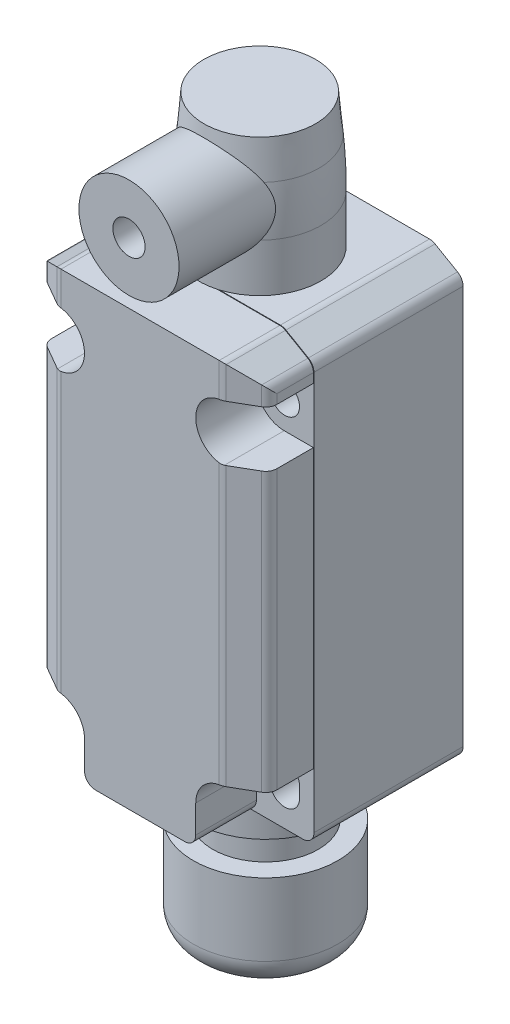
ISO-10303-21;
HEADER;
FILE_DESCRIPTION(('STEP AP214'),'2;1');
FILE_NAME('part.step','',(''),(''),'','','');
FILE_SCHEMA(('AUTOMOTIVE_DESIGN { 1 0 10303 214 1 1 1 1 }'));
ENDSEC;
DATA;
#1=APPLICATION_CONTEXT('core data for automotive mechanical design processes');
#2=APPLICATION_PROTOCOL_DEFINITION('international standard','automotive_design',2000,#1);
#3=PRODUCT_CONTEXT('',#1,'mechanical');
#4=PRODUCT('Part','Part','',(#3));
#5=PRODUCT_RELATED_PRODUCT_CATEGORY('part','',(#4));
#6=PRODUCT_DEFINITION_FORMATION('','',#4);
#7=PRODUCT_DEFINITION_CONTEXT('part definition',#1,'design');
#8=PRODUCT_DEFINITION('design','',#6,#7);
#9=PRODUCT_DEFINITION_SHAPE('','',#8);
#10=(LENGTH_UNIT() NAMED_UNIT(*) SI_UNIT(.MILLI.,.METRE.));
#11=(NAMED_UNIT(*) PLANE_ANGLE_UNIT() SI_UNIT($,.RADIAN.));
#12=(NAMED_UNIT(*) SI_UNIT($,.STERADIAN.) SOLID_ANGLE_UNIT());
#13=UNCERTAINTY_MEASURE_WITH_UNIT(LENGTH_MEASURE(1.E-05),#10,'distance_accuracy_value','');
#14=(GEOMETRIC_REPRESENTATION_CONTEXT(3) GLOBAL_UNCERTAINTY_ASSIGNED_CONTEXT((#13)) GLOBAL_UNIT_ASSIGNED_CONTEXT((#10,
#11,#12)) REPRESENTATION_CONTEXT('',''));
#15=CARTESIAN_POINT('',(0.,0.,0.));
#16=DIRECTION('',(0.,0.,1.));
#17=DIRECTION('',(1.,0.,0.));
#18=AXIS2_PLACEMENT_3D('',#15,#16,#17);
#19=CARTESIAN_POINT('',(-20.5,9.99999999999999,15.));
#20=DIRECTION('',(0.,-1.,0.));
#21=DIRECTION('',(0.,0.,-1.));
#22=AXIS2_PLACEMENT_3D('',#19,#20,#21);
#23=CONICAL_SURFACE('',#22,11.,1.02974425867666);
#24=CARTESIAN_POINT('',(-20.5,16.6094668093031,15.));
#25=VERTEX_POINT('',#24);
#26=VERTEX_LOOP('',#25);
#27=FACE_BOUND('',#26,.T.);
#28=CARTESIAN_POINT('',(-20.5,9.99999999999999,15.));
#29=DIRECTION('',(0.,-1.,0.));
#30=DIRECTION('',(0.,0.,-1.));
#31=AXIS2_PLACEMENT_3D('',#28,#29,#30);
#32=CIRCLE('',#31,11.);
#33=CARTESIAN_POINT('',(-20.5,9.99999999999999,4.00000000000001));
#34=VERTEX_POINT('',#33);
#35=EDGE_CURVE('E202',#34,#34,#32,.T.);
#36=ORIENTED_EDGE('',*,*,#35,.T.);
#37=EDGE_LOOP('',(#36));
#38=FACE_BOUND('',#37,.T.);
#39=ADVANCED_FACE('F47',(#27,#38),#23,.F.);
#40=CARTESIAN_POINT('',(-20.5,0.,15.));
#41=DIRECTION('',(0.,-1.,0.));
#42=DIRECTION('',(0.,0.,-1.));
#43=AXIS2_PLACEMENT_3D('',#40,#41,#42);
#44=CYLINDRICAL_SURFACE('',#43,11.);
#45=ORIENTED_EDGE('',*,*,#35,.F.);
#46=EDGE_LOOP('',(#45));
#47=FACE_BOUND('',#46,.T.);
#48=CARTESIAN_POINT('',(-20.5,0.,15.));
#49=DIRECTION('',(0.,-1.,0.));
#50=DIRECTION('',(1.,0.,0.));
#51=AXIS2_PLACEMENT_3D('',#48,#49,#50);
#52=CIRCLE('',#51,11.);
#53=CARTESIAN_POINT('',(-9.50000000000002,0.,15.));
#54=VERTEX_POINT('',#53);
#55=EDGE_CURVE('E216',#54,#54,#52,.F.);
#56=ORIENTED_EDGE('',*,*,#55,.F.);
#57=EDGE_LOOP('',(#56));
#58=FACE_BOUND('',#57,.T.);
#59=ADVANCED_FACE('F405',(#47,#58),#44,.F.);
#60=CARTESIAN_POINT('',(-20.5,0.,15.));
#61=DIRECTION('',(0.,-1.,0.));
#62=DIRECTION('',(1.,0.,0.));
#63=AXIS2_PLACEMENT_3D('',#60,#61,#62);
#64=PLANE('',#63);
#65=CARTESIAN_POINT('',(-20.5,0.,15.));
#66=DIRECTION('',(0.,-1.,0.));
#67=DIRECTION('',(1.,0.,0.));
#68=AXIS2_PLACEMENT_3D('',#65,#66,#67);
#69=CIRCLE('',#68,4.);
#70=CARTESIAN_POINT('',(-16.5,0.,15.));
#71=VERTEX_POINT('',#70);
#72=EDGE_CURVE('E51',#71,#71,#69,.T.);
#73=ORIENTED_EDGE('',*,*,#72,.T.);
#74=EDGE_LOOP('',(#73));
#75=FACE_BOUND('',#74,.T.);
#76=ORIENTED_EDGE('',*,*,#55,.T.);
#77=EDGE_LOOP('',(#76));
#78=FACE_BOUND('',#77,.T.);
#79=ADVANCED_FACE('F411',(#75,#78),#64,.F.);
#80=CARTESIAN_POINT('',(-20.5,9.,15.));
#81=DIRECTION('',(0.,-1.,0.));
#82=DIRECTION('',(1.,0.,0.));
#83=AXIS2_PLACEMENT_3D('',#80,#81,#82);
#84=CYLINDRICAL_SURFACE('',#83,4.);
#85=CARTESIAN_POINT('',(-20.5,-26.,15.));
#86=DIRECTION('',(0.,-1.,0.));
#87=DIRECTION('',(1.,0.,0.));
#88=AXIS2_PLACEMENT_3D('',#85,#86,#87);
#89=CIRCLE('',#88,4.);
#90=CARTESIAN_POINT('',(-16.5,-26.,15.));
#91=VERTEX_POINT('',#90);
#92=EDGE_CURVE('E790',#91,#91,#89,.T.);
#93=ORIENTED_EDGE('',*,*,#92,.T.);
#94=EDGE_LOOP('',(#93));
#95=FACE_BOUND('',#94,.T.);
#96=ORIENTED_EDGE('',*,*,#72,.F.);
#97=EDGE_LOOP('',(#96));
#98=FACE_BOUND('',#97,.T.);
#99=ADVANCED_FACE('F506',(#95,#98),#84,.F.);
#100=CARTESIAN_POINT('',(0.,0.,37.8));
#101=DIRECTION('',(0.,1.,0.));
#102=DIRECTION('',(-1.,0.,0.));
#103=AXIS2_PLACEMENT_3D('',#100,#101,#102);
#104=PLANE('',#103);
#105=CARTESIAN_POINT('',(-20.5,0.,15.));
#106=DIRECTION('',(0.,-1.,0.));
#107=DIRECTION('',(1.,0.,0.));
#108=AXIS2_PLACEMENT_3D('',#105,#106,#107);
#109=CIRCLE('',#108,13.);
#110=CARTESIAN_POINT('',(-25.9552726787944,0.,26.8));
#111=VERTEX_POINT('',#110);
#112=CARTESIAN_POINT('',(-15.0447273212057,0.,26.8));
#113=VERTEX_POINT('',#112);
#114=EDGE_CURVE('E205',#111,#113,#109,.T.);
#115=ORIENTED_EDGE('',*,*,#114,.F.);
#116=DIRECTION('',(-1.,0.,0.));
#117=VECTOR('',#116,1.);
#118=CARTESIAN_POINT('',(0.,0.,26.8));
#119=LINE('',#118,#117);
#120=CARTESIAN_POINT('',(-38.5,0.,26.8));
#121=VERTEX_POINT('',#120);
#122=EDGE_CURVE('E192',#111,#121,#119,.T.);
#123=ORIENTED_EDGE('',*,*,#122,.T.);
#124=DIRECTION('',(0.,0.,-1.));
#125=VECTOR('',#124,1.);
#126=CARTESIAN_POINT('',(-38.5,0.,37.8));
#127=LINE('',#126,#125);
#128=CARTESIAN_POINT('',(-38.5,0.,0.));
#129=VERTEX_POINT('',#128);
#130=EDGE_CURVE('E246',#121,#129,#127,.T.);
#131=ORIENTED_EDGE('',*,*,#130,.T.);
#132=DIRECTION('',(1.,0.,0.));
#133=VECTOR('',#132,1.);
#134=CARTESIAN_POINT('',(0.,0.,0.));
#135=LINE('',#134,#133);
#136=CARTESIAN_POINT('',(-2.,0.,0.));
#137=VERTEX_POINT('',#136);
#138=EDGE_CURVE('E245',#129,#137,#135,.T.);
#139=ORIENTED_EDGE('',*,*,#138,.T.);
#140=DIRECTION('',(0.,0.,-1.));
#141=VECTOR('',#140,1.);
#142=CARTESIAN_POINT('',(-2.,0.,37.8));
#143=LINE('',#142,#141);
#144=CARTESIAN_POINT('',(-2.,0.,26.8));
#145=VERTEX_POINT('',#144);
#146=EDGE_CURVE('E242',#137,#145,#143,.F.);
#147=ORIENTED_EDGE('',*,*,#146,.T.);
#148=EDGE_CURVE('E201',#145,#113,#119,.T.);
#149=ORIENTED_EDGE('',*,*,#148,.T.);
#150=EDGE_LOOP('',(#115,#123,#131,#139,#147,#149));
#151=FACE_BOUND('',#150,.T.);
#152=ADVANCED_FACE('F206',(#151),#104,.F.);
#153=CARTESIAN_POINT('',(0.,0.,37.8));
#154=DIRECTION('',(-1.,0.,0.));
#155=DIRECTION('',(0.,-1.,0.));
#156=AXIS2_PLACEMENT_3D('',#153,#154,#155);
#157=PLANE('',#156);
#158=DIRECTION('',(0.,0.,-1.));
#159=VECTOR('',#158,1.);
#160=CARTESIAN_POINT('',(0.,73.6698729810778,34.6245735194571));
#161=LINE('',#160,#159);
#162=CARTESIAN_POINT('',(0.,73.6698729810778,0.));
#163=VERTEX_POINT('',#162);
#164=CARTESIAN_POINT('',(0.,73.6698729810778,26.8));
#165=VERTEX_POINT('',#164);
#166=EDGE_CURVE('E244',#163,#165,#161,.F.);
#167=ORIENTED_EDGE('',*,*,#166,.T.);
#168=DIRECTION('',(0.,-1.,0.));
#169=VECTOR('',#168,1.);
#170=CARTESIAN_POINT('',(0.,78.3465892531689,26.8));
#171=LINE('',#170,#169);
#172=CARTESIAN_POINT('',(0.,2.,26.8));
#173=VERTEX_POINT('',#172);
#174=EDGE_CURVE('E267',#165,#173,#171,.T.);
#175=ORIENTED_EDGE('',*,*,#174,.T.);
#176=DIRECTION('',(0.,0.,-1.));
#177=VECTOR('',#176,1.);
#178=CARTESIAN_POINT('',(0.,2.,37.8));
#179=LINE('',#178,#177);
#180=CARTESIAN_POINT('',(0.,2.,0.));
#181=VERTEX_POINT('',#180);
#182=EDGE_CURVE('E263',#173,#181,#179,.T.);
#183=ORIENTED_EDGE('',*,*,#182,.T.);
#184=DIRECTION('',(0.,1.,0.));
#185=VECTOR('',#184,1.);
#186=CARTESIAN_POINT('',(0.,0.,0.));
#187=LINE('',#186,#185);
#188=EDGE_CURVE('E266',#181,#163,#187,.T.);
#189=ORIENTED_EDGE('',*,*,#188,.T.);
#190=EDGE_LOOP('',(#167,#175,#183,#189));
#191=FACE_BOUND('',#190,.T.);
#192=ADVANCED_FACE('F501',(#191),#157,.F.);
#193=CARTESIAN_POINT('',(0.,78.,37.8));
#194=DIRECTION('',(0.,-1.,0.));
#195=DIRECTION('',(1.,0.,0.));
#196=AXIS2_PLACEMENT_3D('',#193,#194,#195);
#197=PLANE('',#196);
#198=DIRECTION('',(0.,0.,-1.));
#199=VECTOR('',#198,1.);
#200=CARTESIAN_POINT('',(-34.4641016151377,78.,37.8));
#201=LINE('',#200,#199);
#202=CARTESIAN_POINT('',(-34.4641016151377,78.,0.));
#203=VERTEX_POINT('',#202);
#204=CARTESIAN_POINT('',(-34.4641016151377,78.,26.8));
#205=VERTEX_POINT('',#204);
#206=EDGE_CURVE('E293',#203,#205,#201,.F.);
#207=ORIENTED_EDGE('',*,*,#206,.T.);
#208=DIRECTION('',(1.,0.,0.));
#209=VECTOR('',#208,1.);
#210=CARTESIAN_POINT('',(0.,78.,26.8));
#211=LINE('',#210,#209);
#212=CARTESIAN_POINT('',(-6.0358983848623,78.,26.8));
#213=VERTEX_POINT('',#212);
#214=EDGE_CURVE('E366',#205,#213,#211,.T.);
#215=ORIENTED_EDGE('',*,*,#214,.T.);
#216=DIRECTION('',(0.,0.,1.));
#217=VECTOR('',#216,1.);
#218=CARTESIAN_POINT('',(-6.0358983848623,78.,0.));
#219=LINE('',#218,#217);
#220=CARTESIAN_POINT('',(-6.0358983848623,78.,0.));
#221=VERTEX_POINT('',#220);
#222=EDGE_CURVE('E290',#213,#221,#219,.F.);
#223=ORIENTED_EDGE('',*,*,#222,.T.);
#224=DIRECTION('',(-1.,0.,0.));
#225=VECTOR('',#224,1.);
#226=CARTESIAN_POINT('',(0.,78.,0.));
#227=LINE('',#226,#225);
#228=EDGE_CURVE('E287',#221,#203,#227,.T.);
#229=ORIENTED_EDGE('',*,*,#228,.T.);
#230=EDGE_LOOP('',(#207,#215,#223,#229));
#231=FACE_BOUND('',#230,.T.);
#232=ADVANCED_FACE('F476',(#231),#197,.F.);
#233=CARTESIAN_POINT('',(-40.5,0.,37.8));
#234=DIRECTION('',(1.,0.,0.));
#235=DIRECTION('',(0.,0.,-1.));
#236=AXIS2_PLACEMENT_3D('',#233,#234,#235);
#237=PLANE('',#236);
#238=DIRECTION('',(0.,0.,-1.));
#239=VECTOR('',#238,1.);
#240=CARTESIAN_POINT('',(-40.5,2.,37.8));
#241=LINE('',#240,#239);
#242=CARTESIAN_POINT('',(-40.5,2.,0.));
#243=VERTEX_POINT('',#242);
#244=CARTESIAN_POINT('',(-40.5,2.,26.8));
#245=VERTEX_POINT('',#244);
#246=EDGE_CURVE('E235',#243,#245,#241,.F.);
#247=ORIENTED_EDGE('',*,*,#246,.T.);
#248=DIRECTION('',(0.,-1.,0.));
#249=VECTOR('',#248,1.);
#250=CARTESIAN_POINT('',(-40.5,72.,26.8));
#251=LINE('',#250,#249);
#252=CARTESIAN_POINT('',(-40.5,73.6698729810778,26.8));
#253=VERTEX_POINT('',#252);
#254=EDGE_CURVE('E71',#253,#245,#251,.T.);
#255=ORIENTED_EDGE('',*,*,#254,.F.);
#256=DIRECTION('',(0.,0.,1.));
#257=VECTOR('',#256,1.);
#258=CARTESIAN_POINT('',(-40.5,73.6698729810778,0.));
#259=LINE('',#258,#257);
#260=CARTESIAN_POINT('',(-40.5,73.6698729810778,0.));
#261=VERTEX_POINT('',#260);
#262=EDGE_CURVE('E286',#253,#261,#259,.F.);
#263=ORIENTED_EDGE('',*,*,#262,.T.);
#264=DIRECTION('',(0.,-1.,0.));
#265=VECTOR('',#264,1.);
#266=CARTESIAN_POINT('',(-40.5,0.,0.));
#267=LINE('',#266,#265);
#268=EDGE_CURVE('E238',#261,#243,#267,.T.);
#269=ORIENTED_EDGE('',*,*,#268,.T.);
#270=EDGE_LOOP('',(#247,#255,#263,#269));
#271=FACE_BOUND('',#270,.T.);
#272=ADVANCED_FACE('F472',(#271),#237,.F.);
#273=CARTESIAN_POINT('',(-5.50000000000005,78.,37.8));
#274=DIRECTION('',(-0.499999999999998,-0.86602540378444,0.));
#275=DIRECTION('',(0.86602540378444,-0.499999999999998,0.));
#276=AXIS2_PLACEMENT_3D('',#273,#274,#275);
#277=PLANE('',#276);
#278=DIRECTION('',(0.86602540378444,-0.499999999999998,0.));
#279=VECTOR('',#278,1.);
#280=CARTESIAN_POINT('',(-5.50000000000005,78.,26.8));
#281=LINE('',#280,#279);
#282=CARTESIAN_POINT('',(-1.,75.4019237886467,26.8));
#283=VERTEX_POINT('',#282);
#284=CARTESIAN_POINT('',(-5.03589838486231,77.7320508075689,26.8));
#285=VERTEX_POINT('',#284);
#286=EDGE_CURVE('E361',#283,#285,#281,.F.);
#287=ORIENTED_EDGE('',*,*,#286,.F.);
#288=DIRECTION('',(0.,0.,1.));
#289=VECTOR('',#288,1.);
#290=CARTESIAN_POINT('',(-1.00000000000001,75.4019237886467,0.));
#291=LINE('',#290,#289);
#292=CARTESIAN_POINT('',(-1.,75.4019237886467,0.));
#293=VERTEX_POINT('',#292);
#294=EDGE_CURVE('E237',#283,#293,#291,.F.);
#295=ORIENTED_EDGE('',*,*,#294,.T.);
#296=DIRECTION('',(-0.86602540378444,0.499999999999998,0.));
#297=VECTOR('',#296,1.);
#298=CARTESIAN_POINT('',(-5.50000000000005,78.,0.));
#299=LINE('',#298,#297);
#300=CARTESIAN_POINT('',(-5.0358983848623,77.7320508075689,0.));
#301=VERTEX_POINT('',#300);
#302=EDGE_CURVE('E256',#301,#293,#299,.F.);
#303=ORIENTED_EDGE('',*,*,#302,.F.);
#304=DIRECTION('',(0.,0.,-1.));
#305=VECTOR('',#304,1.);
#306=CARTESIAN_POINT('',(-5.0358983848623,77.7320508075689,37.8));
#307=LINE('',#306,#305);
#308=EDGE_CURVE('E375',#301,#285,#307,.F.);
#309=ORIENTED_EDGE('',*,*,#308,.T.);
#310=EDGE_LOOP('',(#287,#295,#303,#309));
#311=FACE_BOUND('',#310,.T.);
#312=ADVANCED_FACE('F475',(#311),#277,.F.);
#313=CARTESIAN_POINT('',(-40.5,74.824573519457,37.8));
#314=DIRECTION('',(0.499999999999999,-0.866025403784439,0.));
#315=DIRECTION('',(0.866025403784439,0.499999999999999,0.));
#316=AXIS2_PLACEMENT_3D('',#313,#314,#315);
#317=PLANE('',#316);
#318=DIRECTION('',(0.866025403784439,0.499999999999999,0.));
#319=VECTOR('',#318,1.);
#320=CARTESIAN_POINT('',(-40.5,74.824573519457,26.8));
#321=LINE('',#320,#319);
#322=CARTESIAN_POINT('',(-35.4641016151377,77.7320508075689,26.8));
#323=VERTEX_POINT('',#322);
#324=CARTESIAN_POINT('',(-39.5,75.4019237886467,26.8));
#325=VERTEX_POINT('',#324);
#326=EDGE_CURVE('E230',#323,#325,#321,.F.);
#327=ORIENTED_EDGE('',*,*,#326,.F.);
#328=DIRECTION('',(0.,0.,1.));
#329=VECTOR('',#328,1.);
#330=CARTESIAN_POINT('',(-35.4641016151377,77.7320508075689,0.));
#331=LINE('',#330,#329);
#332=CARTESIAN_POINT('',(-35.4641016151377,77.7320508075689,0.));
#333=VERTEX_POINT('',#332);
#334=EDGE_CURVE('E373',#323,#333,#331,.F.);
#335=ORIENTED_EDGE('',*,*,#334,.T.);
#336=DIRECTION('',(-0.866025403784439,-0.499999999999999,0.));
#337=VECTOR('',#336,1.);
#338=CARTESIAN_POINT('',(-40.5,74.824573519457,0.));
#339=LINE('',#338,#337);
#340=CARTESIAN_POINT('',(-39.5,75.4019237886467,0.));
#341=VERTEX_POINT('',#340);
#342=EDGE_CURVE('E261',#341,#333,#339,.F.);
#343=ORIENTED_EDGE('',*,*,#342,.F.);
#344=DIRECTION('',(0.,0.,-1.));
#345=VECTOR('',#344,1.);
#346=CARTESIAN_POINT('',(-39.5,75.4019237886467,34.6245735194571));
#347=LINE('',#346,#345);
#348=EDGE_CURVE('E337',#341,#325,#347,.F.);
#349=ORIENTED_EDGE('',*,*,#348,.T.);
#350=EDGE_LOOP('',(#327,#335,#343,#349));
#351=FACE_BOUND('',#350,.T.);
#352=ADVANCED_FACE('F485',(#351),#317,.F.);
#353=CARTESIAN_POINT('',(-6.0358983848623,76.,37.8));
#354=DIRECTION('',(0.,0.,-1.));
#355=DIRECTION('',(-1.,0.,0.));
#356=AXIS2_PLACEMENT_3D('',#353,#354,#355);
#357=CYLINDRICAL_SURFACE('',#356,2.);
#358=CARTESIAN_POINT('',(-6.0358983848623,76.,26.8));
#359=DIRECTION('',(0.,0.,-1.));
#360=DIRECTION('',(0.,1.,0.));
#361=AXIS2_PLACEMENT_3D('',#358,#359,#360);
#362=CIRCLE('',#361,2.);
#363=EDGE_CURVE('E231',#285,#213,#362,.F.);
#364=ORIENTED_EDGE('',*,*,#363,.F.);
#365=ORIENTED_EDGE('',*,*,#308,.F.);
#366=CARTESIAN_POINT('',(-6.0358983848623,76.,0.));
#367=DIRECTION('',(0.,0.,1.));
#368=DIRECTION('',(1.,0.,0.));
#369=AXIS2_PLACEMENT_3D('',#366,#367,#368);
#370=CIRCLE('',#369,2.);
#371=EDGE_CURVE('E257',#221,#301,#370,.F.);
#372=ORIENTED_EDGE('',*,*,#371,.F.);
#373=ORIENTED_EDGE('',*,*,#222,.F.);
#374=EDGE_LOOP('',(#364,#365,#372,#373));
#375=FACE_BOUND('',#374,.T.);
#376=ADVANCED_FACE('F488',(#375),#357,.T.);
#377=CARTESIAN_POINT('',(-2.00000000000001,73.6698729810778,37.8));
#378=DIRECTION('',(0.,0.,1.));
#379=DIRECTION('',(1.,0.,0.));
#380=AXIS2_PLACEMENT_3D('',#377,#378,#379);
#381=CYLINDRICAL_SURFACE('',#380,2.);
#382=CARTESIAN_POINT('',(-2.00000000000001,73.6698729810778,26.8));
#383=DIRECTION('',(0.,0.,-1.));
#384=DIRECTION('',(0.,1.,0.));
#385=AXIS2_PLACEMENT_3D('',#382,#383,#384);
#386=CIRCLE('',#385,2.);
#387=EDGE_CURVE('E274',#165,#283,#386,.F.);
#388=ORIENTED_EDGE('',*,*,#387,.F.);
#389=ORIENTED_EDGE('',*,*,#166,.F.);
#390=CARTESIAN_POINT('',(-2.00000000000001,73.6698729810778,0.));
#391=DIRECTION('',(0.,0.,1.));
#392=DIRECTION('',(1.,0.,0.));
#393=AXIS2_PLACEMENT_3D('',#390,#391,#392);
#394=CIRCLE('',#393,2.);
#395=EDGE_CURVE('E254',#293,#163,#394,.F.);
#396=ORIENTED_EDGE('',*,*,#395,.F.);
#397=ORIENTED_EDGE('',*,*,#294,.F.);
#398=EDGE_LOOP('',(#388,#389,#396,#397));
#399=FACE_BOUND('',#398,.T.);
#400=ADVANCED_FACE('F483',(#399),#381,.T.);
#401=CARTESIAN_POINT('',(-38.5,73.6698729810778,37.8));
#402=DIRECTION('',(0.,0.,-1.));
#403=DIRECTION('',(-1.,0.,0.));
#404=AXIS2_PLACEMENT_3D('',#401,#402,#403);
#405=CYLINDRICAL_SURFACE('',#404,2.);
#406=CARTESIAN_POINT('',(-38.5,73.6698729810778,26.8));
#407=DIRECTION('',(0.,0.,-1.));
#408=DIRECTION('',(0.,1.,0.));
#409=AXIS2_PLACEMENT_3D('',#406,#407,#408);
#410=CIRCLE('',#409,2.);
#411=EDGE_CURVE('E364',#325,#253,#410,.F.);
#412=ORIENTED_EDGE('',*,*,#411,.F.);
#413=ORIENTED_EDGE('',*,*,#348,.F.);
#414=CARTESIAN_POINT('',(-38.5,73.6698729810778,0.));
#415=DIRECTION('',(0.,0.,1.));
#416=DIRECTION('',(1.,0.,0.));
#417=AXIS2_PLACEMENT_3D('',#414,#415,#416);
#418=CIRCLE('',#417,2.);
#419=EDGE_CURVE('E253',#261,#341,#418,.F.);
#420=ORIENTED_EDGE('',*,*,#419,.F.);
#421=ORIENTED_EDGE('',*,*,#262,.F.);
#422=EDGE_LOOP('',(#412,#413,#420,#421));
#423=FACE_BOUND('',#422,.T.);
#424=ADVANCED_FACE('F479',(#423),#405,.T.);
#425=CARTESIAN_POINT('',(-34.4641016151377,76.,37.8));
#426=DIRECTION('',(0.,0.,1.));
#427=DIRECTION('',(1.,0.,0.));
#428=AXIS2_PLACEMENT_3D('',#425,#426,#427);
#429=CYLINDRICAL_SURFACE('',#428,2.);
#430=CARTESIAN_POINT('',(-34.4641016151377,76.,26.8));
#431=DIRECTION('',(0.,0.,-1.));
#432=DIRECTION('',(0.,1.,0.));
#433=AXIS2_PLACEMENT_3D('',#430,#431,#432);
#434=CIRCLE('',#433,2.);
#435=EDGE_CURVE('E228',#205,#323,#434,.F.);
#436=ORIENTED_EDGE('',*,*,#435,.F.);
#437=ORIENTED_EDGE('',*,*,#206,.F.);
#438=CARTESIAN_POINT('',(-34.4641016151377,76.,0.));
#439=DIRECTION('',(0.,0.,1.));
#440=DIRECTION('',(1.,0.,0.));
#441=AXIS2_PLACEMENT_3D('',#438,#439,#440);
#442=CIRCLE('',#441,2.);
#443=EDGE_CURVE('E259',#333,#203,#442,.F.);
#444=ORIENTED_EDGE('',*,*,#443,.F.);
#445=ORIENTED_EDGE('',*,*,#334,.F.);
#446=EDGE_LOOP('',(#436,#437,#444,#445));
#447=FACE_BOUND('',#446,.T.);
#448=ADVANCED_FACE('F454',(#447),#429,.T.);
#449=CARTESIAN_POINT('',(-35.25,6.99999999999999,0.));
#450=DIRECTION('',(0.,0.,1.));
#451=DIRECTION('',(1.,0.,0.));
#452=AXIS2_PLACEMENT_3D('',#449,#450,#451);
#453=CYLINDRICAL_SURFACE('',#452,2.65);
#454=CARTESIAN_POINT('',(-35.25,6.99999999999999,0.));
#455=DIRECTION('',(0.,0.,1.));
#456=DIRECTION('',(1.,0.,0.));
#457=AXIS2_PLACEMENT_3D('',#454,#455,#456);
#458=CIRCLE('',#457,2.65);
#459=CARTESIAN_POINT('',(-32.6,6.99999999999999,0.));
#460=VERTEX_POINT('',#459);
#461=EDGE_CURVE('E315',#460,#460,#458,.T.);
#462=ORIENTED_EDGE('',*,*,#461,.F.);
#463=EDGE_LOOP('',(#462));
#464=FACE_BOUND('',#463,.T.);
#465=CARTESIAN_POINT('',(-35.25,6.99999999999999,26.8));
#466=DIRECTION('',(0.,0.,1.));
#467=DIRECTION('',(1.,0.,0.));
#468=AXIS2_PLACEMENT_3D('',#465,#466,#467);
#469=CIRCLE('',#468,2.65);
#470=CARTESIAN_POINT('',(-32.6,6.99999999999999,26.8));
#471=VERTEX_POINT('',#470);
#472=EDGE_CURVE('E233',#471,#471,#469,.F.);
#473=ORIENTED_EDGE('',*,*,#472,.F.);
#474=EDGE_LOOP('',(#473));
#475=FACE_BOUND('',#474,.T.);
#476=ADVANCED_FACE('F450',(#464,#475),#453,.F.);
#477=CARTESIAN_POINT('',(-5.25,7.99999999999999,0.));
#478=DIRECTION('',(0.,0.,1.));
#479=DIRECTION('',(1.,0.,0.));
#480=AXIS2_PLACEMENT_3D('',#477,#478,#479);
#481=CYLINDRICAL_SURFACE('',#480,2.65);
#482=CARTESIAN_POINT('',(-5.25,7.99999999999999,26.8));
#483=DIRECTION('',(0.,0.,1.));
#484=DIRECTION('',(1.,0.,0.));
#485=AXIS2_PLACEMENT_3D('',#482,#483,#484);
#486=CIRCLE('',#485,2.65);
#487=CARTESIAN_POINT('',(-7.9,8.00000000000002,26.8));
#488=VERTEX_POINT('',#487);
#489=CARTESIAN_POINT('',(-2.6,7.99999999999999,26.8));
#490=VERTEX_POINT('',#489);
#491=EDGE_CURVE('E357',#488,#490,#486,.F.);
#492=ORIENTED_EDGE('',*,*,#491,.F.);
#493=DIRECTION('',(0.,0.,1.));
#494=VECTOR('',#493,1.);
#495=CARTESIAN_POINT('',(-7.9,8.00000000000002,0.));
#496=LINE('',#495,#494);
#497=CARTESIAN_POINT('',(-7.9,8.00000000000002,0.));
#498=VERTEX_POINT('',#497);
#499=EDGE_CURVE('E310',#498,#488,#496,.T.);
#500=ORIENTED_EDGE('',*,*,#499,.F.);
#501=CARTESIAN_POINT('',(-5.25,7.99999999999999,0.));
#502=DIRECTION('',(0.,0.,1.));
#503=DIRECTION('',(1.,0.,0.));
#504=AXIS2_PLACEMENT_3D('',#501,#502,#503);
#505=CIRCLE('',#504,2.65);
#506=CARTESIAN_POINT('',(-2.6,7.99999999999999,0.));
#507=VERTEX_POINT('',#506);
#508=EDGE_CURVE('E340',#507,#498,#505,.T.);
#509=ORIENTED_EDGE('',*,*,#508,.F.);
#510=DIRECTION('',(0.,0.,1.));
#511=VECTOR('',#510,1.);
#512=CARTESIAN_POINT('',(-2.6,7.99999999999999,0.));
#513=LINE('',#512,#511);
#514=EDGE_CURVE('E334',#507,#490,#513,.T.);
#515=ORIENTED_EDGE('',*,*,#514,.T.);
#516=EDGE_LOOP('',(#492,#500,#509,#515));
#517=FACE_BOUND('',#516,.T.);
#518=ADVANCED_FACE('F453',(#517),#481,.F.);
#519=CARTESIAN_POINT('',(-2.6,7.99999999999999,0.));
#520=DIRECTION('',(1.,0.,0.));
#521=DIRECTION('',(0.,0.,-1.));
#522=AXIS2_PLACEMENT_3D('',#519,#520,#521);
#523=PLANE('',#522);
#524=DIRECTION('',(0.,-1.,0.));
#525=VECTOR('',#524,1.);
#526=CARTESIAN_POINT('',(-2.6,0.,26.8));
#527=LINE('',#526,#525);
#528=CARTESIAN_POINT('',(-2.6,5.99999999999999,26.8));
#529=VERTEX_POINT('',#528);
#530=EDGE_CURVE('E355',#490,#529,#527,.T.);
#531=ORIENTED_EDGE('',*,*,#530,.F.);
#532=ORIENTED_EDGE('',*,*,#514,.F.);
#533=DIRECTION('',(0.,1.,0.));
#534=VECTOR('',#533,1.);
#535=CARTESIAN_POINT('',(-2.6,7.99999999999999,0.));
#536=LINE('',#535,#534);
#537=CARTESIAN_POINT('',(-2.6,6.,0.));
#538=VERTEX_POINT('',#537);
#539=EDGE_CURVE('E300',#538,#507,#536,.T.);
#540=ORIENTED_EDGE('',*,*,#539,.F.);
#541=DIRECTION('',(0.,0.,1.));
#542=VECTOR('',#541,1.);
#543=CARTESIAN_POINT('',(-2.6,6.,0.));
#544=LINE('',#543,#542);
#545=EDGE_CURVE('E331',#538,#529,#544,.T.);
#546=ORIENTED_EDGE('',*,*,#545,.T.);
#547=EDGE_LOOP('',(#531,#532,#540,#546));
#548=FACE_BOUND('',#547,.T.);
#549=ADVANCED_FACE('F458',(#548),#523,.F.);
#550=CARTESIAN_POINT('',(-5.25,5.99999999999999,0.));
#551=DIRECTION('',(0.,0.,1.));
#552=DIRECTION('',(1.,0.,0.));
#553=AXIS2_PLACEMENT_3D('',#550,#551,#552);
#554=CYLINDRICAL_SURFACE('',#553,2.65);
#555=CARTESIAN_POINT('',(-5.25,5.99999999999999,26.8));
#556=DIRECTION('',(0.,0.,1.));
#557=DIRECTION('',(1.,0.,0.));
#558=AXIS2_PLACEMENT_3D('',#555,#556,#557);
#559=CIRCLE('',#558,2.65);
#560=CARTESIAN_POINT('',(-7.9,5.99999999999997,26.8));
#561=VERTEX_POINT('',#560);
#562=EDGE_CURVE('E241',#529,#561,#559,.F.);
#563=ORIENTED_EDGE('',*,*,#562,.F.);
#564=ORIENTED_EDGE('',*,*,#545,.F.);
#565=CARTESIAN_POINT('',(-5.25,5.99999999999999,0.));
#566=DIRECTION('',(0.,0.,1.));
#567=DIRECTION('',(1.,0.,0.));
#568=AXIS2_PLACEMENT_3D('',#565,#566,#567);
#569=CIRCLE('',#568,2.65);
#570=CARTESIAN_POINT('',(-7.9,5.99999999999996,0.));
#571=VERTEX_POINT('',#570);
#572=EDGE_CURVE('E325',#571,#538,#569,.T.);
#573=ORIENTED_EDGE('',*,*,#572,.F.);
#574=DIRECTION('',(0.,0.,1.));
#575=VECTOR('',#574,1.);
#576=CARTESIAN_POINT('',(-7.9,5.99999999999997,0.));
#577=LINE('',#576,#575);
#578=EDGE_CURVE('E328',#571,#561,#577,.T.);
#579=ORIENTED_EDGE('',*,*,#578,.T.);
#580=EDGE_LOOP('',(#563,#564,#573,#579));
#581=FACE_BOUND('',#580,.T.);
#582=ADVANCED_FACE('F462',(#581),#554,.F.);
#583=CARTESIAN_POINT('',(-7.9,8.00000000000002,0.));
#584=DIRECTION('',(-1.,0.,0.));
#585=DIRECTION('',(0.,0.,1.));
#586=AXIS2_PLACEMENT_3D('',#583,#584,#585);
#587=PLANE('',#586);
#588=DIRECTION('',(0.,1.,0.));
#589=VECTOR('',#588,1.);
#590=CARTESIAN_POINT('',(-7.9,0.,26.8));
#591=LINE('',#590,#589);
#592=EDGE_CURVE('E278',#561,#488,#591,.T.);
#593=ORIENTED_EDGE('',*,*,#592,.F.);
#594=ORIENTED_EDGE('',*,*,#578,.F.);
#595=DIRECTION('',(0.,-1.,0.));
#596=VECTOR('',#595,1.);
#597=CARTESIAN_POINT('',(-7.9,8.00000000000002,0.));
#598=LINE('',#597,#596);
#599=EDGE_CURVE('E343',#498,#571,#598,.T.);
#600=ORIENTED_EDGE('',*,*,#599,.F.);
#601=ORIENTED_EDGE('',*,*,#499,.T.);
#602=EDGE_LOOP('',(#593,#594,#600,#601));
#603=FACE_BOUND('',#602,.T.);
#604=ADVANCED_FACE('F434',(#603),#587,.F.);
#605=CARTESIAN_POINT('',(-5.25000000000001,67.,0.));
#606=DIRECTION('',(0.,0.,1.));
#607=DIRECTION('',(1.,0.,0.));
#608=AXIS2_PLACEMENT_3D('',#605,#606,#607);
#609=CYLINDRICAL_SURFACE('',#608,2.65);
#610=CARTESIAN_POINT('',(-5.25000000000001,67.,0.));
#611=DIRECTION('',(0.,0.,1.));
#612=DIRECTION('',(1.,0.,0.));
#613=AXIS2_PLACEMENT_3D('',#610,#611,#612);
#614=CIRCLE('',#613,2.65);
#615=CARTESIAN_POINT('',(-2.60000000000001,67.,0.));
#616=VERTEX_POINT('',#615);
#617=EDGE_CURVE('E251',#616,#616,#614,.T.);
#618=ORIENTED_EDGE('',*,*,#617,.F.);
#619=EDGE_LOOP('',(#618));
#620=FACE_BOUND('',#619,.T.);
#621=CARTESIAN_POINT('',(-5.25000000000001,67.,26.8));
#622=DIRECTION('',(0.,0.,1.));
#623=DIRECTION('',(1.,0.,0.));
#624=AXIS2_PLACEMENT_3D('',#621,#622,#623);
#625=CIRCLE('',#624,2.65);
#626=CARTESIAN_POINT('',(-2.60000000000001,67.,26.8));
#627=VERTEX_POINT('',#626);
#628=EDGE_CURVE('E275',#627,#627,#625,.F.);
#629=ORIENTED_EDGE('',*,*,#628,.F.);
#630=EDGE_LOOP('',(#629));
#631=FACE_BOUND('',#630,.T.);
#632=ADVANCED_FACE('F430',(#620,#631),#609,.F.);
#633=CARTESIAN_POINT('',(-35.25,68.,0.));
#634=DIRECTION('',(0.,0.,1.));
#635=DIRECTION('',(1.,0.,0.));
#636=AXIS2_PLACEMENT_3D('',#633,#634,#635);
#637=CYLINDRICAL_SURFACE('',#636,2.64999999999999);
#638=CARTESIAN_POINT('',(-35.25,68.,26.8));
#639=DIRECTION('',(0.,0.,1.));
#640=DIRECTION('',(1.,0.,0.));
#641=AXIS2_PLACEMENT_3D('',#638,#639,#640);
#642=CIRCLE('',#641,2.64999999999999);
#643=CARTESIAN_POINT('',(-37.9,68.,26.8));
#644=VERTEX_POINT('',#643);
#645=CARTESIAN_POINT('',(-32.6,68.,26.8));
#646=VERTEX_POINT('',#645);
#647=EDGE_CURVE('E348',#644,#646,#642,.F.);
#648=ORIENTED_EDGE('',*,*,#647,.F.);
#649=DIRECTION('',(0.,0.,1.));
#650=VECTOR('',#649,1.);
#651=CARTESIAN_POINT('',(-37.9,68.,0.));
#652=LINE('',#651,#650);
#653=CARTESIAN_POINT('',(-37.9,68.,0.));
#654=VERTEX_POINT('',#653);
#655=EDGE_CURVE('E297',#654,#644,#652,.T.);
#656=ORIENTED_EDGE('',*,*,#655,.F.);
#657=CARTESIAN_POINT('',(-35.25,68.,0.));
#658=DIRECTION('',(0.,0.,1.));
#659=DIRECTION('',(1.,0.,0.));
#660=AXIS2_PLACEMENT_3D('',#657,#658,#659);
#661=CIRCLE('',#660,2.64999999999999);
#662=CARTESIAN_POINT('',(-32.6,68.,0.));
#663=VERTEX_POINT('',#662);
#664=EDGE_CURVE('E314',#663,#654,#661,.T.);
#665=ORIENTED_EDGE('',*,*,#664,.F.);
#666=DIRECTION('',(0.,0.,1.));
#667=VECTOR('',#666,1.);
#668=CARTESIAN_POINT('',(-32.6,68.,0.));
#669=LINE('',#668,#667);
#670=EDGE_CURVE('E307',#663,#646,#669,.T.);
#671=ORIENTED_EDGE('',*,*,#670,.T.);
#672=EDGE_LOOP('',(#648,#656,#665,#671));
#673=FACE_BOUND('',#672,.T.);
#674=ADVANCED_FACE('F433',(#673),#637,.F.);
#675=CARTESIAN_POINT('',(-32.6,68.,0.));
#676=DIRECTION('',(1.,0.,0.));
#677=DIRECTION('',(0.,0.,-1.));
#678=AXIS2_PLACEMENT_3D('',#675,#676,#677);
#679=PLANE('',#678);
#680=DIRECTION('',(0.,-1.,0.));
#681=VECTOR('',#680,1.);
#682=CARTESIAN_POINT('',(-32.6,68.,26.8));
#683=LINE('',#682,#681);
#684=CARTESIAN_POINT('',(-32.6,66.,26.8));
#685=VERTEX_POINT('',#684);
#686=EDGE_CURVE('E350',#646,#685,#683,.T.);
#687=ORIENTED_EDGE('',*,*,#686,.F.);
#688=ORIENTED_EDGE('',*,*,#670,.F.);
#689=DIRECTION('',(0.,1.,0.));
#690=VECTOR('',#689,1.);
#691=CARTESIAN_POINT('',(-32.6,68.,0.));
#692=LINE('',#691,#690);
#693=CARTESIAN_POINT('',(-32.6,66.,0.));
#694=VERTEX_POINT('',#693);
#695=EDGE_CURVE('E311',#694,#663,#692,.T.);
#696=ORIENTED_EDGE('',*,*,#695,.F.);
#697=DIRECTION('',(0.,0.,1.));
#698=VECTOR('',#697,1.);
#699=CARTESIAN_POINT('',(-32.6,66.,0.));
#700=LINE('',#699,#698);
#701=EDGE_CURVE('E304',#694,#685,#700,.T.);
#702=ORIENTED_EDGE('',*,*,#701,.T.);
#703=EDGE_LOOP('',(#687,#688,#696,#702));
#704=FACE_BOUND('',#703,.T.);
#705=ADVANCED_FACE('F438',(#704),#679,.F.);
#706=CARTESIAN_POINT('',(-35.25,66.,0.));
#707=DIRECTION('',(0.,0.,1.));
#708=DIRECTION('',(1.,0.,0.));
#709=AXIS2_PLACEMENT_3D('',#706,#707,#708);
#710=CYLINDRICAL_SURFACE('',#709,2.64999999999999);
#711=CARTESIAN_POINT('',(-35.25,66.,26.8));
#712=DIRECTION('',(0.,0.,1.));
#713=DIRECTION('',(1.,0.,0.));
#714=AXIS2_PLACEMENT_3D('',#711,#712,#713);
#715=CIRCLE('',#714,2.64999999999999);
#716=CARTESIAN_POINT('',(-37.9,66.,26.8));
#717=VERTEX_POINT('',#716);
#718=EDGE_CURVE('E281',#685,#717,#715,.F.);
#719=ORIENTED_EDGE('',*,*,#718,.F.);
#720=ORIENTED_EDGE('',*,*,#701,.F.);
#721=CARTESIAN_POINT('',(-35.25,66.,0.));
#722=DIRECTION('',(0.,0.,1.));
#723=DIRECTION('',(1.,0.,0.));
#724=AXIS2_PLACEMENT_3D('',#721,#722,#723);
#725=CIRCLE('',#724,2.64999999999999);
#726=CARTESIAN_POINT('',(-37.9,66.,0.));
#727=VERTEX_POINT('',#726);
#728=EDGE_CURVE('E296',#727,#694,#725,.T.);
#729=ORIENTED_EDGE('',*,*,#728,.F.);
#730=DIRECTION('',(0.,0.,1.));
#731=VECTOR('',#730,1.);
#732=CARTESIAN_POINT('',(-37.9,66.,0.));
#733=LINE('',#732,#731);
#734=EDGE_CURVE('E301',#727,#717,#733,.T.);
#735=ORIENTED_EDGE('',*,*,#734,.T.);
#736=EDGE_LOOP('',(#719,#720,#729,#735));
#737=FACE_BOUND('',#736,.T.);
#738=ADVANCED_FACE('F442',(#737),#710,.F.);
#739=CARTESIAN_POINT('',(-37.9,68.,0.));
#740=DIRECTION('',(-1.,0.,0.));
#741=DIRECTION('',(0.,0.,1.));
#742=AXIS2_PLACEMENT_3D('',#739,#740,#741);
#743=PLANE('',#742);
#744=DIRECTION('',(0.,1.,0.));
#745=VECTOR('',#744,1.);
#746=CARTESIAN_POINT('',(-37.9,68.,26.8));
#747=LINE('',#746,#745);
#748=EDGE_CURVE('E279',#717,#644,#747,.T.);
#749=ORIENTED_EDGE('',*,*,#748,.F.);
#750=ORIENTED_EDGE('',*,*,#734,.F.);
#751=DIRECTION('',(0.,-1.,0.));
#752=VECTOR('',#751,1.);
#753=CARTESIAN_POINT('',(-37.9,68.,0.));
#754=LINE('',#753,#752);
#755=EDGE_CURVE('E318',#654,#727,#754,.T.);
#756=ORIENTED_EDGE('',*,*,#755,.F.);
#757=ORIENTED_EDGE('',*,*,#655,.T.);
#758=EDGE_LOOP('',(#749,#750,#756,#757));
#759=FACE_BOUND('',#758,.T.);
#760=ADVANCED_FACE('F428',(#759),#743,.F.);
#761=CARTESIAN_POINT('',(0.,78.,0.));
#762=DIRECTION('',(0.,0.,1.));
#763=DIRECTION('',(1.,0.,0.));
#764=AXIS2_PLACEMENT_3D('',#761,#762,#763);
#765=PLANE('',#764);
#766=ORIENTED_EDGE('',*,*,#539,.T.);
#767=ORIENTED_EDGE('',*,*,#508,.T.);
#768=ORIENTED_EDGE('',*,*,#599,.T.);
#769=ORIENTED_EDGE('',*,*,#572,.T.);
#770=EDGE_LOOP('',(#766,#767,#768,#769));
#771=FACE_BOUND('',#770,.T.);
#772=ORIENTED_EDGE('',*,*,#461,.T.);
#773=EDGE_LOOP('',(#772));
#774=FACE_BOUND('',#773,.T.);
#775=ORIENTED_EDGE('',*,*,#695,.T.);
#776=ORIENTED_EDGE('',*,*,#664,.T.);
#777=ORIENTED_EDGE('',*,*,#755,.T.);
#778=ORIENTED_EDGE('',*,*,#728,.T.);
#779=EDGE_LOOP('',(#775,#776,#777,#778));
#780=FACE_BOUND('',#779,.T.);
#781=ORIENTED_EDGE('',*,*,#617,.T.);
#782=EDGE_LOOP('',(#781));
#783=FACE_BOUND('',#782,.T.);
#784=ORIENTED_EDGE('',*,*,#188,.F.);
#785=CARTESIAN_POINT('',(-2.,2.,0.));
#786=DIRECTION('',(0.,0.,1.));
#787=DIRECTION('',(1.,0.,0.));
#788=AXIS2_PLACEMENT_3D('',#785,#786,#787);
#789=CIRCLE('',#788,2.);
#790=EDGE_CURVE('E248',#181,#137,#789,.F.);
#791=ORIENTED_EDGE('',*,*,#790,.T.);
#792=ORIENTED_EDGE('',*,*,#138,.F.);
#793=CARTESIAN_POINT('',(-38.5,2.,0.));
#794=DIRECTION('',(0.,0.,1.));
#795=DIRECTION('',(1.,0.,0.));
#796=AXIS2_PLACEMENT_3D('',#793,#794,#795);
#797=CIRCLE('',#796,2.);
#798=EDGE_CURVE('E250',#129,#243,#797,.F.);
#799=ORIENTED_EDGE('',*,*,#798,.T.);
#800=ORIENTED_EDGE('',*,*,#268,.F.);
#801=ORIENTED_EDGE('',*,*,#419,.T.);
#802=ORIENTED_EDGE('',*,*,#342,.T.);
#803=ORIENTED_EDGE('',*,*,#443,.T.);
#804=ORIENTED_EDGE('',*,*,#228,.F.);
#805=ORIENTED_EDGE('',*,*,#371,.T.);
#806=ORIENTED_EDGE('',*,*,#302,.T.);
#807=ORIENTED_EDGE('',*,*,#395,.T.);
#808=EDGE_LOOP('',(#784,#791,#792,#799,#800,#801,#802,#803,#804,#805,#806,#807));
#809=FACE_BOUND('',#808,.T.);
#810=ADVANCED_FACE('F425',(#771,#774,#780,#783,#809),#765,.F.);
#811=CARTESIAN_POINT('',(-35.25,67.,26.8));
#812=DIRECTION('',(0.,0.,1.));
#813=DIRECTION('',(1.,0.,0.));
#814=AXIS2_PLACEMENT_3D('',#811,#812,#813);
#815=PLANE('',#814);
#816=ORIENTED_EDGE('',*,*,#254,.T.);
#817=CARTESIAN_POINT('',(-38.5,2.,26.8));
#818=DIRECTION('',(0.,0.,1.));
#819=DIRECTION('',(1.,0.,0.));
#820=AXIS2_PLACEMENT_3D('',#817,#818,#819);
#821=CIRCLE('',#820,2.);
#822=EDGE_CURVE('E197',#245,#121,#821,.T.);
#823=ORIENTED_EDGE('',*,*,#822,.T.);
#824=ORIENTED_EDGE('',*,*,#122,.F.);
#825=DIRECTION('',(1.,0.,0.));
#826=VECTOR('',#825,1.);
#827=CARTESIAN_POINT('',(-35.25,0.,26.8));
#828=LINE('',#827,#826);
#829=EDGE_CURVE('E63',#111,#113,#828,.T.);
#830=ORIENTED_EDGE('',*,*,#829,.T.);
#831=ORIENTED_EDGE('',*,*,#148,.F.);
#832=CARTESIAN_POINT('',(-2.,2.,26.8));
#833=DIRECTION('',(0.,0.,1.));
#834=DIRECTION('',(1.,0.,0.));
#835=AXIS2_PLACEMENT_3D('',#832,#833,#834);
#836=CIRCLE('',#835,2.);
#837=EDGE_CURVE('E234',#145,#173,#836,.T.);
#838=ORIENTED_EDGE('',*,*,#837,.T.);
#839=ORIENTED_EDGE('',*,*,#174,.F.);
#840=ORIENTED_EDGE('',*,*,#387,.T.);
#841=ORIENTED_EDGE('',*,*,#286,.T.);
#842=ORIENTED_EDGE('',*,*,#363,.T.);
#843=ORIENTED_EDGE('',*,*,#214,.F.);
#844=ORIENTED_EDGE('',*,*,#435,.T.);
#845=ORIENTED_EDGE('',*,*,#326,.T.);
#846=ORIENTED_EDGE('',*,*,#411,.T.);
#847=EDGE_LOOP('',(#816,#823,#824,#830,#831,#838,#839,#840,#841,#842,#843,#844,#845,#846));
#848=FACE_BOUND('',#847,.T.);
#849=ORIENTED_EDGE('',*,*,#647,.T.);
#850=ORIENTED_EDGE('',*,*,#686,.T.);
#851=ORIENTED_EDGE('',*,*,#718,.T.);
#852=ORIENTED_EDGE('',*,*,#748,.T.);
#853=EDGE_LOOP('',(#849,#850,#851,#852));
#854=FACE_BOUND('',#853,.T.);
#855=ORIENTED_EDGE('',*,*,#628,.T.);
#856=EDGE_LOOP('',(#855));
#857=FACE_BOUND('',#856,.T.);
#858=ORIENTED_EDGE('',*,*,#592,.T.);
#859=ORIENTED_EDGE('',*,*,#491,.T.);
#860=ORIENTED_EDGE('',*,*,#530,.T.);
#861=ORIENTED_EDGE('',*,*,#562,.T.);
#862=EDGE_LOOP('',(#858,#859,#860,#861));
#863=FACE_BOUND('',#862,.T.);
#864=ORIENTED_EDGE('',*,*,#472,.T.);
#865=EDGE_LOOP('',(#864));
#866=FACE_BOUND('',#865,.T.);
#867=ADVANCED_FACE('F194',(#848,#854,#857,#863,#866),#815,.T.);
#868=CARTESIAN_POINT('',(-2.,2.,37.8));
#869=DIRECTION('',(0.,0.,-1.));
#870=DIRECTION('',(-1.,0.,0.));
#871=AXIS2_PLACEMENT_3D('',#868,#869,#870);
#872=CYLINDRICAL_SURFACE('',#871,2.);
#873=ORIENTED_EDGE('',*,*,#837,.F.);
#874=ORIENTED_EDGE('',*,*,#146,.F.);
#875=ORIENTED_EDGE('',*,*,#790,.F.);
#876=ORIENTED_EDGE('',*,*,#182,.F.);
#877=EDGE_LOOP('',(#873,#874,#875,#876));
#878=FACE_BOUND('',#877,.T.);
#879=ADVANCED_FACE('F420',(#878),#872,.T.);
#880=CARTESIAN_POINT('',(-38.5,2.,37.8));
#881=DIRECTION('',(0.,0.,-1.));
#882=DIRECTION('',(-1.,0.,0.));
#883=AXIS2_PLACEMENT_3D('',#880,#881,#882);
#884=CYLINDRICAL_SURFACE('',#883,2.);
#885=ORIENTED_EDGE('',*,*,#822,.F.);
#886=ORIENTED_EDGE('',*,*,#246,.F.);
#887=ORIENTED_EDGE('',*,*,#798,.F.);
#888=ORIENTED_EDGE('',*,*,#130,.F.);
#889=EDGE_LOOP('',(#885,#886,#887,#888));
#890=FACE_BOUND('',#889,.T.);
#891=ADVANCED_FACE('F417',(#890),#884,.T.);
#892=CARTESIAN_POINT('',(-20.5,-6.,15.));
#893=DIRECTION('',(0.,1.,0.));
#894=DIRECTION('',(-1.,0.,0.));
#895=AXIS2_PLACEMENT_3D('',#892,#893,#894);
#896=CYLINDRICAL_SURFACE('',#895,13.);
#897=CARTESIAN_POINT('',(-20.5,-6.,15.));
#898=DIRECTION('',(0.,-1.,0.));
#899=DIRECTION('',(1.,0.,0.));
#900=AXIS2_PLACEMENT_3D('',#897,#898,#899);
#901=CIRCLE('',#900,13.);
#902=CARTESIAN_POINT('',(-7.50000000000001,-6.,15.));
#903=VERTEX_POINT('',#902);
#904=EDGE_CURVE('E219',#903,#903,#901,.T.);
#905=ORIENTED_EDGE('',*,*,#904,.F.);
#906=EDGE_LOOP('',(#905));
#907=FACE_BOUND('',#906,.T.);
#908=EDGE_CURVE('E211',#113,#111,#109,.T.);
#909=ORIENTED_EDGE('',*,*,#908,.T.);
#910=ORIENTED_EDGE('',*,*,#114,.T.);
#911=EDGE_LOOP('',(#909,#910));
#912=FACE_BOUND('',#911,.T.);
#913=ADVANCED_FACE('F218',(#907,#912),#896,.T.);
#914=CARTESIAN_POINT('',(-20.5,-6.,15.));
#915=DIRECTION('',(0.,-1.,0.));
#916=DIRECTION('',(1.,0.,0.));
#917=AXIS2_PLACEMENT_3D('',#914,#915,#916);
#918=PLANE('',#917);
#919=CARTESIAN_POINT('',(-20.5,-6.,15.));
#920=DIRECTION('',(0.,-1.,0.));
#921=DIRECTION('',(1.,0.,0.));
#922=AXIS2_PLACEMENT_3D('',#919,#920,#921);
#923=CIRCLE('',#922,9.5);
#924=CARTESIAN_POINT('',(-11.,-6.,15.));
#925=VERTEX_POINT('',#924);
#926=EDGE_CURVE('E776',#925,#925,#923,.T.);
#927=ORIENTED_EDGE('',*,*,#926,.F.);
#928=EDGE_LOOP('',(#927));
#929=FACE_BOUND('',#928,.T.);
#930=ORIENTED_EDGE('',*,*,#904,.T.);
#931=EDGE_LOOP('',(#930));
#932=FACE_BOUND('',#931,.T.);
#933=ADVANCED_FACE('F534',(#929,#932),#918,.T.);
#934=ORIENTED_EDGE('',*,*,#829,.F.);
#935=ORIENTED_EDGE('',*,*,#908,.F.);
#936=EDGE_LOOP('',(#934,#935));
#937=FACE_BOUND('',#936,.T.);
#938=ADVANCED_FACE('F215',(#937),#64,.F.);
#939=CARTESIAN_POINT('',(-20.5,-12.,15.));
#940=DIRECTION('',(0.,1.,0.));
#941=DIRECTION('',(-1.,0.,0.));
#942=AXIS2_PLACEMENT_3D('',#939,#940,#941);
#943=CYLINDRICAL_SURFACE('',#942,9.5);
#944=CARTESIAN_POINT('',(-20.5,-12.,15.));
#945=DIRECTION('',(0.,-1.,0.));
#946=DIRECTION('',(1.,0.,0.));
#947=AXIS2_PLACEMENT_3D('',#944,#945,#946);
#948=CIRCLE('',#947,9.5);
#949=CARTESIAN_POINT('',(-11.,-12.,15.));
#950=VERTEX_POINT('',#949);
#951=EDGE_CURVE('E212',#950,#950,#948,.T.);
#952=ORIENTED_EDGE('',*,*,#951,.F.);
#953=EDGE_LOOP('',(#952));
#954=FACE_BOUND('',#953,.T.);
#955=ORIENTED_EDGE('',*,*,#926,.T.);
#956=EDGE_LOOP('',(#955));
#957=FACE_BOUND('',#956,.T.);
#958=ADVANCED_FACE('F529',(#954,#957),#943,.T.);
#959=CARTESIAN_POINT('',(-20.5,-30.,15.));
#960=DIRECTION('',(0.,1.,0.));
#961=DIRECTION('',(-1.,0.,0.));
#962=AXIS2_PLACEMENT_3D('',#959,#960,#961);
#963=CYLINDRICAL_SURFACE('',#962,13.);
#964=CARTESIAN_POINT('',(-20.5,-25.,15.));
#965=DIRECTION('',(0.,-1.,0.));
#966=DIRECTION('',(1.,0.,0.));
#967=AXIS2_PLACEMENT_3D('',#964,#965,#966);
#968=CIRCLE('',#967,13.);
#969=CARTESIAN_POINT('',(-7.5,-25.,15.));
#970=VERTEX_POINT('',#969);
#971=EDGE_CURVE('E13',#970,#970,#968,.F.);
#972=ORIENTED_EDGE('',*,*,#971,.T.);
#973=EDGE_LOOP('',(#972));
#974=FACE_BOUND('',#973,.T.);
#975=CARTESIAN_POINT('',(-20.5,-12.,15.));
#976=DIRECTION('',(0.,-1.,0.));
#977=DIRECTION('',(1.,0.,0.));
#978=AXIS2_PLACEMENT_3D('',#975,#976,#977);
#979=CIRCLE('',#978,13.);
#980=CARTESIAN_POINT('',(-7.50000000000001,-12.,15.));
#981=VERTEX_POINT('',#980);
#982=EDGE_CURVE('E778',#981,#981,#979,.T.);
#983=ORIENTED_EDGE('',*,*,#982,.T.);
#984=EDGE_LOOP('',(#983));
#985=FACE_BOUND('',#984,.T.);
#986=ADVANCED_FACE('F524',(#974,#985),#963,.T.);
#987=CARTESIAN_POINT('',(-20.5,-30.,15.));
#988=DIRECTION('',(0.,-1.,0.));
#989=DIRECTION('',(1.,0.,0.));
#990=AXIS2_PLACEMENT_3D('',#987,#988,#989);
#991=PLANE('',#990);
#992=CARTESIAN_POINT('',(-20.5,-30.,15.));
#993=DIRECTION('',(0.,-1.,0.));
#994=DIRECTION('',(1.,0.,0.));
#995=AXIS2_PLACEMENT_3D('',#992,#993,#994);
#996=CIRCLE('',#995,7.);
#997=CARTESIAN_POINT('',(-13.5,-30.,15.));
#998=VERTEX_POINT('',#997);
#999=EDGE_CURVE('E785',#998,#998,#996,.T.);
#1000=ORIENTED_EDGE('',*,*,#999,.F.);
#1001=EDGE_LOOP('',(#1000));
#1002=FACE_BOUND('',#1001,.T.);
#1003=CARTESIAN_POINT('',(-20.5,-30.,15.));
#1004=DIRECTION('',(0.,-1.,0.));
#1005=DIRECTION('',(1.,0.,0.));
#1006=AXIS2_PLACEMENT_3D('',#1003,#1004,#1005);
#1007=CIRCLE('',#1006,8.);
#1008=CARTESIAN_POINT('',(-12.5,-30.,15.));
#1009=VERTEX_POINT('',#1008);
#1010=EDGE_CURVE('E56',#1009,#1009,#1007,.T.);
#1011=ORIENTED_EDGE('',*,*,#1010,.T.);
#1012=EDGE_LOOP('',(#1011));
#1013=FACE_BOUND('',#1012,.T.);
#1014=ADVANCED_FACE('F388',(#1002,#1013),#991,.T.);
#1015=CARTESIAN_POINT('',(-20.5,-12.,15.));
#1016=DIRECTION('',(0.,-1.,0.));
#1017=DIRECTION('',(1.,0.,0.));
#1018=AXIS2_PLACEMENT_3D('',#1015,#1016,#1017);
#1019=PLANE('',#1018);
#1020=ORIENTED_EDGE('',*,*,#951,.T.);
#1021=EDGE_LOOP('',(#1020));
#1022=FACE_BOUND('',#1021,.T.);
#1023=ORIENTED_EDGE('',*,*,#982,.F.);
#1024=EDGE_LOOP('',(#1023));
#1025=FACE_BOUND('',#1024,.T.);
#1026=ADVANCED_FACE('F392',(#1022,#1025),#1019,.F.);
#1027=CARTESIAN_POINT('',(-20.5,-25.,15.));
#1028=DIRECTION('',(0.,-1.,0.));
#1029=DIRECTION('',(1.,0.,0.));
#1030=AXIS2_PLACEMENT_3D('',#1027,#1028,#1029);
#1031=TOROIDAL_SURFACE('',#1030,8.,5.);
#1032=ORIENTED_EDGE('',*,*,#971,.F.);
#1033=EDGE_LOOP('',(#1032));
#1034=FACE_BOUND('',#1033,.T.);
#1035=ORIENTED_EDGE('',*,*,#1010,.F.);
#1036=EDGE_LOOP('',(#1035));
#1037=FACE_BOUND('',#1036,.T.);
#1038=ADVANCED_FACE('F49',(#1034,#1037),#1031,.T.);
#1039=CARTESIAN_POINT('',(-20.5,-26.,15.));
#1040=DIRECTION('',(0.,-1.,0.));
#1041=DIRECTION('',(1.,0.,0.));
#1042=AXIS2_PLACEMENT_3D('',#1039,#1040,#1041);
#1043=CYLINDRICAL_SURFACE('',#1042,7.);
#1044=CARTESIAN_POINT('',(-20.5,-26.,15.));
#1045=DIRECTION('',(0.,-1.,0.));
#1046=DIRECTION('',(1.,0.,0.));
#1047=AXIS2_PLACEMENT_3D('',#1044,#1045,#1046);
#1048=CIRCLE('',#1047,7.);
#1049=CARTESIAN_POINT('',(-13.5,-26.,15.));
#1050=VERTEX_POINT('',#1049);
#1051=EDGE_CURVE('E782',#1050,#1050,#1048,.T.);
#1052=ORIENTED_EDGE('',*,*,#1051,.F.);
#1053=EDGE_LOOP('',(#1052));
#1054=FACE_BOUND('',#1053,.T.);
#1055=ORIENTED_EDGE('',*,*,#999,.T.);
#1056=EDGE_LOOP('',(#1055));
#1057=FACE_BOUND('',#1056,.T.);
#1058=ADVANCED_FACE('F391',(#1054,#1057),#1043,.F.);
#1059=CARTESIAN_POINT('',(-20.5,-26.,15.));
#1060=DIRECTION('',(0.,-1.,0.));
#1061=DIRECTION('',(1.,0.,0.));
#1062=AXIS2_PLACEMENT_3D('',#1059,#1060,#1061);
#1063=PLANE('',#1062);
#1064=ORIENTED_EDGE('',*,*,#92,.F.);
#1065=EDGE_LOOP('',(#1064));
#1066=FACE_BOUND('',#1065,.T.);
#1067=ORIENTED_EDGE('',*,*,#1051,.T.);
#1068=EDGE_LOOP('',(#1067));
#1069=FACE_BOUND('',#1068,.T.);
#1070=ADVANCED_FACE('F398',(#1066,#1069),#1063,.T.);
#1071=CLOSED_SHELL('',(#39,#59,#79,#99,#152,#192,#232,#272,#312,#352,#376,#400,#424,#448,#476,
#518,#549,#582,#604,#632,#674,#705,#738,#760,#810,#867,#879,#891,#913,#933,#938,#958,#986,#1014,
#1026,#1038,#1058,#1070));
#1072=MANIFOLD_SOLID_BREP('B2',#1071);
#1073=CARTESIAN_POINT('',(-20.25,91.,16.3));
#1074=DIRECTION('',(0.,-1.,0.));
#1075=DIRECTION('',(1.,0.,0.));
#1076=AXIS2_PLACEMENT_3D('',#1073,#1074,#1075);
#1077=CYLINDRICAL_SURFACE('',#1076,11.);
#1078=CARTESIAN_POINT('',(-11.25,91.,22.6245553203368));
#1079=CARTESIAN_POINT('',(-11.249961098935,90.8345381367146,22.6244427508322));
#1080=CARTESIAN_POINT('',(-11.2545610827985,90.6691455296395,22.6310455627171));
#1081=CARTESIAN_POINT('',(-11.2727245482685,90.3401279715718,22.6568044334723));
#1082=CARTESIAN_POINT('',(-11.286271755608,90.1765003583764,22.6759376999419));
#1083=CARTESIAN_POINT('',(-11.3217668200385,89.8543069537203,22.725535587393));
#1084=CARTESIAN_POINT('',(-11.3435942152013,89.6957023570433,22.7558375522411));
#1085=CARTESIAN_POINT('',(-11.39520595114,89.3820073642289,22.8264496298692));
#1086=CARTESIAN_POINT('',(-11.4249944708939,89.226918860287,22.8667649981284));
#1087=CARTESIAN_POINT('',(-11.5047234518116,88.8630047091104,22.9727826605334));
#1088=CARTESIAN_POINT('',(-11.5580248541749,88.6560311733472,23.0423203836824));
#1089=CARTESIAN_POINT('',(-11.677638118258,88.2505743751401,23.193759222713));
#1090=CARTESIAN_POINT('',(-11.7439548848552,88.0520943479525,23.2756649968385));
#1091=CARTESIAN_POINT('',(-11.8892010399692,87.6622415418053,23.4491207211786));
#1092=CARTESIAN_POINT('',(-11.9682207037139,87.4709327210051,23.5407379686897));
#1093=CARTESIAN_POINT('',(-12.1378291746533,87.096813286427,23.7302674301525));
#1094=CARTESIAN_POINT('',(-12.2284178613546,86.9140025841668,23.8281795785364));
#1095=CARTESIAN_POINT('',(-12.4593929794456,86.4847561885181,24.0681516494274));
#1096=CARTESIAN_POINT('',(-12.6051607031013,86.2422786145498,24.2121391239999));
#1097=CARTESIAN_POINT('',(-12.9179499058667,85.7730939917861,24.502847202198));
#1098=CARTESIAN_POINT('',(-13.0849796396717,85.5463931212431,24.6495688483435));
#1099=CARTESIAN_POINT('',(-13.4396529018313,85.1094848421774,24.9412847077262));
#1100=CARTESIAN_POINT('',(-13.6272539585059,84.8992449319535,25.0862818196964));
#1101=CARTESIAN_POINT('',(-14.0232086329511,84.4956216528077,25.3711924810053));
#1102=CARTESIAN_POINT('',(-14.2315548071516,84.3022322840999,25.5111078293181));
#1103=CARTESIAN_POINT('',(-14.6240308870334,83.971476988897,25.7546465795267));
#1104=CARTESIAN_POINT('',(-14.804370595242,83.8307529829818,25.8598303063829));
#1105=CARTESIAN_POINT('',(-15.1778876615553,83.5618136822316,26.0631381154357));
#1106=CARTESIAN_POINT('',(-15.3710624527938,83.4335958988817,26.1612636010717));
#1107=CARTESIAN_POINT('',(-15.7696912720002,83.1909525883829,26.3486462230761));
#1108=CARTESIAN_POINT('',(-15.9751327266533,83.0765132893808,26.437912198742));
#1109=CARTESIAN_POINT('',(-16.3978010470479,82.8626400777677,26.6059327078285));
#1110=CARTESIAN_POINT('',(-16.6150258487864,82.7632035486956,26.6846890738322));
#1111=CARTESIAN_POINT('',(-17.0228580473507,82.5960937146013,26.8177725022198));
#1112=CARTESIAN_POINT('',(-17.211817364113,82.5258902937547,26.8739813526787));
#1113=CARTESIAN_POINT('',(-17.5963294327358,82.3977281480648,26.9769670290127));
#1114=CARTESIAN_POINT('',(-17.7918808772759,82.3397670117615,27.02374571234));
#1115=CARTESIAN_POINT('',(-18.1884682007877,82.2368935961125,27.1069940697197));
#1116=CARTESIAN_POINT('',(-18.3895020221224,82.1919764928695,27.1434675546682));
#1117=CARTESIAN_POINT('',(-18.7958358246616,82.1158496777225,27.2053948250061));
#1118=CARTESIAN_POINT('',(-19.0011358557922,82.0846401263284,27.2308484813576));
#1119=CARTESIAN_POINT('',(-19.4153163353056,82.0363546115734,27.2702663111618));
#1120=CARTESIAN_POINT('',(-19.6242076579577,82.0193344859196,27.2841850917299));
#1121=CARTESIAN_POINT('',(-20.043126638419,81.9999350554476,27.3000517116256));
#1122=CARTESIAN_POINT('',(-20.2531542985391,81.9975557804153,27.301999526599));
#1123=CARTESIAN_POINT('',(-20.6726253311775,82.0074807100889,27.2938798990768));
#1124=CARTESIAN_POINT('',(-20.8820687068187,82.0197848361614,27.2838125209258));
#1125=CARTESIAN_POINT('',(-21.2986843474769,82.0588572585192,27.2518905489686));
#1126=CARTESIAN_POINT('',(-21.50585667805,82.0856251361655,27.230036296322));
#1127=CARTESIAN_POINT('',(-21.9037165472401,82.1510827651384,27.176718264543));
#1128=CARTESIAN_POINT('',(-22.0946336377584,82.1889369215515,27.145929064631));
#1129=CARTESIAN_POINT('',(-22.472018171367,82.2764589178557,27.0749484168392));
#1130=CARTESIAN_POINT('',(-22.6584840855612,82.3261307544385,27.0347537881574));
#1131=CARTESIAN_POINT('',(-23.0258912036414,82.4366347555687,26.9456637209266));
#1132=CARTESIAN_POINT('',(-23.2068335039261,82.497464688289,26.8967700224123));
#1133=CARTESIAN_POINT('',(-23.5625116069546,82.6296187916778,26.7910300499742));
#1134=CARTESIAN_POINT('',(-23.7372451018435,82.7009468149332,26.7341808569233));
#1135=CARTESIAN_POINT('',(-24.0953533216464,82.8602793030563,26.6078843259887));
#1136=CARTESIAN_POINT('',(-24.2780791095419,82.9492087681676,26.5377624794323));
#1137=CARTESIAN_POINT('',(-24.6348231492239,83.1378067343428,26.3901266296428));
#1138=CARTESIAN_POINT('',(-24.8088377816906,83.2374796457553,26.312609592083));
#1139=CARTESIAN_POINT('',(-25.3171994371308,83.5513748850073,26.0705745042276));
#1140=CARTESIAN_POINT('',(-25.638022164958,83.7805450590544,25.896515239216));
#1141=CARTESIAN_POINT('',(-26.1217626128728,84.1752084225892,25.6041857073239));
#1142=CARTESIAN_POINT('',(-26.2969115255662,84.32999355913,25.491108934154));
#1143=CARTESIAN_POINT('',(-26.6332855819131,84.6511662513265,25.2607559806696));
#1144=CARTESIAN_POINT('',(-26.7945123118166,84.8175524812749,25.1434802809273));
#1145=CARTESIAN_POINT('',(-27.1031864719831,85.1615628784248,24.9064958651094));
#1146=CARTESIAN_POINT('',(-27.2506125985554,85.3392037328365,24.7867837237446));
#1147=CARTESIAN_POINT('',(-27.5313465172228,85.705174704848,24.5471830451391));
#1148=CARTESIAN_POINT('',(-27.6646555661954,85.8935038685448,24.4272945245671));
#1149=CARTESIAN_POINT('',(-27.9119917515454,86.2731452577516,24.1944017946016));
#1150=CARTESIAN_POINT('',(-28.026573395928,86.4640440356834,24.0813129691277));
#1151=CARTESIAN_POINT('',(-28.2422638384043,86.8558769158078,23.8596052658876));
#1152=CARTESIAN_POINT('',(-28.3433701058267,87.0568128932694,23.7509872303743));
#1153=CARTESIAN_POINT('',(-28.5313800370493,87.4687267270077,23.54144476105));
#1154=CARTESIAN_POINT('',(-28.6183043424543,87.6796894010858,23.4405092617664));
#1155=CARTESIAN_POINT('',(-28.7771571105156,88.1119789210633,23.2500330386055));
#1156=CARTESIAN_POINT('',(-28.8490943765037,88.3332995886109,23.1604856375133));
#1157=CARTESIAN_POINT('',(-28.9978463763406,88.8615438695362,22.9703991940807));
#1158=CARTESIAN_POINT('',(-29.0684394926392,89.1726185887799,22.875981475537));
#1159=CARTESIAN_POINT('',(-29.1496197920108,89.6498907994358,22.7652031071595));
#1160=CARTESIAN_POINT('',(-29.172547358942,89.8105351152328,22.7334404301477));
#1161=CARTESIAN_POINT('',(-29.2097818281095,90.1346405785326,22.6814845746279));
#1162=CARTESIAN_POINT('',(-29.2240944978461,90.2980997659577,22.6612836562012));
#1163=CARTESIAN_POINT('',(-29.2392684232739,90.5515945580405,22.6398054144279));
#1164=CARTESIAN_POINT('',(-29.2432875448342,90.6410952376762,22.6340992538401));
#1165=CARTESIAN_POINT('',(-29.2486552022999,90.8203918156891,22.6264693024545));
#1166=CARTESIAN_POINT('',(-29.2500021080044,90.9101878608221,22.6245478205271));
#1167=CARTESIAN_POINT('',(-29.25,91.,22.6245553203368));
#1168=B_SPLINE_CURVE_WITH_KNOTS('',3,(#1078,#1079,#1080,#1081,#1082,#1083,#1084,#1085,#1086,
#1087,#1088,#1089,#1090,#1091,#1092,#1093,#1094,#1095,#1096,#1097,#1098,#1099,#1100,#1101,#1102,
#1103,#1104,#1105,#1106,#1107,#1108,#1109,#1110,#1111,#1112,#1113,#1114,#1115,#1116,#1117,#1118,
#1119,#1120,#1121,#1122,#1123,#1124,#1125,#1126,#1127,#1128,#1129,#1130,#1131,#1132,#1133,#1134,
#1135,#1136,#1137,#1138,#1139,#1140,#1141,#1142,#1143,#1144,#1145,#1146,#1147,#1148,#1149,#1150,
#1151,#1152,#1153,#1154,#1155,#1156,#1157,#1158,#1159,#1160,#1161,#1162,#1163,#1164,#1165,#1166,
#1167),.UNSPECIFIED.,.F.,.F.,(4,2,2,2,2,2,2,2,2,2,2,2,2,2,2,2,2,2,2,2,2,2,2,2,2,2,2,2,2,2,2,2,2,
2,2,2,2,2,2,2,2,2,2,2,4),(0.,0.496079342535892,0.991258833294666,1.47949466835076,
1.96798729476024,2.6411692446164,3.31460537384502,3.99305813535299,4.67150383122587,
5.62262303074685,6.57411262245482,7.52367348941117,8.47289486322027,9.22754470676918,
9.98204408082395,10.7357829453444,11.4893902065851,12.1165728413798,12.7436318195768,
13.3704586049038,13.9972927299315,14.6265820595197,15.2558726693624,15.8851599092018,
16.5144289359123,17.1049500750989,17.6956712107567,18.2862743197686,18.8770947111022,
19.5213806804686,20.1659321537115,21.4544922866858,22.2329293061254,23.0112775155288,
23.790808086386,24.5702691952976,25.3188641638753,26.0675995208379,26.8152351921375,
27.5624304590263,28.5561512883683,29.0516810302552,29.5468786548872,29.8160893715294,
30.0854642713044),.UNSPECIFIED.);
#1169=CARTESIAN_POINT('',(-12.3799796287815,86.6339057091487,23.9852312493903));
#1170=VERTEX_POINT('',#1169);
#1171=CARTESIAN_POINT('',(-28.1200203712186,86.6339057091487,23.9852312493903));
#1172=VERTEX_POINT('',#1171);
#1173=EDGE_CURVE('E936',#1170,#1172,#1168,.T.);
#1174=ORIENTED_EDGE('',*,*,#1173,.T.);
#1175=CARTESIAN_POINT('',(-20.25,86.6339057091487,16.3));
#1176=DIRECTION('',(0.,-1.,0.));
#1177=DIRECTION('',(1.,0.,0.));
#1178=AXIS2_PLACEMENT_3D('',#1175,#1176,#1177);
#1179=CIRCLE('',#1178,11.);
#1180=EDGE_CURVE('E900',#1172,#1170,#1179,.T.);
#1181=ORIENTED_EDGE('',*,*,#1180,.T.);
#1182=EDGE_LOOP('',(#1174,#1181));
#1183=FACE_BOUND('',#1182,.T.);
#1184=CARTESIAN_POINT('',(-20.25,78.,16.3));
#1185=DIRECTION('',(0.,1.,0.));
#1186=DIRECTION('',(-1.,0.,0.));
#1187=AXIS2_PLACEMENT_3D('',#1184,#1185,#1186);
#1188=CIRCLE('',#1187,11.);
#1189=CARTESIAN_POINT('',(-31.25,78.,16.3));
#1190=VERTEX_POINT('',#1189);
#1191=EDGE_CURVE('E915',#1190,#1190,#1188,.T.);
#1192=ORIENTED_EDGE('',*,*,#1191,.T.);
#1193=EDGE_LOOP('',(#1192));
#1194=FACE_BOUND('',#1193,.T.);
#1195=ADVANCED_FACE('F875',(#1183,#1194),#1077,.T.);
#1196=CARTESIAN_POINT('',(-20.25,78.,16.3));
#1197=DIRECTION('',(0.,1.,0.));
#1198=DIRECTION('',(-1.,0.,0.));
#1199=AXIS2_PLACEMENT_3D('',#1196,#1197,#1198);
#1200=PLANE('',#1199);
#1201=ORIENTED_EDGE('',*,*,#1191,.F.);
#1202=EDGE_LOOP('',(#1201));
#1203=FACE_BOUND('',#1202,.T.);
#1204=ADVANCED_FACE('F945',(#1203),#1200,.F.);
#1205=CARTESIAN_POINT('',(-20.25,91.,16.3));
#1206=DIRECTION('',(0.,-1.,0.));
#1207=DIRECTION('',(-1.,0.,0.));
#1208=AXIS2_PLACEMENT_3D('',#1205,#1206,#1207);
#1209=CONICAL_SURFACE('',#1208,11.,0.0872664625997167);
#1210=CARTESIAN_POINT('',(-20.25,102.,16.3));
#1211=DIRECTION('',(0.,1.,0.));
#1212=DIRECTION('',(-1.,0.,0.));
#1213=AXIS2_PLACEMENT_3D('',#1210,#1211,#1212);
#1214=CIRCLE('',#1213,10.0376247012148);
#1215=CARTESIAN_POINT('',(-30.2876247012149,102.,16.3));
#1216=VERTEX_POINT('',#1215);
#1217=EDGE_CURVE('E918',#1216,#1216,#1214,.T.);
#1218=ORIENTED_EDGE('',*,*,#1217,.F.);
#1219=EDGE_LOOP('',(#1218));
#1220=FACE_BOUND('',#1219,.T.);
#1221=CARTESIAN_POINT('',(-29.2499999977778,90.9998,22.6245857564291));
#1222=CARTESIAN_POINT('',(-29.2500337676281,91.1485410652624,22.6018615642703));
#1223=CARTESIAN_POINT('',(-29.2463203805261,91.2980977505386,22.5843473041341));
#1224=CARTESIAN_POINT('',(-29.2313795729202,91.5976167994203,22.559989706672));
#1225=CARTESIAN_POINT('',(-29.2201563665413,91.747578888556,22.553140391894));
#1226=CARTESIAN_POINT('',(-29.190369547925,92.0449233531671,22.5503557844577));
#1227=CARTESIAN_POINT('',(-29.171902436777,92.1923140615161,22.5542809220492));
#1228=CARTESIAN_POINT('',(-29.1278150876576,92.4853819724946,22.5723763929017));
#1229=CARTESIAN_POINT('',(-29.1021940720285,92.6310589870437,22.5865478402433));
#1230=CARTESIAN_POINT('',(-29.0376536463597,92.9517938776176,22.628597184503));
#1231=CARTESIAN_POINT('',(-28.9970453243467,93.1262061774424,22.658817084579));
#1232=CARTESIAN_POINT('',(-28.9062619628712,93.4699765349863,22.7315535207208));
#1233=CARTESIAN_POINT('',(-28.8560797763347,93.6393307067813,22.7740792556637));
#1234=CARTESIAN_POINT('',(-28.7465994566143,93.9730096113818,22.8694919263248));
#1235=CARTESIAN_POINT('',(-28.6872579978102,94.1373057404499,22.9224284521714));
#1236=CARTESIAN_POINT('',(-28.5602774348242,94.4596675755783,23.0363931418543));
#1237=CARTESIAN_POINT('',(-28.492640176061,94.6177346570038,23.0974195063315));
#1238=CARTESIAN_POINT('',(-28.3114817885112,95.0101001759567,23.2597647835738));
#1239=CARTESIAN_POINT('',(-28.1926848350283,95.2402471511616,23.3652555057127));
#1240=CARTESIAN_POINT('',(-27.9378932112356,95.6864000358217,23.5850692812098));
#1241=CARTESIAN_POINT('',(-27.8018892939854,95.9023982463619,23.6993970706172));
#1242=CARTESIAN_POINT('',(-27.5131870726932,96.32078679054,23.9325463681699));
#1243=CARTESIAN_POINT('',(-27.3604692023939,96.5231607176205,24.0513730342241));
#1244=CARTESIAN_POINT('',(-27.0388289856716,96.914037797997,24.2897594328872));
#1245=CARTESIAN_POINT('',(-26.8699096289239,97.1025434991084,24.4093190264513));
#1246=CARTESIAN_POINT('',(-26.5089822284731,97.472600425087,24.6508324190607));
#1247=CARTESIAN_POINT('',(-26.316324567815,97.6535802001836,24.7726933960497));
#1248=CARTESIAN_POINT('',(-25.9137731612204,97.99943438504,25.010854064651));
#1249=CARTESIAN_POINT('',(-25.7038769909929,98.1643065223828,25.127152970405));
#1250=CARTESIAN_POINT('',(-25.2676719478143,98.4762762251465,25.3510009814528));
#1251=CARTESIAN_POINT('',(-25.0413998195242,98.6234117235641,25.4585685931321));
#1252=CARTESIAN_POINT('',(-24.5727334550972,98.8985911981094,25.6623592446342));
#1253=CARTESIAN_POINT('',(-24.3303454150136,99.0266424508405,25.7585866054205));
#1254=CARTESIAN_POINT('',(-23.894960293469,99.231422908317,25.9139605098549));
#1255=CARTESIAN_POINT('',(-23.7053037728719,99.3128794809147,25.9762770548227));
#1256=CARTESIAN_POINT('',(-23.3184872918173,99.463298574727,26.0920164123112));
#1257=CARTESIAN_POINT('',(-23.1213290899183,99.5322640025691,26.1454412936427));
#1258=CARTESIAN_POINT('',(-22.7205331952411,99.6568170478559,26.2423499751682));
#1259=CARTESIAN_POINT('',(-22.5168983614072,99.7124104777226,26.2858380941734));
#1260=CARTESIAN_POINT('',(-22.1042801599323,99.8094583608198,26.3619900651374));
#1261=CARTESIAN_POINT('',(-21.8952966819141,99.8509125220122,26.3946536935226));
#1262=CARTESIAN_POINT('',(-21.4723792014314,99.9191869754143,26.4485539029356));
#1263=CARTESIAN_POINT('',(-21.2584254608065,99.9459319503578,26.4697316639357));
#1264=CARTESIAN_POINT('',(-20.828288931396,99.9839965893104,26.4998968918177));
#1265=CARTESIAN_POINT('',(-20.6121061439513,99.9953162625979,26.5088843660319));
#1266=CARTESIAN_POINT('',(-20.1793512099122,100.002323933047,26.514446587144));
#1267=CARTESIAN_POINT('',(-19.9627791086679,99.9980136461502,26.511022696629));
#1268=CARTESIAN_POINT('',(-19.5310638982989,99.9738434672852,26.4918495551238));
#1269=CARTESIAN_POINT('',(-19.3159207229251,99.953984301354,26.4761008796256));
#1270=CARTESIAN_POINT('',(-18.9055747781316,99.9012306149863,26.4343711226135));
#1271=CARTESIAN_POINT('',(-18.7101310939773,99.8694801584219,26.4092890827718));
#1272=CARTESIAN_POINT('',(-18.3231187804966,99.7935219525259,26.349477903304));
#1273=CARTESIAN_POINT('',(-18.1315514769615,99.7493100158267,26.3147455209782));
#1274=CARTESIAN_POINT('',(-17.7534683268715,99.6490220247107,26.2362950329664));
#1275=CARTESIAN_POINT('',(-17.5669519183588,99.5929472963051,26.192577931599));
#1276=CARTESIAN_POINT('',(-17.1998206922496,99.4695877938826,26.0969177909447));
#1277=CARTESIAN_POINT('',(-17.0192066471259,99.4023015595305,26.0449736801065));
#1278=CARTESIAN_POINT('',(-16.6523467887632,99.2522021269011,25.9298562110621));
#1279=CARTESIAN_POINT('',(-16.4665748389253,99.1686370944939,25.8661548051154));
#1280=CARTESIAN_POINT('',(-16.1032570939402,98.9903367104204,25.7313994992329));
#1281=CARTESIAN_POINT('',(-15.9257116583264,98.8956008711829,25.6603452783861));
#1282=CARTESIAN_POINT('',(-15.5792573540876,98.6957242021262,25.5119799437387));
#1283=CARTESIAN_POINT('',(-15.4103506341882,98.5905808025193,25.4346672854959));
#1284=CARTESIAN_POINT('',(-15.0814997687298,98.370600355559,25.2749203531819));
#1285=CARTESIAN_POINT('',(-14.9215568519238,98.255761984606,25.1924853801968));
#1286=CARTESIAN_POINT('',(-14.5802423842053,97.9934860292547,25.0070150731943));
#1287=CARTESIAN_POINT('',(-14.4008484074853,97.8440806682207,24.9031183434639));
#1288=CARTESIAN_POINT('',(-14.0553925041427,97.533059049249,24.6916533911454));
#1289=CARTESIAN_POINT('',(-13.8893288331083,97.3714443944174,24.5840856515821));
#1290=CARTESIAN_POINT('',(-13.5703677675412,97.0362341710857,24.3672290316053));
#1291=CARTESIAN_POINT('',(-13.4174902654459,96.8626211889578,24.2579378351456));
#1292=CARTESIAN_POINT('',(-13.1253259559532,96.5038655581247,24.0401711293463));
#1293=CARTESIAN_POINT('',(-12.9860373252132,96.3187244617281,23.9316955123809));
#1294=CARTESIAN_POINT('',(-12.7371332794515,95.9597037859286,23.7310911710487));
#1295=CARTESIAN_POINT('',(-12.6259615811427,95.7871276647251,23.6385596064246));
#1296=CARTESIAN_POINT('',(-12.4146297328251,95.4327792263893,23.4585195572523));
#1297=CARTESIAN_POINT('',(-12.314470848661,95.2510058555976,23.3710116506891));
#1298=CARTESIAN_POINT('',(-12.1259019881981,94.8784698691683,23.2039590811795));
#1299=CARTESIAN_POINT('',(-12.0374675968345,94.6877270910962,23.1243979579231));
#1300=CARTESIAN_POINT('',(-11.8729108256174,94.2968599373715,22.97636828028));
#1301=CARTESIAN_POINT('',(-11.7967824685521,94.0967401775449,22.907894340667));
#1302=CARTESIAN_POINT('',(-11.6789565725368,93.7495258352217,22.8043781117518));
#1303=CARTESIAN_POINT('',(-11.6338164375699,93.6047413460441,22.7654930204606));
#1304=CARTESIAN_POINT('',(-11.5504771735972,93.311183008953,22.6963665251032));
#1305=CARTESIAN_POINT('',(-11.512275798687,93.1624104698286,22.6661223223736));
#1306=CARTESIAN_POINT('',(-11.4433281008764,92.8617870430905,22.6156349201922));
#1307=CARTESIAN_POINT('',(-11.4125663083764,92.7099432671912,22.5953708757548));
#1308=CARTESIAN_POINT('',(-11.3588104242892,92.4038834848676,22.5658174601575));
#1309=CARTESIAN_POINT('',(-11.3358135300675,92.2496683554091,22.5565241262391));
#1310=CARTESIAN_POINT('',(-11.294545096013,91.9128864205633,22.5489535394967));
#1311=CARTESIAN_POINT('',(-11.2777990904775,91.7300695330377,22.5528823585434));
#1312=CARTESIAN_POINT('',(-11.2610881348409,91.4559665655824,22.5708386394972));
#1313=CARTESIAN_POINT('',(-11.2569192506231,91.3644807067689,22.578855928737));
#1314=CARTESIAN_POINT('',(-11.2513733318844,91.1818380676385,22.5988105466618));
#1315=CARTESIAN_POINT('',(-11.2499967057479,91.0906813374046,22.6107484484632));
#1316=CARTESIAN_POINT('',(-11.2500000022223,90.9998,22.6245857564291));
#1317=B_SPLINE_CURVE_WITH_KNOTS('',3,(#1221,#1222,#1223,#1224,#1225,#1226,#1227,#1228,#1229,
#1230,#1231,#1232,#1233,#1234,#1235,#1236,#1237,#1238,#1239,#1240,#1241,#1242,#1243,#1244,#1245,
#1246,#1247,#1248,#1249,#1250,#1251,#1252,#1253,#1254,#1255,#1256,#1257,#1258,#1259,#1260,#1261,
#1262,#1263,#1264,#1265,#1266,#1267,#1268,#1269,#1270,#1271,#1272,#1273,#1274,#1275,#1276,#1277,
#1278,#1279,#1280,#1281,#1282,#1283,#1284,#1285,#1286,#1287,#1288,#1289,#1290,#1291,#1292,#1293,
#1294,#1295,#1296,#1297,#1298,#1299,#1300,#1301,#1302,#1303,#1304,#1305,#1306,#1307,#1308,#1309,
#1310,#1311,#1312,#1313,#1314,#1315,#1316),.UNSPECIFIED.,.F.,.F.,(4,2,2,2,2,2,2,2,2,2,2,2,2,2,2,
2,2,2,2,2,2,2,2,2,2,2,2,2,2,2,2,2,2,2,2,2,2,2,2,2,2,2,2,2,2,2,2,4),(0.,0.451292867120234,
0.902332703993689,1.34755754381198,1.79283080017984,2.33681049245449,2.88119787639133,
3.42824407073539,3.97516879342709,4.81287753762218,5.65103839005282,6.49019115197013,
7.32918936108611,8.20142897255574,9.07379145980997,9.94425383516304,10.814383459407,
11.4606059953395,12.1066779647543,12.7524685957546,13.3982725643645,14.0473532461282,
14.6964335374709,15.3454425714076,15.9944213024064,16.5925190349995,17.1908179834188,
17.7890500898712,18.3873601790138,19.0270327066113,19.6667331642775,20.3065919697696,
20.9465382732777,21.7124275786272,22.4782164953,23.245141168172,24.0119627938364,
24.687025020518,25.3621647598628,26.03587573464,26.7092584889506,27.1785675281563,
27.647724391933,28.1158971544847,28.5839007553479,29.133596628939,29.4092817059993,
29.6850071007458),.UNSPECIFIED.);
#1318=CARTESIAN_POINT('',(-28.1292146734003,95.3494799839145,23.4197693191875));
#1319=VERTEX_POINT('',#1318);
#1320=CARTESIAN_POINT('',(-12.3707853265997,95.3494799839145,23.4197693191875));
#1321=VERTEX_POINT('',#1320);
#1322=EDGE_CURVE('E912',#1319,#1321,#1317,.T.);
#1323=ORIENTED_EDGE('',*,*,#1322,.T.);
#1324=CARTESIAN_POINT('',(-20.25,95.3494799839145,16.3));
#1325=DIRECTION('',(0.,1.,0.));
#1326=DIRECTION('',(-1.,0.,0.));
#1327=AXIS2_PLACEMENT_3D('',#1324,#1325,#1326);
#1328=CIRCLE('',#1327,10.6194698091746);
#1329=EDGE_CURVE('E908',#1321,#1319,#1328,.T.);
#1330=ORIENTED_EDGE('',*,*,#1329,.T.);
#1331=EDGE_LOOP('',(#1323,#1330));
#1332=FACE_BOUND('',#1331,.T.);
#1333=ADVANCED_FACE('F911',(#1220,#1332),#1209,.T.);
#1334=CARTESIAN_POINT('',(-20.25,102.,16.3));
#1335=DIRECTION('',(0.,1.,0.));
#1336=DIRECTION('',(-1.,0.,0.));
#1337=AXIS2_PLACEMENT_3D('',#1334,#1335,#1336);
#1338=PLANE('',#1337);
#1339=ORIENTED_EDGE('',*,*,#1217,.T.);
#1340=EDGE_LOOP('',(#1339));
#1341=FACE_BOUND('',#1340,.T.);
#1342=ADVANCED_FACE('F933',(#1341),#1338,.T.);
#1343=CARTESIAN_POINT('',(-20.25,91.,39.8));
#1344=DIRECTION('',(0.,0.,-1.));
#1345=DIRECTION('',(-1.,0.,0.));
#1346=AXIS2_PLACEMENT_3D('',#1343,#1344,#1345);
#1347=CYLINDRICAL_SURFACE('',#1346,8.99999999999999);
#1348=CARTESIAN_POINT('',(-20.25,91.,39.8));
#1349=DIRECTION('',(0.,0.,1.));
#1350=DIRECTION('',(1.,0.,0.));
#1351=AXIS2_PLACEMENT_3D('',#1348,#1349,#1350);
#1352=CIRCLE('',#1351,8.99999999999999);
#1353=CARTESIAN_POINT('',(-11.25,91.,39.8));
#1354=VERTEX_POINT('',#1353);
#1355=EDGE_CURVE('E941',#1354,#1354,#1352,.T.);
#1356=ORIENTED_EDGE('',*,*,#1355,.F.);
#1357=EDGE_LOOP('',(#1356));
#1358=FACE_BOUND('',#1357,.T.);
#1359=ORIENTED_EDGE('',*,*,#1322,.F.);
#1360=CARTESIAN_POINT('',(-28.1292146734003,95.3494799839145,23.4197693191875));
#1361=CARTESIAN_POINT('',(-28.2140648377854,95.1957447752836,23.3459511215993));
#1362=CARTESIAN_POINT('',(-28.2948258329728,95.038834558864,23.2738674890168));
#1363=CARTESIAN_POINT('',(-28.4478653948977,94.7184189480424,23.13476882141));
#1364=CARTESIAN_POINT('',(-28.520130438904,94.5549035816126,23.0677619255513));
#1365=CARTESIAN_POINT('',(-28.6563786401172,94.2196110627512,22.9399328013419));
#1366=CARTESIAN_POINT('',(-28.7202577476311,94.0477608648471,22.8791899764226));
#1367=CARTESIAN_POINT('',(-28.8381145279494,93.697840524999,22.766892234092));
#1368=CARTESIAN_POINT('',(-28.8920976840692,93.5197738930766,22.7153322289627));
#1369=CARTESIAN_POINT('',(-28.982156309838,93.1851271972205,22.6304958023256));
#1370=CARTESIAN_POINT('',(-29.0197041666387,93.0293468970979,22.5956355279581));
#1371=CARTESIAN_POINT('',(-29.0867002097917,92.7142509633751,22.5354683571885));
#1372=CARTESIAN_POINT('',(-29.1161504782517,92.5549362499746,22.5101590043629));
#1373=CARTESIAN_POINT('',(-29.1664021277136,92.2344765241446,22.4703419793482));
#1374=CARTESIAN_POINT('',(-29.1872486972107,92.0733457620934,22.4557775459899));
#1375=CARTESIAN_POINT('',(-29.2202077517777,91.7495649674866,22.4380025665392));
#1376=CARTESIAN_POINT('',(-29.2323205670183,91.586914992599,22.4347915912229));
#1377=CARTESIAN_POINT('',(-29.2477028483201,91.2608811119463,22.4399911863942));
#1378=CARTESIAN_POINT('',(-29.2509449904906,91.0974964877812,22.4484375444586));
#1379=CARTESIAN_POINT('',(-29.2485803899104,90.7717897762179,22.4767063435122));
#1380=CARTESIAN_POINT('',(-29.2429734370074,90.6094677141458,22.496529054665));
#1381=CARTESIAN_POINT('',(-29.2231394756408,90.2865453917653,22.546814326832));
#1382=CARTESIAN_POINT('',(-29.2088872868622,90.1259515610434,22.5773078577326));
#1383=CARTESIAN_POINT('',(-29.1721200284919,89.80775286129,22.6477787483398));
#1384=CARTESIAN_POINT('',(-29.1495998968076,89.6501498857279,22.6877619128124));
#1385=CARTESIAN_POINT('',(-29.0863767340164,89.277561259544,22.7931487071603));
#1386=CARTESIAN_POINT('',(-29.0420067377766,89.0642750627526,22.8623753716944));
#1387=CARTESIAN_POINT('',(-28.9392718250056,88.6456317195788,23.0130350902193));
#1388=CARTESIAN_POINT('',(-28.880906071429,88.4402750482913,23.0944688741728));
#1389=CARTESIAN_POINT('',(-28.751110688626,88.0375875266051,23.2663852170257));
#1390=CARTESIAN_POINT('',(-28.6796756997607,87.840260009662,23.3568714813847));
#1391=CARTESIAN_POINT('',(-28.5245023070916,87.4537399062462,23.5441401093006));
#1392=CARTESIAN_POINT('',(-28.4407696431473,87.2645435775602,23.6409195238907));
#1393=CARTESIAN_POINT('',(-28.3145264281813,87.0036925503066,23.7801055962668));
#1394=CARTESIAN_POINT('',(-28.2769281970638,86.9287055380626,23.8208138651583));
#1395=CARTESIAN_POINT('',(-28.1998771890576,86.780233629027,23.9026872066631));
#1396=CARTESIAN_POINT('',(-28.1604292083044,86.7067454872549,23.9438509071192));
#1397=CARTESIAN_POINT('',(-28.1200203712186,86.6339057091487,23.9852312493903));
#1398=B_SPLINE_CURVE_WITH_KNOTS('',3,(#1360,#1361,#1362,#1363,#1364,#1365,#1366,#1367,#1368,
#1369,#1370,#1371,#1372,#1373,#1374,#1375,#1376,#1377,#1378,#1379,#1380,#1381,#1382,#1383,#1384,
#1385,#1386,#1387,#1388,#1389,#1390,#1391,#1392,#1393,#1394,#1395,#1396,#1397),.UNSPECIFIED.,
.F.,.F.,(4,2,2,2,2,2,2,2,2,2,2,2,2,2,2,2,2,2,4),(0.,0.571470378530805,1.14383837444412,
1.72274546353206,2.30133080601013,2.79283475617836,3.28421220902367,3.7729749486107,
4.26171921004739,4.75196724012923,5.24222691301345,5.73392143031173,6.22591749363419,
6.91059414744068,7.59531175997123,8.28031080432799,8.96499113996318,9.24468940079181,
9.52369872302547),.UNSPECIFIED.);
#1399=EDGE_CURVE('E888',#1319,#1172,#1398,.T.);
#1400=ORIENTED_EDGE('',*,*,#1399,.T.);
#1401=ORIENTED_EDGE('',*,*,#1173,.F.);
#1402=CARTESIAN_POINT('',(-12.3799796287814,86.6339057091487,23.9852312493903));
#1403=CARTESIAN_POINT('',(-12.2844859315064,86.8060975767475,23.8874716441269));
#1404=CARTESIAN_POINT('',(-12.1943009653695,86.9819218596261,23.7908053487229));
#1405=CARTESIAN_POINT('',(-12.0248420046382,87.341249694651,23.6014623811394));
#1406=CARTESIAN_POINT('',(-11.9455862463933,87.5247654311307,23.508792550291));
#1407=CARTESIAN_POINT('',(-11.7972678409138,87.9027105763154,23.3279602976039));
#1408=CARTESIAN_POINT('',(-11.7284154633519,88.0972773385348,23.2399097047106));
#1409=CARTESIAN_POINT('',(-11.6034172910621,88.4940228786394,23.072847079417));
#1410=CARTESIAN_POINT('',(-11.547263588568,88.6961968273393,22.9938294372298));
#1411=CARTESIAN_POINT('',(-11.421411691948,89.2214111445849,22.8077134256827));
#1412=CARTESIAN_POINT('',(-11.3611551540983,89.5499708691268,22.7089571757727));
#1413=CARTESIAN_POINT('',(-11.2984906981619,90.0519892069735,22.5923203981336));
#1414=CARTESIAN_POINT('',(-11.2822322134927,90.2202198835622,22.5587577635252));
#1415=CARTESIAN_POINT('',(-11.2591996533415,90.5591939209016,22.5032201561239));
#1416=CARTESIAN_POINT('',(-11.2524205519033,90.7299359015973,22.4812390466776));
#1417=CARTESIAN_POINT('',(-11.2486471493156,91.0740082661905,22.4497294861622));
#1418=CARTESIAN_POINT('',(-11.2517284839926,91.2473484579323,22.4402980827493));
#1419=CARTESIAN_POINT('',(-11.2679349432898,91.5937797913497,22.4345929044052));
#1420=CARTESIAN_POINT('',(-11.2810602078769,91.7668709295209,22.4383193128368));
#1421=CARTESIAN_POINT('',(-11.3173287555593,92.1125768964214,22.4586805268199));
#1422=CARTESIAN_POINT('',(-11.3405486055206,92.2851777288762,22.4754147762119));
#1423=CARTESIAN_POINT('',(-11.3966177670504,92.6271652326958,22.5209042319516));
#1424=CARTESIAN_POINT('',(-11.4294673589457,92.7965518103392,22.5496597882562));
#1425=CARTESIAN_POINT('',(-11.5152625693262,93.1802586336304,22.6277533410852));
#1426=CARTESIAN_POINT('',(-11.571276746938,93.3931679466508,22.6806557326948));
#1427=CARTESIAN_POINT('',(-11.6973985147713,93.8108159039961,22.8006453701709));
#1428=CARTESIAN_POINT('',(-11.7675222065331,94.0155448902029,22.8677488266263));
#1429=CARTESIAN_POINT('',(-11.9198601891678,94.4137548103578,23.011742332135));
#1430=CARTESIAN_POINT('',(-12.0019232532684,94.6073393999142,23.088508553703));
#1431=CARTESIAN_POINT('',(-12.1777488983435,94.9852161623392,23.2493432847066));
#1432=CARTESIAN_POINT('',(-12.2714768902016,95.169533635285,23.3333899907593));
#1433=CARTESIAN_POINT('',(-12.3707853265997,95.3494799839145,23.4197693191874));
#1434=B_SPLINE_CURVE_WITH_KNOTS('',3,(#1402,#1403,#1404,#1405,#1406,#1407,#1408,#1409,#1410,
#1411,#1412,#1413,#1414,#1415,#1416,#1417,#1418,#1419,#1420,#1421,#1422,#1423,#1424,#1425,#1426,
#1427,#1428,#1429,#1430,#1431,#1432,#1433),.UNSPECIFIED.,.F.,.F.,(4,2,2,2,2,2,2,2,2,2,2,2,2,2,2,
4),(0.,0.659473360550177,1.32003412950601,1.99254140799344,2.66462873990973,3.70503191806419,
4.22142976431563,4.73755371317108,5.25764612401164,5.7777457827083,6.3018611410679,
6.82599175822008,7.50402799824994,8.18284243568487,8.85370646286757,9.5226266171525),.UNSPECIFIED.);
#1435=EDGE_CURVE('E45',#1170,#1321,#1434,.T.);
#1436=ORIENTED_EDGE('',*,*,#1435,.T.);
#1437=EDGE_LOOP('',(#1359,#1400,#1401,#1436));
#1438=FACE_BOUND('',#1437,.T.);
#1439=ADVANCED_FACE('F914',(#1358,#1438),#1347,.T.);
#1440=CARTESIAN_POINT('',(-20.25,91.,39.8));
#1441=DIRECTION('',(0.,0.,1.));
#1442=DIRECTION('',(1.,0.,0.));
#1443=AXIS2_PLACEMENT_3D('',#1440,#1441,#1442);
#1444=PLANE('',#1443);
#1445=CARTESIAN_POINT('',(-20.25,91.,39.8));
#1446=DIRECTION('',(0.,0.,1.));
#1447=DIRECTION('',(1.,0.,0.));
#1448=AXIS2_PLACEMENT_3D('',#1445,#1446,#1447);
#1449=CIRCLE('',#1448,2.9);
#1450=CARTESIAN_POINT('',(-17.35,91.,39.8));
#1451=VERTEX_POINT('',#1450);
#1452=EDGE_CURVE('E975',#1451,#1451,#1449,.T.);
#1453=ORIENTED_EDGE('',*,*,#1452,.F.);
#1454=EDGE_LOOP('',(#1453));
#1455=FACE_BOUND('',#1454,.T.);
#1456=ORIENTED_EDGE('',*,*,#1355,.T.);
#1457=EDGE_LOOP('',(#1456));
#1458=FACE_BOUND('',#1457,.T.);
#1459=ADVANCED_FACE('F963',(#1455,#1458),#1444,.T.);
#1460=CARTESIAN_POINT('',(-20.25,91.,18.8));
#1461=DIRECTION('',(0.,0.,1.));
#1462=DIRECTION('',(1.,0.,0.));
#1463=AXIS2_PLACEMENT_3D('',#1460,#1461,#1462);
#1464=CYLINDRICAL_SURFACE('',#1463,2.9);
#1465=CARTESIAN_POINT('',(-20.25,91.,18.8));
#1466=DIRECTION('',(0.,0.,1.));
#1467=DIRECTION('',(1.,0.,0.));
#1468=AXIS2_PLACEMENT_3D('',#1465,#1466,#1467);
#1469=CIRCLE('',#1468,2.9);
#1470=CARTESIAN_POINT('',(-17.35,91.,18.8));
#1471=VERTEX_POINT('',#1470);
#1472=EDGE_CURVE('E973',#1471,#1471,#1469,.T.);
#1473=CARTESIAN_POINT('',(-17.35,91.,18.8));
#1474=CARTESIAN_POINT('',(-17.35,91.,19.01875));
#1475=CARTESIAN_POINT('',(-17.35,91.,19.2375));
#1476=CARTESIAN_POINT('',(-17.35,91.,19.675));
#1477=CARTESIAN_POINT('',(-17.35,91.,19.89375));
#1478=CARTESIAN_POINT('',(-17.35,91.,20.33125));
#1479=CARTESIAN_POINT('',(-17.35,91.,20.55));
#1480=CARTESIAN_POINT('',(-17.35,91.,20.9875));
#1481=CARTESIAN_POINT('',(-17.35,91.,21.20625));
#1482=CARTESIAN_POINT('',(-17.35,91.,21.64375));
#1483=CARTESIAN_POINT('',(-17.35,91.,21.8625));
#1484=CARTESIAN_POINT('',(-17.35,91.,22.3));
#1485=CARTESIAN_POINT('',(-17.35,91.,22.51875));
#1486=CARTESIAN_POINT('',(-17.35,91.,22.95625));
#1487=CARTESIAN_POINT('',(-17.35,91.,23.175));
#1488=CARTESIAN_POINT('',(-17.35,91.,23.6125));
#1489=CARTESIAN_POINT('',(-17.35,91.,23.83125));
#1490=CARTESIAN_POINT('',(-17.35,91.,24.26875));
#1491=CARTESIAN_POINT('',(-17.35,91.,24.4875));
#1492=CARTESIAN_POINT('',(-17.35,91.,24.925));
#1493=CARTESIAN_POINT('',(-17.35,91.,25.14375));
#1494=CARTESIAN_POINT('',(-17.35,91.,25.58125));
#1495=CARTESIAN_POINT('',(-17.35,91.,25.8));
#1496=CARTESIAN_POINT('',(-17.35,91.,26.2375));
#1497=CARTESIAN_POINT('',(-17.35,91.,26.45625));
#1498=CARTESIAN_POINT('',(-17.35,91.,26.89375));
#1499=CARTESIAN_POINT('',(-17.35,91.,27.1125));
#1500=CARTESIAN_POINT('',(-17.35,91.,27.55));
#1501=CARTESIAN_POINT('',(-17.35,91.,27.76875));
#1502=CARTESIAN_POINT('',(-17.35,91.,28.20625));
#1503=CARTESIAN_POINT('',(-17.35,91.,28.425));
#1504=CARTESIAN_POINT('',(-17.35,91.,28.8625));
#1505=CARTESIAN_POINT('',(-17.35,91.,29.08125));
#1506=CARTESIAN_POINT('',(-17.35,91.,29.51875));
#1507=CARTESIAN_POINT('',(-17.35,91.,29.7375));
#1508=CARTESIAN_POINT('',(-17.35,91.,30.175));
#1509=CARTESIAN_POINT('',(-17.35,91.,30.39375));
#1510=CARTESIAN_POINT('',(-17.35,91.,30.83125));
#1511=CARTESIAN_POINT('',(-17.35,91.,31.05));
#1512=CARTESIAN_POINT('',(-17.35,91.,31.4875));
#1513=CARTESIAN_POINT('',(-17.35,91.,31.70625));
#1514=CARTESIAN_POINT('',(-17.35,91.,32.14375));
#1515=CARTESIAN_POINT('',(-17.35,91.,32.3625));
#1516=CARTESIAN_POINT('',(-17.35,91.,32.8));
#1517=CARTESIAN_POINT('',(-17.35,91.,33.01875));
#1518=CARTESIAN_POINT('',(-17.35,91.,33.45625));
#1519=CARTESIAN_POINT('',(-17.35,91.,33.675));
#1520=CARTESIAN_POINT('',(-17.35,91.,34.1125));
#1521=CARTESIAN_POINT('',(-17.35,91.,34.33125));
#1522=CARTESIAN_POINT('',(-17.35,91.,34.76875));
#1523=CARTESIAN_POINT('',(-17.35,91.,34.9875));
#1524=CARTESIAN_POINT('',(-17.35,91.,35.425));
#1525=CARTESIAN_POINT('',(-17.35,91.,35.64375));
#1526=CARTESIAN_POINT('',(-17.35,91.,36.08125));
#1527=CARTESIAN_POINT('',(-17.35,91.,36.3));
#1528=CARTESIAN_POINT('',(-17.35,91.,36.7375));
#1529=CARTESIAN_POINT('',(-17.35,91.,36.95625));
#1530=CARTESIAN_POINT('',(-17.35,91.,37.39375));
#1531=CARTESIAN_POINT('',(-17.35,91.,37.6125));
#1532=CARTESIAN_POINT('',(-17.35,91.,38.05));
#1533=CARTESIAN_POINT('',(-17.35,91.,38.26875));
#1534=CARTESIAN_POINT('',(-17.35,91.,38.70625));
#1535=CARTESIAN_POINT('',(-17.35,91.,38.925));
#1536=CARTESIAN_POINT('',(-17.35,91.,39.3625));
#1537=CARTESIAN_POINT('',(-17.35,91.,39.58125));
#1538=CARTESIAN_POINT('',(-17.35,91.,39.8));
#1539=B_SPLINE_CURVE_WITH_KNOTS('',3,(#1473,#1474,#1475,#1476,#1477,#1478,#1479,#1480,#1481,
#1482,#1483,#1484,#1485,#1486,#1487,#1488,#1489,#1490,#1491,#1492,#1493,#1494,#1495,#1496,#1497,
#1498,#1499,#1500,#1501,#1502,#1503,#1504,#1505,#1506,#1507,#1508,#1509,#1510,#1511,#1512,#1513,
#1514,#1515,#1516,#1517,#1518,#1519,#1520,#1521,#1522,#1523,#1524,#1525,#1526,#1527,#1528,#1529,
#1530,#1531,#1532,#1533,#1534,#1535,#1536,#1537,#1538),.UNSPECIFIED.,.F.,.F.,(4,2,2,2,2,2,2,2,2,
2,2,2,2,2,2,2,2,2,2,2,2,2,2,2,2,2,2,2,2,2,2,2,4),(0.,0.656250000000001,1.3125,1.96875,2.625,
3.28125,3.9375,4.59375,5.25,5.90625,6.5625,7.21875,7.875,8.53125,9.1875,9.84375,10.5,11.15625,
11.8125,12.46875,13.125,13.78125,14.4375,15.09375,15.75,16.40625,17.0625,17.71875,18.375,
19.03125,19.6875,20.34375,21.),.UNSPECIFIED.);
#1540=EDGE_CURVE('BSEAM968',#1471,#1451,#1539,.T.);
#1541=ORIENTED_EDGE('',*,*,#1472,.F.);
#1542=ORIENTED_EDGE('',*,*,#1452,.T.);
#1543=ORIENTED_EDGE('',*,*,#1540,.T.);
#1544=ORIENTED_EDGE('',*,*,#1540,.F.);
#1545=EDGE_LOOP('',(#1541,#1543,#1542,#1544));
#1546=FACE_BOUND('',#1545,.T.);
#1547=ADVANCED_FACE('F968',(#1546),#1464,.F.);
#1548=CARTESIAN_POINT('',(-20.25,91.,18.8));
#1549=DIRECTION('',(0.,0.,1.));
#1550=DIRECTION('',(1.,0.,0.));
#1551=AXIS2_PLACEMENT_3D('',#1548,#1549,#1550);
#1552=PLANE('',#1551);
#1553=ORIENTED_EDGE('',*,*,#1472,.T.);
#1554=EDGE_LOOP('',(#1553));
#1555=FACE_BOUND('',#1554,.T.);
#1556=ADVANCED_FACE('F983',(#1555),#1552,.T.);
#1557=CARTESIAN_POINT('',(-20.25,86.6339057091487,16.3));
#1558=DIRECTION('',(0.,-1.,0.));
#1559=DIRECTION('',(1.,0.,0.));
#1560=AXIS2_PLACEMENT_3D('',#1557,#1558,#1559);
#1561=DEGENERATE_TOROIDAL_SURFACE('',#1560,89.,100.,.F.);
#1562=ORIENTED_EDGE('',*,*,#1435,.F.);
#1563=ORIENTED_EDGE('',*,*,#1180,.F.);
#1564=ORIENTED_EDGE('',*,*,#1399,.F.);
#1565=ORIENTED_EDGE('',*,*,#1329,.F.);
#1566=EDGE_LOOP('',(#1562,#1563,#1564,#1565));
#1567=FACE_BOUND('',#1566,.T.);
#1568=ADVANCED_FACE('F877',(#1567),#1561,.F.);
#1569=CLOSED_SHELL('',(#1195,#1204,#1333,#1342,#1439,#1459,#1547,#1556,#1568));
#1570=MANIFOLD_SOLID_BREP('B7',#1569);
#1571=CARTESIAN_POINT('',(-5.50000000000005,78.,37.8));
#1572=DIRECTION('',(0.499999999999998,0.,0.86602540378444));
#1573=DIRECTION('',(0.86602540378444,0.,-0.499999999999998));
#1574=AXIS2_PLACEMENT_3D('',#1571,#1572,#1573);
#1575=PLANE('',#1574);
#1576=DIRECTION('',(-0.86602540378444,0.,0.499999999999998));
#1577=VECTOR('',#1576,1.);
#1578=CARTESIAN_POINT('',(-5.50000000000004,12.,37.8));
#1579=LINE('',#1578,#1577);
#1580=CARTESIAN_POINT('',(-1.,12.,35.2019237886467));
#1581=VERTEX_POINT('',#1580);
#1582=CARTESIAN_POINT('',(-5.03589838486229,12.,37.5320508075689));
#1583=VERTEX_POINT('',#1582);
#1584=EDGE_CURVE('E1353',#1581,#1583,#1579,.T.);
#1585=ORIENTED_EDGE('',*,*,#1584,.F.);
#1586=DIRECTION('',(0.,-1.,0.));
#1587=VECTOR('',#1586,1.);
#1588=CARTESIAN_POINT('',(-1.00000000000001,62.,35.2019237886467));
#1589=LINE('',#1588,#1587);
#1590=CARTESIAN_POINT('',(-1.00000000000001,62.,35.2019237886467));
#1591=VERTEX_POINT('',#1590);
#1592=EDGE_CURVE('E1549',#1581,#1591,#1589,.F.);
#1593=ORIENTED_EDGE('',*,*,#1592,.T.);
#1594=DIRECTION('',(0.86602540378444,0.,-0.499999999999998));
#1595=VECTOR('',#1594,1.);
#1596=CARTESIAN_POINT('',(3.3881397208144,62.,32.6684301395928));
#1597=LINE('',#1596,#1595);
#1598=CARTESIAN_POINT('',(-5.0358983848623,62.,37.5320508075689));
#1599=VERTEX_POINT('',#1598);
#1600=EDGE_CURVE('E1350',#1599,#1591,#1597,.T.);
#1601=ORIENTED_EDGE('',*,*,#1600,.F.);
#1602=DIRECTION('',(0.,1.,0.));
#1603=VECTOR('',#1602,1.);
#1604=CARTESIAN_POINT('',(-5.0358983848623,78.,37.5320508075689));
#1605=LINE('',#1604,#1603);
#1606=EDGE_CURVE('E1547',#1599,#1583,#1605,.F.);
#1607=ORIENTED_EDGE('',*,*,#1606,.T.);
#1608=EDGE_LOOP('',(#1585,#1593,#1601,#1607));
#1609=FACE_BOUND('',#1608,.T.);
#1610=ADVANCED_FACE('F1043',(#1609),#1575,.T.);
#1611=CARTESIAN_POINT('',(-2.,0.,33.4698729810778));
#1612=DIRECTION('',(0.,1.,0.));
#1613=DIRECTION('',(-1.,0.,0.));
#1614=AXIS2_PLACEMENT_3D('',#1611,#1612,#1613);
#1615=CYLINDRICAL_SURFACE('',#1614,2.);
#1616=CARTESIAN_POINT('',(-2.00000000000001,62.,33.4698729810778));
#1617=DIRECTION('',(0.,1.,0.));
#1618=DIRECTION('',(0.,0.,1.));
#1619=AXIS2_PLACEMENT_3D('',#1616,#1617,#1618);
#1620=CIRCLE('',#1619,2.);
#1621=CARTESIAN_POINT('',(0.,62.,33.4698729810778));
#1622=VERTEX_POINT('',#1621);
#1623=EDGE_CURVE('E1507',#1591,#1622,#1620,.T.);
#1624=ORIENTED_EDGE('',*,*,#1623,.F.);
#1625=ORIENTED_EDGE('',*,*,#1592,.F.);
#1626=CARTESIAN_POINT('',(-2.,12.,33.4698729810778));
#1627=DIRECTION('',(0.,1.,0.));
#1628=DIRECTION('',(-1.,0.,0.));
#1629=AXIS2_PLACEMENT_3D('',#1626,#1627,#1628);
#1630=CIRCLE('',#1629,2.);
#1631=CARTESIAN_POINT('',(0.,12.,33.4698729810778));
#1632=VERTEX_POINT('',#1631);
#1633=EDGE_CURVE('E1545',#1632,#1581,#1630,.F.);
#1634=ORIENTED_EDGE('',*,*,#1633,.F.);
#1635=DIRECTION('',(0.,-1.,0.));
#1636=VECTOR('',#1635,1.);
#1637=CARTESIAN_POINT('',(0.,12.,33.4698729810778));
#1638=LINE('',#1637,#1636);
#1639=EDGE_CURVE('E1376',#1622,#1632,#1638,.T.);
#1640=ORIENTED_EDGE('',*,*,#1639,.F.);
#1641=EDGE_LOOP('',(#1624,#1625,#1634,#1640));
#1642=FACE_BOUND('',#1641,.T.);
#1643=ADVANCED_FACE('F1490',(#1642),#1615,.T.);
#1644=CARTESIAN_POINT('',(-6.03589838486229,78.,35.8));
#1645=DIRECTION('',(0.,1.,0.));
#1646=DIRECTION('',(-1.,0.,0.));
#1647=AXIS2_PLACEMENT_3D('',#1644,#1645,#1646);
#1648=CYLINDRICAL_SURFACE('',#1647,2.);
#1649=CARTESIAN_POINT('',(-6.03589838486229,12.,35.8));
#1650=DIRECTION('',(0.,1.,0.));
#1651=DIRECTION('',(-1.,0.,0.));
#1652=AXIS2_PLACEMENT_3D('',#1649,#1650,#1651);
#1653=CIRCLE('',#1652,2.);
#1654=CARTESIAN_POINT('',(-5.25000000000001,12.,37.6391203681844));
#1655=VERTEX_POINT('',#1654);
#1656=EDGE_CURVE('E1542',#1583,#1655,#1653,.F.);
#1657=ORIENTED_EDGE('',*,*,#1656,.F.);
#1658=ORIENTED_EDGE('',*,*,#1606,.F.);
#1659=CARTESIAN_POINT('',(-6.03589838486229,62.,35.8));
#1660=DIRECTION('',(0.,1.,0.));
#1661=DIRECTION('',(0.,0.,1.));
#1662=AXIS2_PLACEMENT_3D('',#1659,#1660,#1661);
#1663=CIRCLE('',#1662,2.);
#1664=CARTESIAN_POINT('',(-5.25000000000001,62.,37.6391203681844));
#1665=VERTEX_POINT('',#1664);
#1666=EDGE_CURVE('E1550',#1665,#1599,#1663,.T.);
#1667=ORIENTED_EDGE('',*,*,#1666,.F.);
#1668=CARTESIAN_POINT('',(-6.03589838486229,62.0621498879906,37.8));
#1669=CARTESIAN_POINT('',(-5.98333343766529,62.0537756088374,37.800008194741));
#1670=CARTESIAN_POINT('',(-5.93062915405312,62.0462557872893,37.79792800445));
#1671=CARTESIAN_POINT('',(-5.82530806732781,62.0329266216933,37.7895815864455));
#1672=CARTESIAN_POINT('',(-5.77269132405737,62.0271181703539,37.7833131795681));
#1673=CARTESIAN_POINT('',(-5.66890296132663,62.0173104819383,37.76673057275));
#1674=CARTESIAN_POINT('',(-5.61772232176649,62.0132807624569,37.7564906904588));
#1675=CARTESIAN_POINT('',(-5.51625096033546,62.0068355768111,37.7320163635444));
#1676=CARTESIAN_POINT('',(-5.46595968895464,62.0044190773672,37.7177844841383));
#1677=CARTESIAN_POINT('',(-5.38821057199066,62.0018314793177,37.6924517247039));
#1678=CARTESIAN_POINT('',(-5.36032936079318,62.0011409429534,37.6826787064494));
#1679=CARTESIAN_POINT('',(-5.30487812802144,62.0002238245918,37.6618515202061));
#1680=CARTESIAN_POINT('',(-5.27731044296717,61.9999996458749,37.6507910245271));
#1681=CARTESIAN_POINT('',(-5.25000000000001,62.,37.6391203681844));
#1682=B_SPLINE_CURVE_WITH_KNOTS('',3,(#1668,#1669,#1670,#1671,#1672,#1673,#1674,#1675,#1676,
#1677,#1678,#1679,#1680,#1681),.UNSPECIFIED.,.F.,.F.,(4,2,2,2,2,2,4),(0.,0.159641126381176,
0.319365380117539,0.476234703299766,0.633003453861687,0.721631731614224,0.810715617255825),.UNSPECIFIED.);
#1683=CARTESIAN_POINT('',(-6.03589838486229,62.0621498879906,37.8));
#1684=VERTEX_POINT('',#1683);
#1685=EDGE_CURVE('E1479',#1684,#1665,#1682,.T.);
#1686=ORIENTED_EDGE('',*,*,#1685,.F.);
#1687=DIRECTION('',(0.,1.,0.));
#1688=VECTOR('',#1687,1.);
#1689=CARTESIAN_POINT('',(-6.03589838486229,78.,37.8));
#1690=LINE('',#1689,#1688);
#1691=CARTESIAN_POINT('',(-6.03589838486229,11.9378501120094,37.8));
#1692=VERTEX_POINT('',#1691);
#1693=EDGE_CURVE('E1390',#1692,#1684,#1690,.T.);
#1694=ORIENTED_EDGE('',*,*,#1693,.F.);
#1695=CARTESIAN_POINT('',(-5.25000000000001,12.,37.6391203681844));
#1696=CARTESIAN_POINT('',(-5.29894309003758,12.0000068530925,37.660043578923));
#1697=CARTESIAN_POINT('',(-5.34873007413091,11.999281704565,37.6789996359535));
#1698=CARTESIAN_POINT('',(-5.44963905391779,11.9962660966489,37.7128840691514));
#1699=CARTESIAN_POINT('',(-5.50076173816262,11.9939748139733,37.7278103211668));
#1700=CARTESIAN_POINT('',(-5.60301473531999,11.9877812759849,37.753289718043));
#1701=CARTESIAN_POINT('',(-5.65412857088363,11.9839085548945,37.7639162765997));
#1702=CARTESIAN_POINT('',(-5.75685431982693,11.9745105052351,37.7811217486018));
#1703=CARTESIAN_POINT('',(-5.80846589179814,11.9689862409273,37.7877032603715));
#1704=CARTESIAN_POINT('',(-5.88935786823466,11.9590411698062,37.7948400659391));
#1705=CARTESIAN_POINT('',(-5.91859393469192,11.9551844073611,37.796771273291));
#1706=CARTESIAN_POINT('',(-5.97719906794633,11.9469245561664,37.7993546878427));
#1707=CARTESIAN_POINT('',(-6.0065680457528,11.942518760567,37.8000002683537));
#1708=CARTESIAN_POINT('',(-6.03589838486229,11.9378501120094,37.8));
#1709=B_SPLINE_CURVE_WITH_KNOTS('',3,(#1695,#1696,#1697,#1698,#1699,#1700,#1701,#1702,#1703,
#1704,#1705,#1706,#1707,#1708),.UNSPECIFIED.,.F.,.F.,(4,2,2,2,2,2,4),(0.,0.159640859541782,
0.31936570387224,0.476234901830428,0.633003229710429,0.721631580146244,0.810715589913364),.UNSPECIFIED.);
#1710=EDGE_CURVE('E1471',#1655,#1692,#1709,.T.);
#1711=ORIENTED_EDGE('',*,*,#1710,.F.);
#1712=EDGE_LOOP('',(#1657,#1658,#1667,#1686,#1694,#1711));
#1713=FACE_BOUND('',#1712,.T.);
#1714=ADVANCED_FACE('F1485',(#1713),#1648,.T.);
#1715=CARTESIAN_POINT('',(-38.5,0.,33.4698729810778));
#1716=DIRECTION('',(0.,-1.,0.));
#1717=DIRECTION('',(0.,0.,-1.));
#1718=AXIS2_PLACEMENT_3D('',#1715,#1716,#1717);
#1719=CYLINDRICAL_SURFACE('',#1718,2.);
#1720=CARTESIAN_POINT('',(-38.5,12.,33.4698729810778));
#1721=DIRECTION('',(0.,1.,0.));
#1722=DIRECTION('',(0.,0.,1.));
#1723=AXIS2_PLACEMENT_3D('',#1720,#1721,#1722);
#1724=CIRCLE('',#1723,2.);
#1725=CARTESIAN_POINT('',(-39.5,12.,35.2019237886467));
#1726=VERTEX_POINT('',#1725);
#1727=CARTESIAN_POINT('',(-40.5,12.,33.4698729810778));
#1728=VERTEX_POINT('',#1727);
#1729=EDGE_CURVE('E1295',#1726,#1728,#1724,.F.);
#1730=ORIENTED_EDGE('',*,*,#1729,.F.);
#1731=DIRECTION('',(0.,1.,0.));
#1732=VECTOR('',#1731,1.);
#1733=CARTESIAN_POINT('',(-39.5,12.,35.2019237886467));
#1734=LINE('',#1733,#1732);
#1735=CARTESIAN_POINT('',(-39.5,62.,35.2019237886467));
#1736=VERTEX_POINT('',#1735);
#1737=EDGE_CURVE('E1420',#1736,#1726,#1734,.F.);
#1738=ORIENTED_EDGE('',*,*,#1737,.F.);
#1739=CARTESIAN_POINT('',(-38.5,62.,33.4698729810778));
#1740=DIRECTION('',(0.,-1.,0.));
#1741=DIRECTION('',(0.,0.,-1.));
#1742=AXIS2_PLACEMENT_3D('',#1739,#1740,#1741);
#1743=CIRCLE('',#1742,2.);
#1744=CARTESIAN_POINT('',(-40.5,62.,33.4698729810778));
#1745=VERTEX_POINT('',#1744);
#1746=EDGE_CURVE('E1416',#1745,#1736,#1743,.F.);
#1747=ORIENTED_EDGE('',*,*,#1746,.F.);
#1748=DIRECTION('',(0.,1.,0.));
#1749=VECTOR('',#1748,1.);
#1750=CARTESIAN_POINT('',(-40.5,62.,33.4698729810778));
#1751=LINE('',#1750,#1749);
#1752=EDGE_CURVE('E1409',#1728,#1745,#1751,.T.);
#1753=ORIENTED_EDGE('',*,*,#1752,.F.);
#1754=EDGE_LOOP('',(#1730,#1738,#1747,#1753));
#1755=FACE_BOUND('',#1754,.T.);
#1756=ADVANCED_FACE('F1489',(#1755),#1719,.T.);
#1757=CARTESIAN_POINT('',(-35.,78.,37.8));
#1758=DIRECTION('',(-0.499999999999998,0.,0.86602540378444));
#1759=DIRECTION('',(0.86602540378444,0.,0.499999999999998));
#1760=AXIS2_PLACEMENT_3D('',#1757,#1758,#1759);
#1761=PLANE('',#1760);
#1762=DIRECTION('',(0.86602540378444,0.,0.499999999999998));
#1763=VECTOR('',#1762,1.);
#1764=CARTESIAN_POINT('',(-35.,62.,37.8));
#1765=LINE('',#1764,#1763);
#1766=CARTESIAN_POINT('',(-35.4641016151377,62.,37.5320508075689));
#1767=VERTEX_POINT('',#1766);
#1768=EDGE_CURVE('E1361',#1736,#1767,#1765,.T.);
#1769=ORIENTED_EDGE('',*,*,#1768,.F.);
#1770=ORIENTED_EDGE('',*,*,#1737,.T.);
#1771=DIRECTION('',(-0.86602540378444,0.,-0.499999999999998));
#1772=VECTOR('',#1771,1.);
#1773=CARTESIAN_POINT('',(-35.,12.,37.8));
#1774=LINE('',#1773,#1772);
#1775=CARTESIAN_POINT('',(-35.4641016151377,12.,37.5320508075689));
#1776=VERTEX_POINT('',#1775);
#1777=EDGE_CURVE('E1359',#1776,#1726,#1774,.T.);
#1778=ORIENTED_EDGE('',*,*,#1777,.F.);
#1779=DIRECTION('',(0.,-1.,0.));
#1780=VECTOR('',#1779,1.);
#1781=CARTESIAN_POINT('',(-35.4641016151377,78.,37.5320508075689));
#1782=LINE('',#1781,#1780);
#1783=EDGE_CURVE('E1418',#1776,#1767,#1782,.F.);
#1784=ORIENTED_EDGE('',*,*,#1783,.T.);
#1785=EDGE_LOOP('',(#1769,#1770,#1778,#1784));
#1786=FACE_BOUND('',#1785,.T.);
#1787=ADVANCED_FACE('F1714',(#1786),#1761,.T.);
#1788=CARTESIAN_POINT('',(-34.4641016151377,78.,35.8));
#1789=DIRECTION('',(0.,-1.,0.));
#1790=DIRECTION('',(0.,0.,-1.));
#1791=AXIS2_PLACEMENT_3D('',#1788,#1789,#1790);
#1792=CYLINDRICAL_SURFACE('',#1791,2.);
#1793=CARTESIAN_POINT('',(-34.4641016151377,62.,35.8));
#1794=DIRECTION('',(0.,-1.,0.));
#1795=DIRECTION('',(0.,0.,-1.));
#1796=AXIS2_PLACEMENT_3D('',#1793,#1794,#1795);
#1797=CIRCLE('',#1796,2.);
#1798=CARTESIAN_POINT('',(-35.25,62.,37.6391203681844));
#1799=VERTEX_POINT('',#1798);
#1800=EDGE_CURVE('E1413',#1767,#1799,#1797,.F.);
#1801=ORIENTED_EDGE('',*,*,#1800,.F.);
#1802=ORIENTED_EDGE('',*,*,#1783,.F.);
#1803=CARTESIAN_POINT('',(-34.4641016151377,12.,35.8));
#1804=DIRECTION('',(0.,1.,0.));
#1805=DIRECTION('',(0.,0.,1.));
#1806=AXIS2_PLACEMENT_3D('',#1803,#1804,#1805);
#1807=CIRCLE('',#1806,2.);
#1808=CARTESIAN_POINT('',(-35.25,12.,37.6391203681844));
#1809=VERTEX_POINT('',#1808);
#1810=EDGE_CURVE('E1422',#1809,#1776,#1807,.F.);
#1811=ORIENTED_EDGE('',*,*,#1810,.F.);
#1812=CARTESIAN_POINT('',(-34.4641016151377,11.9378501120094,37.8));
#1813=CARTESIAN_POINT('',(-34.5166665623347,11.9462243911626,37.800008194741));
#1814=CARTESIAN_POINT('',(-34.5693708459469,11.9537442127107,37.79792800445));
#1815=CARTESIAN_POINT('',(-34.6746919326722,11.9670733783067,37.7895815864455));
#1816=CARTESIAN_POINT('',(-34.7273086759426,11.9728818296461,37.7833131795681));
#1817=CARTESIAN_POINT('',(-34.8310970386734,11.9826895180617,37.76673057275));
#1818=CARTESIAN_POINT('',(-34.8822776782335,11.9867192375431,37.7564906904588));
#1819=CARTESIAN_POINT('',(-34.9837490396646,11.9931644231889,37.7320163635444));
#1820=CARTESIAN_POINT('',(-35.0340403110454,11.9955809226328,37.7177844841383));
#1821=CARTESIAN_POINT('',(-35.1117894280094,11.9981685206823,37.6924517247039));
#1822=CARTESIAN_POINT('',(-35.1396706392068,11.9988590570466,37.6826787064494));
#1823=CARTESIAN_POINT('',(-35.1951218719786,11.9997761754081,37.6618515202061));
#1824=CARTESIAN_POINT('',(-35.2226895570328,12.0000003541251,37.6507910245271));
#1825=CARTESIAN_POINT('',(-35.25,12.,37.6391203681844));
#1826=B_SPLINE_CURVE_WITH_KNOTS('',3,(#1812,#1813,#1814,#1815,#1816,#1817,#1818,#1819,#1820,
#1821,#1822,#1823,#1824,#1825),.UNSPECIFIED.,.F.,.F.,(4,2,2,2,2,2,4),(0.,0.159641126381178,
0.319365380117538,0.476234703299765,0.633003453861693,0.721631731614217,0.810715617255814),.UNSPECIFIED.);
#1827=CARTESIAN_POINT('',(-34.4641016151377,11.9378501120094,37.8));
#1828=VERTEX_POINT('',#1827);
#1829=EDGE_CURVE('E1425',#1828,#1809,#1826,.T.);
#1830=ORIENTED_EDGE('',*,*,#1829,.F.);
#1831=DIRECTION('',(0.,-1.,0.));
#1832=VECTOR('',#1831,1.);
#1833=CARTESIAN_POINT('',(-34.4641016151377,78.,37.8));
#1834=LINE('',#1833,#1832);
#1835=CARTESIAN_POINT('',(-34.4641016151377,62.0621498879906,37.8));
#1836=VERTEX_POINT('',#1835);
#1837=EDGE_CURVE('E1393',#1836,#1828,#1834,.T.);
#1838=ORIENTED_EDGE('',*,*,#1837,.F.);
#1839=CARTESIAN_POINT('',(-35.25,62.,37.6391203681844));
#1840=CARTESIAN_POINT('',(-35.2010569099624,61.9999931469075,37.660043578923));
#1841=CARTESIAN_POINT('',(-35.1512699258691,62.000718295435,37.6789996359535));
#1842=CARTESIAN_POINT('',(-35.0503609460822,62.0037339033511,37.7128840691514));
#1843=CARTESIAN_POINT('',(-34.9992382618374,62.0060251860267,37.7278103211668));
#1844=CARTESIAN_POINT('',(-34.89698526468,62.0122187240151,37.753289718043));
#1845=CARTESIAN_POINT('',(-34.8458714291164,62.0160914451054,37.7639162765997));
#1846=CARTESIAN_POINT('',(-34.7431456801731,62.0254894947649,37.7811217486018));
#1847=CARTESIAN_POINT('',(-34.6915341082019,62.0310137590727,37.7877032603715));
#1848=CARTESIAN_POINT('',(-34.6106421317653,62.0409588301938,37.7948400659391));
#1849=CARTESIAN_POINT('',(-34.5814060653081,62.0448155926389,37.796771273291));
#1850=CARTESIAN_POINT('',(-34.5228009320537,62.0530754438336,37.7993546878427));
#1851=CARTESIAN_POINT('',(-34.4934319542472,62.057481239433,37.8000002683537));
#1852=CARTESIAN_POINT('',(-34.4641016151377,62.0621498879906,37.8));
#1853=B_SPLINE_CURVE_WITH_KNOTS('',3,(#1839,#1840,#1841,#1842,#1843,#1844,#1845,#1846,#1847,
#1848,#1849,#1850,#1851,#1852),.UNSPECIFIED.,.F.,.F.,(4,2,2,2,2,2,4),(0.,0.159640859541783,
0.319365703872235,0.476234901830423,0.633003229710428,0.721631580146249,0.810715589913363),.UNSPECIFIED.);
#1854=EDGE_CURVE('E1537',#1799,#1836,#1853,.T.);
#1855=ORIENTED_EDGE('',*,*,#1854,.F.);
#1856=EDGE_LOOP('',(#1801,#1802,#1811,#1830,#1838,#1855));
#1857=FACE_BOUND('',#1856,.T.);
#1858=ADVANCED_FACE('F1439',(#1857),#1792,.T.);
#1859=CARTESIAN_POINT('',(-5.50000000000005,78.,37.8));
#1860=DIRECTION('',(0.499999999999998,0.,0.86602540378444));
#1861=DIRECTION('',(0.86602540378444,0.,-0.499999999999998));
#1862=AXIS2_PLACEMENT_3D('',#1859,#1860,#1861);
#1863=PLANE('',#1862);
#1864=DIRECTION('',(-0.774596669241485,0.447213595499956,0.447213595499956));
#1865=VECTOR('',#1864,1.);
#1866=CARTESIAN_POINT('',(-5.50000000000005,78.,37.8));
#1867=LINE('',#1866,#1865);
#1868=CARTESIAN_POINT('',(-1.00000000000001,75.4019237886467,35.2019237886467));
#1869=VERTEX_POINT('',#1868);
#1870=CARTESIAN_POINT('',(-5.0358983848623,77.7320508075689,37.5320508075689));
#1871=VERTEX_POINT('',#1870);
#1872=EDGE_CURVE('E1302',#1869,#1871,#1867,.T.);
#1873=ORIENTED_EDGE('',*,*,#1872,.T.);
#1874=DIRECTION('',(0.,1.,0.));
#1875=VECTOR('',#1874,1.);
#1876=CARTESIAN_POINT('',(-5.0358983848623,78.,37.5320508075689));
#1877=LINE('',#1876,#1875);
#1878=CARTESIAN_POINT('',(-5.03589838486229,72.,37.5320508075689));
#1879=VERTEX_POINT('',#1878);
#1880=EDGE_CURVE('E1651',#1871,#1879,#1877,.F.);
#1881=ORIENTED_EDGE('',*,*,#1880,.T.);
#1882=DIRECTION('',(-0.86602540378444,0.,0.499999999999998));
#1883=VECTOR('',#1882,1.);
#1884=CARTESIAN_POINT('',(-0.549360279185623,72.,34.941746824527));
#1885=LINE('',#1884,#1883);
#1886=CARTESIAN_POINT('',(-1.00000000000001,72.,35.2019237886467));
#1887=VERTEX_POINT('',#1886);
#1888=EDGE_CURVE('E1356',#1887,#1879,#1885,.T.);
#1889=ORIENTED_EDGE('',*,*,#1888,.F.);
#1890=DIRECTION('',(0.,-1.,0.));
#1891=VECTOR('',#1890,1.);
#1892=CARTESIAN_POINT('',(-1.00000000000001,74.8245735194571,35.2019237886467));
#1893=LINE('',#1892,#1891);
#1894=EDGE_CURVE('E1478',#1887,#1869,#1893,.F.);
#1895=ORIENTED_EDGE('',*,*,#1894,.T.);
#1896=EDGE_LOOP('',(#1873,#1881,#1889,#1895));
#1897=FACE_BOUND('',#1896,.T.);
#1898=ADVANCED_FACE('F1657',(#1897),#1863,.T.);
#1899=CARTESIAN_POINT('',(-35.,78.,37.8));
#1900=DIRECTION('',(-0.499999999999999,0.,0.866025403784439));
#1901=DIRECTION('',(0.866025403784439,0.,0.499999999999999));
#1902=AXIS2_PLACEMENT_3D('',#1899,#1900,#1901);
#1903=PLANE('',#1902);
#1904=DIRECTION('',(-0.774596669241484,-0.447213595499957,-0.447213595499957));
#1905=VECTOR('',#1904,1.);
#1906=CARTESIAN_POINT('',(-39.4,75.4596588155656,35.2596588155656));
#1907=LINE('',#1906,#1905);
#1908=CARTESIAN_POINT('',(-35.4641016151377,77.7320508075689,37.5320508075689));
#1909=VERTEX_POINT('',#1908);
#1910=CARTESIAN_POINT('',(-39.5,75.4019237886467,35.2019237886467));
#1911=VERTEX_POINT('',#1910);
#1912=EDGE_CURVE('E1369',#1909,#1911,#1907,.T.);
#1913=ORIENTED_EDGE('',*,*,#1912,.T.);
#1914=DIRECTION('',(0.,1.,0.));
#1915=VECTOR('',#1914,1.);
#1916=CARTESIAN_POINT('',(-39.5,72.,35.2019237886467));
#1917=LINE('',#1916,#1915);
#1918=CARTESIAN_POINT('',(-39.5,72.,35.2019237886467));
#1919=VERTEX_POINT('',#1918);
#1920=EDGE_CURVE('E1065',#1911,#1919,#1917,.F.);
#1921=ORIENTED_EDGE('',*,*,#1920,.T.);
#1922=DIRECTION('',(-0.866025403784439,0.,-0.499999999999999));
#1923=VECTOR('',#1922,1.);
#1924=CARTESIAN_POINT('',(-35.,72.,37.8));
#1925=LINE('',#1924,#1923);
#1926=CARTESIAN_POINT('',(-35.4641016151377,72.,37.5320508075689));
#1927=VERTEX_POINT('',#1926);
#1928=EDGE_CURVE('E1364',#1927,#1919,#1925,.T.);
#1929=ORIENTED_EDGE('',*,*,#1928,.F.);
#1930=DIRECTION('',(0.,-1.,0.));
#1931=VECTOR('',#1930,1.);
#1932=CARTESIAN_POINT('',(-35.4641016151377,78.,37.5320508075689));
#1933=LINE('',#1932,#1931);
#1934=EDGE_CURVE('E1645',#1927,#1909,#1933,.F.);
#1935=ORIENTED_EDGE('',*,*,#1934,.T.);
#1936=EDGE_LOOP('',(#1913,#1921,#1929,#1935));
#1937=FACE_BOUND('',#1936,.T.);
#1938=ADVANCED_FACE('F1737',(#1937),#1903,.T.);
#1939=CARTESIAN_POINT('',(0.,78.,37.8));
#1940=DIRECTION('',(0.,0.,1.));
#1941=DIRECTION('',(1.,0.,0.));
#1942=AXIS2_PLACEMENT_3D('',#1939,#1940,#1941);
#1943=PLANE('',#1942);
#1944=DIRECTION('',(1.,0.,0.));
#1945=VECTOR('',#1944,1.);
#1946=CARTESIAN_POINT('',(0.,0.,37.8));
#1947=LINE('',#1946,#1945);
#1948=CARTESIAN_POINT('',(-28.25,0.,37.8));
#1949=VERTEX_POINT('',#1948);
#1950=CARTESIAN_POINT('',(-12.25,0.,37.8));
#1951=VERTEX_POINT('',#1950);
#1952=EDGE_CURVE('E1347',#1949,#1951,#1947,.T.);
#1953=ORIENTED_EDGE('',*,*,#1952,.T.);
#1954=CARTESIAN_POINT('',(-12.25,2.,37.8));
#1955=DIRECTION('',(0.,0.,1.));
#1956=DIRECTION('',(1.,0.,0.));
#1957=AXIS2_PLACEMENT_3D('',#1954,#1955,#1956);
#1958=CIRCLE('',#1957,2.);
#1959=CARTESIAN_POINT('',(-10.25,2.,37.8));
#1960=VERTEX_POINT('',#1959);
#1961=EDGE_CURVE('E1398',#1951,#1960,#1958,.T.);
#1962=ORIENTED_EDGE('',*,*,#1961,.T.);
#1963=DIRECTION('',(0.,-1.,0.));
#1964=VECTOR('',#1963,1.);
#1965=CARTESIAN_POINT('',(-10.25,0.,37.8));
#1966=LINE('',#1965,#1964);
#1967=CARTESIAN_POINT('',(-10.25,7.,37.8));
#1968=VERTEX_POINT('',#1967);
#1969=EDGE_CURVE('E1314',#1968,#1960,#1966,.T.);
#1970=ORIENTED_EDGE('',*,*,#1969,.F.);
#1971=CARTESIAN_POINT('',(-5.25,7.,37.8));
#1972=DIRECTION('',(0.,0.,1.));
#1973=DIRECTION('',(1.,0.,0.));
#1974=AXIS2_PLACEMENT_3D('',#1971,#1972,#1973);
#1975=CIRCLE('',#1974,5.);
#1976=EDGE_CURVE('E1311',#1692,#1968,#1975,.T.);
#1977=ORIENTED_EDGE('',*,*,#1976,.F.);
#1978=ORIENTED_EDGE('',*,*,#1693,.T.);
#1979=CARTESIAN_POINT('',(-5.25000000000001,67.,37.8));
#1980=DIRECTION('',(0.,0.,1.));
#1981=DIRECTION('',(1.,0.,0.));
#1982=AXIS2_PLACEMENT_3D('',#1979,#1980,#1981);
#1983=CIRCLE('',#1982,5.);
#1984=CARTESIAN_POINT('',(-6.03589838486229,71.9378501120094,37.8));
#1985=VERTEX_POINT('',#1984);
#1986=EDGE_CURVE('E1326',#1985,#1684,#1983,.T.);
#1987=ORIENTED_EDGE('',*,*,#1986,.F.);
#1988=DIRECTION('',(0.,1.,0.));
#1989=VECTOR('',#1988,1.);
#1990=CARTESIAN_POINT('',(-6.03589838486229,78.,37.8));
#1991=LINE('',#1990,#1989);
#1992=CARTESIAN_POINT('',(-6.0358983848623,78.,37.8));
#1993=VERTEX_POINT('',#1992);
#1994=EDGE_CURVE('E1387',#1985,#1993,#1991,.T.);
#1995=ORIENTED_EDGE('',*,*,#1994,.T.);
#1996=DIRECTION('',(-1.,0.,0.));
#1997=VECTOR('',#1996,1.);
#1998=CARTESIAN_POINT('',(0.,78.,37.8));
#1999=LINE('',#1998,#1997);
#2000=CARTESIAN_POINT('',(-34.4641016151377,78.,37.8));
#2001=VERTEX_POINT('',#2000);
#2002=EDGE_CURVE('E1340',#1993,#2001,#1999,.T.);
#2003=ORIENTED_EDGE('',*,*,#2002,.T.);
#2004=DIRECTION('',(0.,-1.,0.));
#2005=VECTOR('',#2004,1.);
#2006=CARTESIAN_POINT('',(-34.4641016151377,78.,37.8));
#2007=LINE('',#2006,#2005);
#2008=CARTESIAN_POINT('',(-34.4641016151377,71.9378501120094,37.8));
#2009=VERTEX_POINT('',#2008);
#2010=EDGE_CURVE('E1384',#2001,#2009,#2007,.T.);
#2011=ORIENTED_EDGE('',*,*,#2010,.T.);
#2012=CARTESIAN_POINT('',(-35.25,67.,37.8));
#2013=DIRECTION('',(0.,0.,1.));
#2014=DIRECTION('',(1.,0.,0.));
#2015=AXIS2_PLACEMENT_3D('',#2012,#2013,#2014);
#2016=CIRCLE('',#2015,5.);
#2017=EDGE_CURVE('E1334',#1836,#2009,#2016,.T.);
#2018=ORIENTED_EDGE('',*,*,#2017,.F.);
#2019=ORIENTED_EDGE('',*,*,#1837,.T.);
#2020=CARTESIAN_POINT('',(-35.25,6.99999999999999,37.8));
#2021=DIRECTION('',(0.,0.,1.));
#2022=DIRECTION('',(1.,0.,0.));
#2023=AXIS2_PLACEMENT_3D('',#2020,#2021,#2022);
#2024=CIRCLE('',#2023,5.);
#2025=CARTESIAN_POINT('',(-30.25,6.99999999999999,37.8));
#2026=VERTEX_POINT('',#2025);
#2027=EDGE_CURVE('E1308',#2026,#1828,#2024,.T.);
#2028=ORIENTED_EDGE('',*,*,#2027,.F.);
#2029=DIRECTION('',(0.,-1.,0.));
#2030=VECTOR('',#2029,1.);
#2031=CARTESIAN_POINT('',(-30.25,6.99999999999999,37.8));
#2032=LINE('',#2031,#2030);
#2033=CARTESIAN_POINT('',(-30.25,2.,37.8));
#2034=VERTEX_POINT('',#2033);
#2035=EDGE_CURVE('E1300',#2026,#2034,#2032,.T.);
#2036=ORIENTED_EDGE('',*,*,#2035,.T.);
#2037=CARTESIAN_POINT('',(-28.25,2.,37.8));
#2038=DIRECTION('',(0.,0.,1.));
#2039=DIRECTION('',(1.,0.,0.));
#2040=AXIS2_PLACEMENT_3D('',#2037,#2038,#2039);
#2041=CIRCLE('',#2040,2.);
#2042=EDGE_CURVE('E1396',#2034,#1949,#2041,.T.);
#2043=ORIENTED_EDGE('',*,*,#2042,.T.);
#2044=EDGE_LOOP('',(#1953,#1962,#1970,#1977,#1978,#1987,#1995,#2003,#2011,#2018,#2019,#2028,
#2036,#2043));
#2045=FACE_BOUND('',#2044,.T.);
#2046=ADVANCED_FACE('F1498',(#2045),#1943,.T.);
#2047=CARTESIAN_POINT('',(-6.03589838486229,78.,35.8));
#2048=DIRECTION('',(0.,1.,0.));
#2049=DIRECTION('',(-1.,0.,0.));
#2050=AXIS2_PLACEMENT_3D('',#2047,#2048,#2049);
#2051=CYLINDRICAL_SURFACE('',#2050,2.);
#2052=CARTESIAN_POINT('',(-6.03589838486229,72.,35.8));
#2053=DIRECTION('',(0.,-1.,0.));
#2054=DIRECTION('',(0.,0.,-1.));
#2055=AXIS2_PLACEMENT_3D('',#2052,#2053,#2054);
#2056=CIRCLE('',#2055,2.);
#2057=CARTESIAN_POINT('',(-5.25000000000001,72.,37.6391203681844));
#2058=VERTEX_POINT('',#2057);
#2059=EDGE_CURVE('E1647',#1879,#2058,#2056,.T.);
#2060=ORIENTED_EDGE('',*,*,#2059,.F.);
#2061=ORIENTED_EDGE('',*,*,#1880,.F.);
#2062=CARTESIAN_POINT('',(-6.03589838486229,76.,35.8));
#2063=DIRECTION('',(0.,0.707106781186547,-0.707106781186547));
#2064=DIRECTION('',(0.,-0.707106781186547,-0.707106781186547));
#2065=AXIS2_PLACEMENT_3D('',#2062,#2063,#2064);
#2066=ELLIPSE('',#2065,2.82842712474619,2.);
#2067=EDGE_CURVE('E1371',#1871,#1993,#2066,.F.);
#2068=ORIENTED_EDGE('',*,*,#2067,.T.);
#2069=ORIENTED_EDGE('',*,*,#1994,.F.);
#2070=CARTESIAN_POINT('',(-5.25000000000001,72.,37.6391203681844));
#2071=CARTESIAN_POINT('',(-5.29894309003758,72.0000068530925,37.660043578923));
#2072=CARTESIAN_POINT('',(-5.34873007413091,71.999281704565,37.6789996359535));
#2073=CARTESIAN_POINT('',(-5.44963905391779,71.9962660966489,37.7128840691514));
#2074=CARTESIAN_POINT('',(-5.50076173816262,71.9939748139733,37.7278103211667));
#2075=CARTESIAN_POINT('',(-5.60301473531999,71.9877812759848,37.753289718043));
#2076=CARTESIAN_POINT('',(-5.65412857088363,71.9839085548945,37.7639162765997));
#2077=CARTESIAN_POINT('',(-5.75685431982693,71.9745105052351,37.7811217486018));
#2078=CARTESIAN_POINT('',(-5.80846589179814,71.9689862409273,37.7877032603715));
#2079=CARTESIAN_POINT('',(-5.88935786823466,71.9590411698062,37.7948400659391));
#2080=CARTESIAN_POINT('',(-5.91859393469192,71.9551844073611,37.796771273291));
#2081=CARTESIAN_POINT('',(-5.97719906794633,71.9469245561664,37.7993546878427));
#2082=CARTESIAN_POINT('',(-6.0065680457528,71.942518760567,37.8000002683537));
#2083=CARTESIAN_POINT('',(-6.03589838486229,71.9378501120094,37.8));
#2084=B_SPLINE_CURVE_WITH_KNOTS('',3,(#2070,#2071,#2072,#2073,#2074,#2075,#2076,#2077,#2078,
#2079,#2080,#2081,#2082,#2083),.UNSPECIFIED.,.F.,.F.,(4,2,2,2,2,2,4),(0.,0.159640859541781,
0.319365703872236,0.476234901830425,0.633003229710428,0.721631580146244,0.810715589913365),.UNSPECIFIED.);
#2085=EDGE_CURVE('E1502',#2058,#1985,#2084,.T.);
#2086=ORIENTED_EDGE('',*,*,#2085,.F.);
#2087=EDGE_LOOP('',(#2060,#2061,#2068,#2069,#2086));
#2088=FACE_BOUND('',#2087,.T.);
#2089=ADVANCED_FACE('F1492',(#2088),#2051,.T.);
#2090=CARTESIAN_POINT('',(-2.,0.,33.4698729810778));
#2091=DIRECTION('',(0.,1.,0.));
#2092=DIRECTION('',(-1.,0.,0.));
#2093=AXIS2_PLACEMENT_3D('',#2090,#2091,#2092);
#2094=CYLINDRICAL_SURFACE('',#2093,2.);
#2095=CARTESIAN_POINT('',(-2.00000000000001,73.6698729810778,33.4698729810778));
#2096=DIRECTION('',(0.,-0.707106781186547,0.707106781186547));
#2097=DIRECTION('',(0.,0.707106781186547,0.707106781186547));
#2098=AXIS2_PLACEMENT_3D('',#2095,#2096,#2097);
#2099=ELLIPSE('',#2098,2.82842712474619,2.);
#2100=CARTESIAN_POINT('',(0.,73.6698729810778,33.4698729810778));
#2101=VERTEX_POINT('',#2100);
#2102=EDGE_CURVE('E1619',#2101,#1869,#2099,.T.);
#2103=ORIENTED_EDGE('',*,*,#2102,.T.);
#2104=ORIENTED_EDGE('',*,*,#1894,.F.);
#2105=CARTESIAN_POINT('',(-2.00000000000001,72.,33.4698729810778));
#2106=DIRECTION('',(0.,-1.,0.));
#2107=DIRECTION('',(0.,0.,-1.));
#2108=AXIS2_PLACEMENT_3D('',#2105,#2106,#2107);
#2109=CIRCLE('',#2108,2.);
#2110=CARTESIAN_POINT('',(0.,72.,33.4698729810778));
#2111=VERTEX_POINT('',#2110);
#2112=EDGE_CURVE('E1650',#2111,#1887,#2109,.T.);
#2113=ORIENTED_EDGE('',*,*,#2112,.F.);
#2114=DIRECTION('',(0.,-1.,0.));
#2115=VECTOR('',#2114,1.);
#2116=CARTESIAN_POINT('',(0.,72.,33.4698729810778));
#2117=LINE('',#2116,#2115);
#2118=EDGE_CURVE('E1373',#2101,#2111,#2117,.T.);
#2119=ORIENTED_EDGE('',*,*,#2118,.F.);
#2120=EDGE_LOOP('',(#2103,#2104,#2113,#2119));
#2121=FACE_BOUND('',#2120,.T.);
#2122=ADVANCED_FACE('F1497',(#2121),#2094,.T.);
#2123=CARTESIAN_POINT('',(-38.5,0.,33.4698729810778));
#2124=DIRECTION('',(0.,-1.,0.));
#2125=DIRECTION('',(0.,0.,-1.));
#2126=AXIS2_PLACEMENT_3D('',#2123,#2124,#2125);
#2127=CYLINDRICAL_SURFACE('',#2126,2.);
#2128=CARTESIAN_POINT('',(-38.5,72.,33.4698729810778));
#2129=DIRECTION('',(0.,1.,0.));
#2130=DIRECTION('',(0.,0.,1.));
#2131=AXIS2_PLACEMENT_3D('',#2128,#2129,#2130);
#2132=CIRCLE('',#2131,2.);
#2133=CARTESIAN_POINT('',(-40.5,72.,33.4698729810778));
#2134=VERTEX_POINT('',#2133);
#2135=EDGE_CURVE('E1639',#1919,#2134,#2132,.F.);
#2136=ORIENTED_EDGE('',*,*,#2135,.F.);
#2137=ORIENTED_EDGE('',*,*,#1920,.F.);
#2138=CARTESIAN_POINT('',(-38.5,73.6698729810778,33.4698729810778));
#2139=DIRECTION('',(0.,0.707106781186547,-0.707106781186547));
#2140=DIRECTION('',(0.,-0.707106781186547,-0.707106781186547));
#2141=AXIS2_PLACEMENT_3D('',#2138,#2139,#2140);
#2142=ELLIPSE('',#2141,2.82842712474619,2.);
#2143=CARTESIAN_POINT('',(-40.5,73.6698729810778,33.4698729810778));
#2144=VERTEX_POINT('',#2143);
#2145=EDGE_CURVE('E1614',#1911,#2144,#2142,.F.);
#2146=ORIENTED_EDGE('',*,*,#2145,.T.);
#2147=DIRECTION('',(0.,1.,0.));
#2148=VECTOR('',#2147,1.);
#2149=CARTESIAN_POINT('',(-40.5,74.824573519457,33.4698729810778));
#2150=LINE('',#2149,#2148);
#2151=EDGE_CURVE('E1406',#2134,#2144,#2150,.T.);
#2152=ORIENTED_EDGE('',*,*,#2151,.F.);
#2153=EDGE_LOOP('',(#2136,#2137,#2146,#2152));
#2154=FACE_BOUND('',#2153,.T.);
#2155=ADVANCED_FACE('F1754',(#2154),#2127,.T.);
#2156=CARTESIAN_POINT('',(-34.4641016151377,78.,35.8));
#2157=DIRECTION('',(0.,-1.,0.));
#2158=DIRECTION('',(0.,0.,-1.));
#2159=AXIS2_PLACEMENT_3D('',#2156,#2157,#2158);
#2160=CYLINDRICAL_SURFACE('',#2159,2.);
#2161=CARTESIAN_POINT('',(-34.4641016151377,76.,35.8));
#2162=DIRECTION('',(0.,-0.707106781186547,0.707106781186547));
#2163=DIRECTION('',(0.,0.707106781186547,0.707106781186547));
#2164=AXIS2_PLACEMENT_3D('',#2161,#2162,#2163);
#2165=ELLIPSE('',#2164,2.82842712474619,2.);
#2166=EDGE_CURVE('E1611',#2001,#1909,#2165,.T.);
#2167=ORIENTED_EDGE('',*,*,#2166,.T.);
#2168=ORIENTED_EDGE('',*,*,#1934,.F.);
#2169=CARTESIAN_POINT('',(-34.4641016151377,72.,35.8));
#2170=DIRECTION('',(0.,1.,0.));
#2171=DIRECTION('',(0.,0.,1.));
#2172=AXIS2_PLACEMENT_3D('',#2169,#2170,#2171);
#2173=CIRCLE('',#2172,2.);
#2174=CARTESIAN_POINT('',(-35.25,72.,37.6391203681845));
#2175=VERTEX_POINT('',#2174);
#2176=EDGE_CURVE('E1642',#2175,#1927,#2173,.F.);
#2177=ORIENTED_EDGE('',*,*,#2176,.F.);
#2178=CARTESIAN_POINT('',(-34.4641016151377,71.9378501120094,37.8));
#2179=CARTESIAN_POINT('',(-34.5166665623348,71.9462243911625,37.800008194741));
#2180=CARTESIAN_POINT('',(-34.5693708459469,71.9537442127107,37.79792800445));
#2181=CARTESIAN_POINT('',(-34.6746919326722,71.9670733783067,37.7895815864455));
#2182=CARTESIAN_POINT('',(-34.7273086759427,71.9728818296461,37.7833131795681));
#2183=CARTESIAN_POINT('',(-34.8310970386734,71.9826895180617,37.76673057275));
#2184=CARTESIAN_POINT('',(-34.8822776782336,71.9867192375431,37.7564906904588));
#2185=CARTESIAN_POINT('',(-34.9837490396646,71.9931644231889,37.7320163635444));
#2186=CARTESIAN_POINT('',(-35.0340403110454,71.9955809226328,37.7177844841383));
#2187=CARTESIAN_POINT('',(-35.1117894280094,71.9981685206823,37.6924517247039));
#2188=CARTESIAN_POINT('',(-35.1396706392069,71.9988590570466,37.6826787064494));
#2189=CARTESIAN_POINT('',(-35.1951218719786,71.9997761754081,37.6618515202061));
#2190=CARTESIAN_POINT('',(-35.2226895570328,72.0000003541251,37.6507910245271));
#2191=CARTESIAN_POINT('',(-35.25,72.,37.6391203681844));
#2192=B_SPLINE_CURVE_WITH_KNOTS('',3,(#2178,#2179,#2180,#2181,#2182,#2183,#2184,#2185,#2186,
#2187,#2188,#2189,#2190,#2191),.UNSPECIFIED.,.F.,.F.,(4,2,2,2,2,2,4),(0.,0.159641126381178,
0.319365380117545,0.476234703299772,0.6330034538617,0.721631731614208,0.810715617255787),.UNSPECIFIED.);
#2193=EDGE_CURVE('E1433',#2009,#2175,#2192,.T.);
#2194=ORIENTED_EDGE('',*,*,#2193,.F.);
#2195=ORIENTED_EDGE('',*,*,#2010,.F.);
#2196=EDGE_LOOP('',(#2167,#2168,#2177,#2194,#2195));
#2197=FACE_BOUND('',#2196,.T.);
#2198=ADVANCED_FACE('F1750',(#2197),#2160,.T.);
#2199=CARTESIAN_POINT('',(-28.25,2.,26.8));
#2200=DIRECTION('',(0.,0.,-1.));
#2201=DIRECTION('',(-1.,0.,0.));
#2202=AXIS2_PLACEMENT_3D('',#2199,#2200,#2201);
#2203=CYLINDRICAL_SURFACE('',#2202,2.);
#2204=CARTESIAN_POINT('',(-28.25,2.,26.9));
#2205=DIRECTION('',(0.,0.,1.));
#2206=DIRECTION('',(0.,-1.,0.));
#2207=AXIS2_PLACEMENT_3D('',#2204,#2205,#2206);
#2208=CIRCLE('',#2207,2.);
#2209=CARTESIAN_POINT('',(-28.25,0.,26.9));
#2210=VERTEX_POINT('',#2209);
#2211=CARTESIAN_POINT('',(-30.25,2.,26.9));
#2212=VERTEX_POINT('',#2211);
#2213=EDGE_CURVE('E1582',#2210,#2212,#2208,.F.);
#2214=ORIENTED_EDGE('',*,*,#2213,.F.);
#2215=DIRECTION('',(0.,0.,1.));
#2216=VECTOR('',#2215,1.);
#2217=CARTESIAN_POINT('',(-28.25,0.,26.8));
#2218=LINE('',#2217,#2216);
#2219=EDGE_CURVE('E1379',#1949,#2210,#2218,.F.);
#2220=ORIENTED_EDGE('',*,*,#2219,.F.);
#2221=ORIENTED_EDGE('',*,*,#2042,.F.);
#2222=DIRECTION('',(0.,0.,1.));
#2223=VECTOR('',#2222,1.);
#2224=CARTESIAN_POINT('',(-30.25,2.,37.8));
#2225=LINE('',#2224,#2223);
#2226=EDGE_CURVE('E1411',#2212,#2034,#2225,.T.);
#2227=ORIENTED_EDGE('',*,*,#2226,.F.);
#2228=EDGE_LOOP('',(#2214,#2220,#2221,#2227));
#2229=FACE_BOUND('',#2228,.T.);
#2230=ADVANCED_FACE('F1455',(#2229),#2203,.T.);
#2231=CARTESIAN_POINT('',(-30.25,6.99999999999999,26.8));
#2232=DIRECTION('',(-1.,0.,0.));
#2233=DIRECTION('',(0.,0.,1.));
#2234=AXIS2_PLACEMENT_3D('',#2231,#2232,#2233);
#2235=PLANE('',#2234);
#2236=DIRECTION('',(0.,1.,0.));
#2237=VECTOR('',#2236,1.);
#2238=CARTESIAN_POINT('',(-30.25,6.99999999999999,26.9));
#2239=LINE('',#2238,#2237);
#2240=CARTESIAN_POINT('',(-30.25,6.99999999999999,26.9));
#2241=VERTEX_POINT('',#2240);
#2242=EDGE_CURVE('E1584',#2212,#2241,#2239,.T.);
#2243=ORIENTED_EDGE('',*,*,#2242,.F.);
#2244=ORIENTED_EDGE('',*,*,#2226,.T.);
#2245=ORIENTED_EDGE('',*,*,#2035,.F.);
#2246=DIRECTION('',(0.,0.,1.));
#2247=VECTOR('',#2246,1.);
#2248=CARTESIAN_POINT('',(-30.25,6.99999999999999,26.8));
#2249=LINE('',#2248,#2247);
#2250=EDGE_CURVE('E1298',#2241,#2026,#2249,.T.);
#2251=ORIENTED_EDGE('',*,*,#2250,.F.);
#2252=EDGE_LOOP('',(#2243,#2244,#2245,#2251));
#2253=FACE_BOUND('',#2252,.T.);
#2254=ADVANCED_FACE('F1452',(#2253),#2235,.T.);
#2255=CARTESIAN_POINT('',(-35.25,12.,26.8));
#2256=DIRECTION('',(0.,1.,0.));
#2257=DIRECTION('',(0.,0.,1.));
#2258=AXIS2_PLACEMENT_3D('',#2255,#2256,#2257);
#2259=PLANE('',#2258);
#2260=DIRECTION('',(0.,0.,1.));
#2261=VECTOR('',#2260,1.);
#2262=CARTESIAN_POINT('',(-40.5,12.,26.8));
#2263=LINE('',#2262,#2261);
#2264=CARTESIAN_POINT('',(-40.5,12.,26.9));
#2265=VERTEX_POINT('',#2264);
#2266=EDGE_CURVE('E1286',#2265,#1728,#2263,.T.);
#2267=ORIENTED_EDGE('',*,*,#2266,.F.);
#2268=DIRECTION('',(1.,0.,0.));
#2269=VECTOR('',#2268,1.);
#2270=CARTESIAN_POINT('',(-35.25,12.,26.9));
#2271=LINE('',#2270,#2269);
#2272=CARTESIAN_POINT('',(-35.25,12.,26.9));
#2273=VERTEX_POINT('',#2272);
#2274=EDGE_CURVE('E1269',#2265,#2273,#2271,.T.);
#2275=ORIENTED_EDGE('',*,*,#2274,.T.);
#2276=DIRECTION('',(0.,0.,1.));
#2277=VECTOR('',#2276,1.);
#2278=CARTESIAN_POINT('',(-35.25,12.,26.8));
#2279=LINE('',#2278,#2277);
#2280=EDGE_CURVE('E1297',#2273,#1809,#2279,.T.);
#2281=ORIENTED_EDGE('',*,*,#2280,.T.);
#2282=ORIENTED_EDGE('',*,*,#1810,.T.);
#2283=ORIENTED_EDGE('',*,*,#1777,.T.);
#2284=ORIENTED_EDGE('',*,*,#1729,.T.);
#2285=EDGE_LOOP('',(#2267,#2275,#2281,#2282,#2283,#2284));
#2286=FACE_BOUND('',#2285,.T.);
#2287=ADVANCED_FACE('F1292',(#2286),#2259,.F.);
#2288=CARTESIAN_POINT('',(-35.25,6.99999999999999,26.8));
#2289=DIRECTION('',(0.,0.,1.));
#2290=DIRECTION('',(1.,0.,0.));
#2291=AXIS2_PLACEMENT_3D('',#2288,#2289,#2290);
#2292=CYLINDRICAL_SURFACE('',#2291,5.);
#2293=ORIENTED_EDGE('',*,*,#2280,.F.);
#2294=CARTESIAN_POINT('',(-35.25,6.99999999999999,26.9));
#2295=DIRECTION('',(0.,0.,1.));
#2296=DIRECTION('',(0.,-1.,0.));
#2297=AXIS2_PLACEMENT_3D('',#2294,#2295,#2296);
#2298=CIRCLE('',#2297,5.);
#2299=EDGE_CURVE('E1275',#2273,#2241,#2298,.F.);
#2300=ORIENTED_EDGE('',*,*,#2299,.T.);
#2301=ORIENTED_EDGE('',*,*,#2250,.T.);
#2302=ORIENTED_EDGE('',*,*,#2027,.T.);
#2303=ORIENTED_EDGE('',*,*,#1829,.T.);
#2304=EDGE_LOOP('',(#2293,#2300,#2301,#2302,#2303));
#2305=FACE_BOUND('',#2304,.T.);
#2306=ADVANCED_FACE('F1443',(#2305),#2292,.F.);
#2307=CARTESIAN_POINT('',(-40.5,62.,26.8));
#2308=DIRECTION('',(0.,-1.,0.));
#2309=DIRECTION('',(0.,0.,-1.));
#2310=AXIS2_PLACEMENT_3D('',#2307,#2308,#2309);
#2311=PLANE('',#2310);
#2312=DIRECTION('',(0.,0.,1.));
#2313=VECTOR('',#2312,1.);
#2314=CARTESIAN_POINT('',(-35.25,62.,26.8));
#2315=LINE('',#2314,#2313);
#2316=CARTESIAN_POINT('',(-35.25,62.,26.9));
#2317=VERTEX_POINT('',#2316);
#2318=EDGE_CURVE('E1338',#2317,#1799,#2315,.T.);
#2319=ORIENTED_EDGE('',*,*,#2318,.F.);
#2320=DIRECTION('',(-1.,0.,0.));
#2321=VECTOR('',#2320,1.);
#2322=CARTESIAN_POINT('',(-40.5,62.,26.9));
#2323=LINE('',#2322,#2321);
#2324=CARTESIAN_POINT('',(-40.5,62.,26.9));
#2325=VERTEX_POINT('',#2324);
#2326=EDGE_CURVE('E1610',#2317,#2325,#2323,.T.);
#2327=ORIENTED_EDGE('',*,*,#2326,.T.);
#2328=DIRECTION('',(0.,0.,1.));
#2329=VECTOR('',#2328,1.);
#2330=CARTESIAN_POINT('',(-40.5,62.,26.8));
#2331=LINE('',#2330,#2329);
#2332=EDGE_CURVE('E1288',#2325,#1745,#2331,.T.);
#2333=ORIENTED_EDGE('',*,*,#2332,.T.);
#2334=ORIENTED_EDGE('',*,*,#1746,.T.);
#2335=ORIENTED_EDGE('',*,*,#1768,.T.);
#2336=ORIENTED_EDGE('',*,*,#1800,.T.);
#2337=EDGE_LOOP('',(#2319,#2327,#2333,#2334,#2335,#2336));
#2338=FACE_BOUND('',#2337,.T.);
#2339=ADVANCED_FACE('F1448',(#2338),#2311,.F.);
#2340=CARTESIAN_POINT('',(-35.25,72.,26.8));
#2341=DIRECTION('',(0.,1.,0.));
#2342=DIRECTION('',(0.,0.,1.));
#2343=AXIS2_PLACEMENT_3D('',#2340,#2341,#2342);
#2344=PLANE('',#2343);
#2345=DIRECTION('',(0.,0.,1.));
#2346=VECTOR('',#2345,1.);
#2347=CARTESIAN_POINT('',(-40.5,72.,26.8));
#2348=LINE('',#2347,#2346);
#2349=CARTESIAN_POINT('',(-40.5,72.,26.9));
#2350=VERTEX_POINT('',#2349);
#2351=EDGE_CURVE('E1342',#2350,#2134,#2348,.T.);
#2352=ORIENTED_EDGE('',*,*,#2351,.F.);
#2353=DIRECTION('',(1.,0.,0.));
#2354=VECTOR('',#2353,1.);
#2355=CARTESIAN_POINT('',(-35.25,72.,26.9));
#2356=LINE('',#2355,#2354);
#2357=CARTESIAN_POINT('',(-35.25,72.,26.9));
#2358=VERTEX_POINT('',#2357);
#2359=EDGE_CURVE('E1605',#2350,#2358,#2356,.T.);
#2360=ORIENTED_EDGE('',*,*,#2359,.T.);
#2361=DIRECTION('',(0.,0.,1.));
#2362=VECTOR('',#2361,1.);
#2363=CARTESIAN_POINT('',(-35.25,72.,26.8));
#2364=LINE('',#2363,#2362);
#2365=EDGE_CURVE('E1337',#2358,#2175,#2364,.T.);
#2366=ORIENTED_EDGE('',*,*,#2365,.T.);
#2367=ORIENTED_EDGE('',*,*,#2176,.T.);
#2368=ORIENTED_EDGE('',*,*,#1928,.T.);
#2369=ORIENTED_EDGE('',*,*,#2135,.T.);
#2370=EDGE_LOOP('',(#2352,#2360,#2366,#2367,#2368,#2369));
#2371=FACE_BOUND('',#2370,.T.);
#2372=ADVANCED_FACE('F1526',(#2371),#2344,.F.);
#2373=CARTESIAN_POINT('',(-35.25,67.,26.8));
#2374=DIRECTION('',(0.,0.,1.));
#2375=DIRECTION('',(1.,0.,0.));
#2376=AXIS2_PLACEMENT_3D('',#2373,#2374,#2375);
#2377=CYLINDRICAL_SURFACE('',#2376,5.);
#2378=ORIENTED_EDGE('',*,*,#2365,.F.);
#2379=CARTESIAN_POINT('',(-35.25,67.,26.9));
#2380=DIRECTION('',(0.,0.,1.));
#2381=DIRECTION('',(0.,-1.,0.));
#2382=AXIS2_PLACEMENT_3D('',#2379,#2380,#2381);
#2383=CIRCLE('',#2382,5.);
#2384=EDGE_CURVE('E1608',#2358,#2317,#2383,.F.);
#2385=ORIENTED_EDGE('',*,*,#2384,.T.);
#2386=ORIENTED_EDGE('',*,*,#2318,.T.);
#2387=ORIENTED_EDGE('',*,*,#1854,.T.);
#2388=ORIENTED_EDGE('',*,*,#2017,.T.);
#2389=ORIENTED_EDGE('',*,*,#2193,.T.);
#2390=EDGE_LOOP('',(#2378,#2385,#2386,#2387,#2388,#2389));
#2391=FACE_BOUND('',#2390,.T.);
#2392=ADVANCED_FACE('F1529',(#2391),#2377,.F.);
#2393=CARTESIAN_POINT('',(-40.5,0.,37.8));
#2394=DIRECTION('',(1.,0.,0.));
#2395=DIRECTION('',(0.,0.,-1.));
#2396=AXIS2_PLACEMENT_3D('',#2393,#2394,#2395);
#2397=PLANE('',#2396);
#2398=ORIENTED_EDGE('',*,*,#2332,.F.);
#2399=DIRECTION('',(0.,1.,0.));
#2400=VECTOR('',#2399,1.);
#2401=CARTESIAN_POINT('',(-40.5,78.3465892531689,26.9));
#2402=LINE('',#2401,#2400);
#2403=EDGE_CURVE('E1272',#2265,#2325,#2402,.T.);
#2404=ORIENTED_EDGE('',*,*,#2403,.F.);
#2405=ORIENTED_EDGE('',*,*,#2266,.T.);
#2406=ORIENTED_EDGE('',*,*,#1752,.T.);
#2407=EDGE_LOOP('',(#2398,#2404,#2405,#2406));
#2408=FACE_BOUND('',#2407,.T.);
#2409=ADVANCED_FACE('F1284',(#2408),#2397,.F.);
#2410=CARTESIAN_POINT('',(-34.4641016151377,76.,37.8));
#2411=DIRECTION('',(0.,0.,1.));
#2412=DIRECTION('',(1.,0.,0.));
#2413=AXIS2_PLACEMENT_3D('',#2410,#2411,#2412);
#2414=CYLINDRICAL_SURFACE('',#2413,2.);
#2415=CARTESIAN_POINT('',(-34.4641016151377,76.,26.9));
#2416=DIRECTION('',(0.,0.,1.));
#2417=DIRECTION('',(0.,-1.,0.));
#2418=AXIS2_PLACEMENT_3D('',#2415,#2416,#2417);
#2419=CIRCLE('',#2418,2.);
#2420=CARTESIAN_POINT('',(-35.4641016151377,77.7320508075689,26.9));
#2421=VERTEX_POINT('',#2420);
#2422=CARTESIAN_POINT('',(-34.4641016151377,78.,26.9));
#2423=VERTEX_POINT('',#2422);
#2424=EDGE_CURVE('E873',#2421,#2423,#2419,.F.);
#2425=ORIENTED_EDGE('',*,*,#2424,.F.);
#2426=DIRECTION('',(0.,0.,1.));
#2427=VECTOR('',#2426,1.);
#2428=CARTESIAN_POINT('',(-35.4641016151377,77.7320508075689,0.));
#2429=LINE('',#2428,#2427);
#2430=EDGE_CURVE('E1626',#1909,#2421,#2429,.F.);
#2431=ORIENTED_EDGE('',*,*,#2430,.F.);
#2432=ORIENTED_EDGE('',*,*,#2166,.F.);
#2433=DIRECTION('',(0.,0.,-1.));
#2434=VECTOR('',#2433,1.);
#2435=CARTESIAN_POINT('',(-34.4641016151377,78.,37.8));
#2436=LINE('',#2435,#2434);
#2437=EDGE_CURVE('E1632',#2423,#2001,#2436,.F.);
#2438=ORIENTED_EDGE('',*,*,#2437,.F.);
#2439=EDGE_LOOP('',(#2425,#2431,#2432,#2438));
#2440=FACE_BOUND('',#2439,.T.);
#2441=ADVANCED_FACE('F1045',(#2440),#2414,.T.);
#2442=CARTESIAN_POINT('',(-38.5,73.6698729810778,37.8));
#2443=DIRECTION('',(0.,0.,-1.));
#2444=DIRECTION('',(-1.,0.,0.));
#2445=AXIS2_PLACEMENT_3D('',#2442,#2443,#2444);
#2446=CYLINDRICAL_SURFACE('',#2445,2.);
#2447=CARTESIAN_POINT('',(-38.5,73.6698729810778,26.9));
#2448=DIRECTION('',(0.,0.,1.));
#2449=DIRECTION('',(0.,-1.,0.));
#2450=AXIS2_PLACEMENT_3D('',#2447,#2448,#2449);
#2451=CIRCLE('',#2450,2.);
#2452=CARTESIAN_POINT('',(-40.5,73.6698729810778,26.9));
#2453=VERTEX_POINT('',#2452);
#2454=CARTESIAN_POINT('',(-39.5,75.4019237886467,26.9));
#2455=VERTEX_POINT('',#2454);
#2456=EDGE_CURVE('E1574',#2453,#2455,#2451,.F.);
#2457=ORIENTED_EDGE('',*,*,#2456,.F.);
#2458=DIRECTION('',(0.,0.,1.));
#2459=VECTOR('',#2458,1.);
#2460=CARTESIAN_POINT('',(-40.5,73.6698729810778,0.));
#2461=LINE('',#2460,#2459);
#2462=EDGE_CURVE('E1403',#2144,#2453,#2461,.F.);
#2463=ORIENTED_EDGE('',*,*,#2462,.F.);
#2464=ORIENTED_EDGE('',*,*,#2145,.F.);
#2465=DIRECTION('',(0.,0.,-1.));
#2466=VECTOR('',#2465,1.);
#2467=CARTESIAN_POINT('',(-39.5,75.4019237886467,34.6245735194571));
#2468=LINE('',#2467,#2466);
#2469=EDGE_CURVE('E1051',#2455,#1911,#2468,.F.);
#2470=ORIENTED_EDGE('',*,*,#2469,.F.);
#2471=EDGE_LOOP('',(#2457,#2463,#2464,#2470));
#2472=FACE_BOUND('',#2471,.T.);
#2473=ADVANCED_FACE('F1746',(#2472),#2446,.T.);
#2474=CARTESIAN_POINT('',(-40.5,74.824573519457,37.8));
#2475=DIRECTION('',(0.499999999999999,-0.866025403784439,0.));
#2476=DIRECTION('',(0.866025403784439,0.499999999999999,0.));
#2477=AXIS2_PLACEMENT_3D('',#2474,#2475,#2476);
#2478=PLANE('',#2477);
#2479=DIRECTION('',(-0.866025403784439,-0.499999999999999,0.));
#2480=VECTOR('',#2479,1.);
#2481=CARTESIAN_POINT('',(-40.5,74.824573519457,26.9));
#2482=LINE('',#2481,#2480);
#2483=EDGE_CURVE('E1057',#2455,#2421,#2482,.F.);
#2484=ORIENTED_EDGE('',*,*,#2483,.F.);
#2485=ORIENTED_EDGE('',*,*,#2469,.T.);
#2486=ORIENTED_EDGE('',*,*,#1912,.F.);
#2487=ORIENTED_EDGE('',*,*,#2430,.T.);
#2488=EDGE_LOOP('',(#2484,#2485,#2486,#2487));
#2489=FACE_BOUND('',#2488,.T.);
#2490=ADVANCED_FACE('F1742',(#2489),#2478,.F.);
#2491=ORIENTED_EDGE('',*,*,#2462,.T.);
#2492=EDGE_CURVE('E1290',#2350,#2453,#2402,.T.);
#2493=ORIENTED_EDGE('',*,*,#2492,.F.);
#2494=ORIENTED_EDGE('',*,*,#2351,.T.);
#2495=ORIENTED_EDGE('',*,*,#2151,.T.);
#2496=EDGE_LOOP('',(#2491,#2493,#2494,#2495));
#2497=FACE_BOUND('',#2496,.T.);
#2498=ADVANCED_FACE('F1745',(#2497),#2397,.F.);
#2499=CARTESIAN_POINT('',(-2.00000000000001,73.6698729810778,37.8));
#2500=DIRECTION('',(0.,0.,1.));
#2501=DIRECTION('',(1.,0.,0.));
#2502=AXIS2_PLACEMENT_3D('',#2499,#2500,#2501);
#2503=CYLINDRICAL_SURFACE('',#2502,2.);
#2504=CARTESIAN_POINT('',(-2.00000000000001,73.6698729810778,26.9));
#2505=DIRECTION('',(0.,0.,1.));
#2506=DIRECTION('',(0.,-1.,0.));
#2507=AXIS2_PLACEMENT_3D('',#2504,#2505,#2506);
#2508=CIRCLE('',#2507,2.);
#2509=CARTESIAN_POINT('',(-1.,75.4019237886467,26.9));
#2510=VERTEX_POINT('',#2509);
#2511=CARTESIAN_POINT('',(0.,73.6698729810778,26.9));
#2512=VERTEX_POINT('',#2511);
#2513=EDGE_CURVE('E1580',#2510,#2512,#2508,.F.);
#2514=ORIENTED_EDGE('',*,*,#2513,.F.);
#2515=DIRECTION('',(0.,0.,1.));
#2516=VECTOR('',#2515,1.);
#2517=CARTESIAN_POINT('',(-1.00000000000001,75.4019237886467,0.));
#2518=LINE('',#2517,#2516);
#2519=EDGE_CURVE('E1634',#1869,#2510,#2518,.F.);
#2520=ORIENTED_EDGE('',*,*,#2519,.F.);
#2521=ORIENTED_EDGE('',*,*,#2102,.F.);
#2522=DIRECTION('',(0.,0.,-1.));
#2523=VECTOR('',#2522,1.);
#2524=CARTESIAN_POINT('',(0.,73.6698729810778,34.6245735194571));
#2525=LINE('',#2524,#2523);
#2526=EDGE_CURVE('E1366',#2512,#2101,#2525,.F.);
#2527=ORIENTED_EDGE('',*,*,#2526,.F.);
#2528=EDGE_LOOP('',(#2514,#2520,#2521,#2527));
#2529=FACE_BOUND('',#2528,.T.);
#2530=ADVANCED_FACE('F1668',(#2529),#2503,.T.);
#2531=CARTESIAN_POINT('',(-6.0358983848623,76.,37.8));
#2532=DIRECTION('',(0.,0.,-1.));
#2533=DIRECTION('',(-1.,0.,0.));
#2534=AXIS2_PLACEMENT_3D('',#2531,#2532,#2533);
#2535=CYLINDRICAL_SURFACE('',#2534,2.);
#2536=CARTESIAN_POINT('',(-6.0358983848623,76.,26.9));
#2537=DIRECTION('',(0.,0.,1.));
#2538=DIRECTION('',(0.,-1.,0.));
#2539=AXIS2_PLACEMENT_3D('',#2536,#2537,#2538);
#2540=CIRCLE('',#2539,2.);
#2541=CARTESIAN_POINT('',(-6.0358983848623,78.,26.9));
#2542=VERTEX_POINT('',#2541);
#2543=CARTESIAN_POINT('',(-5.03589838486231,77.7320508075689,26.9));
#2544=VERTEX_POINT('',#2543);
#2545=EDGE_CURVE('E1576',#2542,#2544,#2540,.F.);
#2546=ORIENTED_EDGE('',*,*,#2545,.F.);
#2547=DIRECTION('',(0.,0.,1.));
#2548=VECTOR('',#2547,1.);
#2549=CARTESIAN_POINT('',(-6.0358983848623,78.,0.));
#2550=LINE('',#2549,#2548);
#2551=EDGE_CURVE('E1629',#1993,#2542,#2550,.F.);
#2552=ORIENTED_EDGE('',*,*,#2551,.F.);
#2553=ORIENTED_EDGE('',*,*,#2067,.F.);
#2554=DIRECTION('',(0.,0.,-1.));
#2555=VECTOR('',#2554,1.);
#2556=CARTESIAN_POINT('',(-5.0358983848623,77.7320508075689,37.8));
#2557=LINE('',#2556,#2555);
#2558=EDGE_CURVE('E1637',#2544,#1871,#2557,.F.);
#2559=ORIENTED_EDGE('',*,*,#2558,.F.);
#2560=EDGE_LOOP('',(#2546,#2552,#2553,#2559));
#2561=FACE_BOUND('',#2560,.T.);
#2562=ADVANCED_FACE('F1500',(#2561),#2535,.T.);
#2563=CARTESIAN_POINT('',(-5.50000000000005,78.,37.8));
#2564=DIRECTION('',(-0.499999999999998,-0.86602540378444,0.));
#2565=DIRECTION('',(0.86602540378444,-0.499999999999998,0.));
#2566=AXIS2_PLACEMENT_3D('',#2563,#2564,#2565);
#2567=PLANE('',#2566);
#2568=DIRECTION('',(-0.86602540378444,0.499999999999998,0.));
#2569=VECTOR('',#2568,1.);
#2570=CARTESIAN_POINT('',(-5.50000000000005,78.,26.9));
#2571=LINE('',#2570,#2569);
#2572=EDGE_CURVE('E1578',#2544,#2510,#2571,.F.);
#2573=ORIENTED_EDGE('',*,*,#2572,.F.);
#2574=ORIENTED_EDGE('',*,*,#2558,.T.);
#2575=ORIENTED_EDGE('',*,*,#1872,.F.);
#2576=ORIENTED_EDGE('',*,*,#2519,.T.);
#2577=EDGE_LOOP('',(#2573,#2574,#2575,#2576));
#2578=FACE_BOUND('',#2577,.T.);
#2579=ADVANCED_FACE('F1663',(#2578),#2567,.F.);
#2580=CARTESIAN_POINT('',(0.,78.,37.8));
#2581=DIRECTION('',(0.,-1.,0.));
#2582=DIRECTION('',(1.,0.,0.));
#2583=AXIS2_PLACEMENT_3D('',#2580,#2581,#2582);
#2584=PLANE('',#2583);
#2585=ORIENTED_EDGE('',*,*,#2551,.T.);
#2586=DIRECTION('',(-1.,0.,0.));
#2587=VECTOR('',#2586,1.);
#2588=CARTESIAN_POINT('',(0.,78.,26.9));
#2589=LINE('',#2588,#2587);
#2590=EDGE_CURVE('E1568',#2542,#2423,#2589,.T.);
#2591=ORIENTED_EDGE('',*,*,#2590,.T.);
#2592=ORIENTED_EDGE('',*,*,#2437,.T.);
#2593=ORIENTED_EDGE('',*,*,#2002,.F.);
#2594=EDGE_LOOP('',(#2585,#2591,#2592,#2593));
#2595=FACE_BOUND('',#2594,.T.);
#2596=ADVANCED_FACE('F1522',(#2595),#2584,.F.);
#2597=CARTESIAN_POINT('',(-5.25000000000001,72.,26.8));
#2598=DIRECTION('',(0.,-1.,0.));
#2599=DIRECTION('',(0.,0.,-1.));
#2600=AXIS2_PLACEMENT_3D('',#2597,#2598,#2599);
#2601=PLANE('',#2600);
#2602=DIRECTION('',(-1.,0.,0.));
#2603=VECTOR('',#2602,1.);
#2604=CARTESIAN_POINT('',(-5.25000000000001,72.,26.9));
#2605=LINE('',#2604,#2603);
#2606=CARTESIAN_POINT('',(0.,72.,26.9));
#2607=VERTEX_POINT('',#2606);
#2608=CARTESIAN_POINT('',(-5.25000000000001,72.,26.9));
#2609=VERTEX_POINT('',#2608);
#2610=EDGE_CURVE('E1603',#2607,#2609,#2605,.T.);
#2611=ORIENTED_EDGE('',*,*,#2610,.F.);
#2612=DIRECTION('',(0.,0.,1.));
#2613=VECTOR('',#2612,1.);
#2614=CARTESIAN_POINT('',(0.,72.,26.8));
#2615=LINE('',#2614,#2613);
#2616=EDGE_CURVE('E1329',#2607,#2111,#2615,.T.);
#2617=ORIENTED_EDGE('',*,*,#2616,.T.);
#2618=ORIENTED_EDGE('',*,*,#2112,.T.);
#2619=ORIENTED_EDGE('',*,*,#1888,.T.);
#2620=ORIENTED_EDGE('',*,*,#2059,.T.);
#2621=DIRECTION('',(0.,0.,1.));
#2622=VECTOR('',#2621,1.);
#2623=CARTESIAN_POINT('',(-5.25000000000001,72.,26.8));
#2624=LINE('',#2623,#2622);
#2625=EDGE_CURVE('E1320',#2609,#2058,#2624,.T.);
#2626=ORIENTED_EDGE('',*,*,#2625,.F.);
#2627=EDGE_LOOP('',(#2611,#2617,#2618,#2619,#2620,#2626));
#2628=FACE_BOUND('',#2627,.T.);
#2629=ADVANCED_FACE('F1518',(#2628),#2601,.T.);
#2630=CARTESIAN_POINT('',(0.,62.,26.8));
#2631=DIRECTION('',(0.,1.,0.));
#2632=DIRECTION('',(0.,0.,1.));
#2633=AXIS2_PLACEMENT_3D('',#2630,#2631,#2632);
#2634=PLANE('',#2633);
#2635=DIRECTION('',(1.,0.,0.));
#2636=VECTOR('',#2635,1.);
#2637=CARTESIAN_POINT('',(0.,62.,26.9));
#2638=LINE('',#2637,#2636);
#2639=CARTESIAN_POINT('',(-5.25000000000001,62.,26.9));
#2640=VERTEX_POINT('',#2639);
#2641=CARTESIAN_POINT('',(0.,62.,26.9));
#2642=VERTEX_POINT('',#2641);
#2643=EDGE_CURVE('E1598',#2640,#2642,#2638,.T.);
#2644=ORIENTED_EDGE('',*,*,#2643,.F.);
#2645=DIRECTION('',(0.,0.,1.));
#2646=VECTOR('',#2645,1.);
#2647=CARTESIAN_POINT('',(-5.25000000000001,62.,26.8));
#2648=LINE('',#2647,#2646);
#2649=EDGE_CURVE('E1324',#2640,#1665,#2648,.T.);
#2650=ORIENTED_EDGE('',*,*,#2649,.T.);
#2651=ORIENTED_EDGE('',*,*,#1666,.T.);
#2652=ORIENTED_EDGE('',*,*,#1600,.T.);
#2653=ORIENTED_EDGE('',*,*,#1623,.T.);
#2654=DIRECTION('',(0.,0.,1.));
#2655=VECTOR('',#2654,1.);
#2656=CARTESIAN_POINT('',(0.,62.,26.8));
#2657=LINE('',#2656,#2655);
#2658=EDGE_CURVE('E1327',#2642,#1622,#2657,.T.);
#2659=ORIENTED_EDGE('',*,*,#2658,.F.);
#2660=EDGE_LOOP('',(#2644,#2650,#2651,#2652,#2653,#2659));
#2661=FACE_BOUND('',#2660,.T.);
#2662=ADVANCED_FACE('F1513',(#2661),#2634,.T.);
#2663=CARTESIAN_POINT('',(-5.25000000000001,67.,26.8));
#2664=DIRECTION('',(0.,0.,1.));
#2665=DIRECTION('',(1.,0.,0.));
#2666=AXIS2_PLACEMENT_3D('',#2663,#2664,#2665);
#2667=CYLINDRICAL_SURFACE('',#2666,5.);
#2668=ORIENTED_EDGE('',*,*,#2649,.F.);
#2669=CARTESIAN_POINT('',(-5.25000000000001,67.,26.9));
#2670=DIRECTION('',(0.,0.,1.));
#2671=DIRECTION('',(0.,-1.,0.));
#2672=AXIS2_PLACEMENT_3D('',#2669,#2670,#2671);
#2673=CIRCLE('',#2672,5.);
#2674=EDGE_CURVE('E1600',#2640,#2609,#2673,.F.);
#2675=ORIENTED_EDGE('',*,*,#2674,.T.);
#2676=ORIENTED_EDGE('',*,*,#2625,.T.);
#2677=ORIENTED_EDGE('',*,*,#2085,.T.);
#2678=ORIENTED_EDGE('',*,*,#1986,.T.);
#2679=ORIENTED_EDGE('',*,*,#1685,.T.);
#2680=EDGE_LOOP('',(#2668,#2675,#2676,#2677,#2678,#2679));
#2681=FACE_BOUND('',#2680,.T.);
#2682=ADVANCED_FACE('F1509',(#2681),#2667,.F.);
#2683=CARTESIAN_POINT('',(0.,0.,37.8));
#2684=DIRECTION('',(-1.,0.,0.));
#2685=DIRECTION('',(0.,-1.,0.));
#2686=AXIS2_PLACEMENT_3D('',#2683,#2684,#2685);
#2687=PLANE('',#2686);
#2688=ORIENTED_EDGE('',*,*,#2616,.F.);
#2689=DIRECTION('',(0.,1.,0.));
#2690=VECTOR('',#2689,1.);
#2691=CARTESIAN_POINT('',(0.,78.3465892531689,26.9));
#2692=LINE('',#2691,#2690);
#2693=EDGE_CURVE('E1289',#2607,#2512,#2692,.T.);
#2694=ORIENTED_EDGE('',*,*,#2693,.T.);
#2695=ORIENTED_EDGE('',*,*,#2526,.T.);
#2696=ORIENTED_EDGE('',*,*,#2118,.T.);
#2697=EDGE_LOOP('',(#2688,#2694,#2695,#2696));
#2698=FACE_BOUND('',#2697,.T.);
#2699=ADVANCED_FACE('F1467',(#2698),#2687,.F.);
#2700=CARTESIAN_POINT('',(-5.25,7.,26.8));
#2701=DIRECTION('',(0.,0.,1.));
#2702=DIRECTION('',(1.,0.,0.));
#2703=AXIS2_PLACEMENT_3D('',#2700,#2701,#2702);
#2704=CYLINDRICAL_SURFACE('',#2703,5.);
#2705=DIRECTION('',(0.,0.,1.));
#2706=VECTOR('',#2705,1.);
#2707=CARTESIAN_POINT('',(-10.25,7.,26.8));
#2708=LINE('',#2707,#2706);
#2709=CARTESIAN_POINT('',(-10.25,7.,26.9));
#2710=VERTEX_POINT('',#2709);
#2711=EDGE_CURVE('E1321',#2710,#1968,#2708,.T.);
#2712=ORIENTED_EDGE('',*,*,#2711,.F.);
#2713=CARTESIAN_POINT('',(-5.25,7.,26.9));
#2714=DIRECTION('',(0.,0.,1.));
#2715=DIRECTION('',(0.,-1.,0.));
#2716=AXIS2_PLACEMENT_3D('',#2713,#2714,#2715);
#2717=CIRCLE('',#2716,5.);
#2718=CARTESIAN_POINT('',(-5.25000000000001,12.,26.9));
#2719=VERTEX_POINT('',#2718);
#2720=EDGE_CURVE('E1593',#2710,#2719,#2717,.F.);
#2721=ORIENTED_EDGE('',*,*,#2720,.T.);
#2722=DIRECTION('',(0.,0.,1.));
#2723=VECTOR('',#2722,1.);
#2724=CARTESIAN_POINT('',(-5.25000000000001,12.,26.8));
#2725=LINE('',#2724,#2723);
#2726=EDGE_CURVE('E1317',#2719,#1655,#2725,.T.);
#2727=ORIENTED_EDGE('',*,*,#2726,.T.);
#2728=ORIENTED_EDGE('',*,*,#1710,.T.);
#2729=ORIENTED_EDGE('',*,*,#1976,.T.);
#2730=EDGE_LOOP('',(#2712,#2721,#2727,#2728,#2729));
#2731=FACE_BOUND('',#2730,.T.);
#2732=ADVANCED_FACE('F1463',(#2731),#2704,.F.);
#2733=CARTESIAN_POINT('',(-12.25,2.,37.8));
#2734=DIRECTION('',(0.,0.,1.));
#2735=DIRECTION('',(1.,0.,0.));
#2736=AXIS2_PLACEMENT_3D('',#2733,#2734,#2735);
#2737=CYLINDRICAL_SURFACE('',#2736,2.);
#2738=CARTESIAN_POINT('',(-12.25,2.,26.9));
#2739=DIRECTION('',(0.,0.,1.));
#2740=DIRECTION('',(0.,-1.,0.));
#2741=AXIS2_PLACEMENT_3D('',#2738,#2739,#2740);
#2742=CIRCLE('',#2741,2.);
#2743=CARTESIAN_POINT('',(-10.25,2.,26.9));
#2744=VERTEX_POINT('',#2743);
#2745=CARTESIAN_POINT('',(-12.25,0.,26.9));
#2746=VERTEX_POINT('',#2745);
#2747=EDGE_CURVE('E1280',#2744,#2746,#2742,.F.);
#2748=ORIENTED_EDGE('',*,*,#2747,.F.);
#2749=DIRECTION('',(0.,0.,1.));
#2750=VECTOR('',#2749,1.);
#2751=CARTESIAN_POINT('',(-10.25,2.,26.8));
#2752=LINE('',#2751,#2750);
#2753=EDGE_CURVE('E1400',#1960,#2744,#2752,.F.);
#2754=ORIENTED_EDGE('',*,*,#2753,.F.);
#2755=ORIENTED_EDGE('',*,*,#1961,.F.);
#2756=DIRECTION('',(0.,0.,1.));
#2757=VECTOR('',#2756,1.);
#2758=CARTESIAN_POINT('',(-12.25,0.,37.8));
#2759=LINE('',#2758,#2757);
#2760=EDGE_CURVE('E1382',#2746,#1951,#2759,.T.);
#2761=ORIENTED_EDGE('',*,*,#2760,.F.);
#2762=EDGE_LOOP('',(#2748,#2754,#2755,#2761));
#2763=FACE_BOUND('',#2762,.T.);
#2764=ADVANCED_FACE('F1461',(#2763),#2737,.T.);
#2765=CARTESIAN_POINT('',(-10.25,0.,26.8));
#2766=DIRECTION('',(-1.,0.,0.));
#2767=DIRECTION('',(0.,0.,1.));
#2768=AXIS2_PLACEMENT_3D('',#2765,#2766,#2767);
#2769=PLANE('',#2768);
#2770=ORIENTED_EDGE('',*,*,#2753,.T.);
#2771=DIRECTION('',(0.,1.,0.));
#2772=VECTOR('',#2771,1.);
#2773=CARTESIAN_POINT('',(-10.25,0.,26.9));
#2774=LINE('',#2773,#2772);
#2775=EDGE_CURVE('E1279',#2744,#2710,#2774,.T.);
#2776=ORIENTED_EDGE('',*,*,#2775,.T.);
#2777=ORIENTED_EDGE('',*,*,#2711,.T.);
#2778=ORIENTED_EDGE('',*,*,#1969,.T.);
#2779=EDGE_LOOP('',(#2770,#2776,#2777,#2778));
#2780=FACE_BOUND('',#2779,.T.);
#2781=ADVANCED_FACE('F1457',(#2780),#2769,.F.);
#2782=CARTESIAN_POINT('',(0.,12.,26.8));
#2783=DIRECTION('',(0.,1.,0.));
#2784=DIRECTION('',(-1.,0.,0.));
#2785=AXIS2_PLACEMENT_3D('',#2782,#2783,#2784);
#2786=PLANE('',#2785);
#2787=ORIENTED_EDGE('',*,*,#2726,.F.);
#2788=DIRECTION('',(1.,0.,0.));
#2789=VECTOR('',#2788,1.);
#2790=CARTESIAN_POINT('',(0.,12.,26.9));
#2791=LINE('',#2790,#2789);
#2792=CARTESIAN_POINT('',(0.,12.,26.9));
#2793=VERTEX_POINT('',#2792);
#2794=EDGE_CURVE('E1596',#2719,#2793,#2791,.T.);
#2795=ORIENTED_EDGE('',*,*,#2794,.T.);
#2796=DIRECTION('',(0.,0.,1.));
#2797=VECTOR('',#2796,1.);
#2798=CARTESIAN_POINT('',(0.,12.,26.8));
#2799=LINE('',#2798,#2797);
#2800=EDGE_CURVE('E1318',#2793,#1632,#2799,.T.);
#2801=ORIENTED_EDGE('',*,*,#2800,.T.);
#2802=ORIENTED_EDGE('',*,*,#1633,.T.);
#2803=ORIENTED_EDGE('',*,*,#1584,.T.);
#2804=ORIENTED_EDGE('',*,*,#1656,.T.);
#2805=EDGE_LOOP('',(#2787,#2795,#2801,#2802,#2803,#2804));
#2806=FACE_BOUND('',#2805,.T.);
#2807=ADVANCED_FACE('F1460',(#2806),#2786,.F.);
#2808=ORIENTED_EDGE('',*,*,#2800,.F.);
#2809=EDGE_CURVE('E1565',#2793,#2642,#2692,.T.);
#2810=ORIENTED_EDGE('',*,*,#2809,.T.);
#2811=ORIENTED_EDGE('',*,*,#2658,.T.);
#2812=ORIENTED_EDGE('',*,*,#1639,.T.);
#2813=EDGE_LOOP('',(#2808,#2810,#2811,#2812));
#2814=FACE_BOUND('',#2813,.T.);
#2815=ADVANCED_FACE('F1563',(#2814),#2687,.F.);
#2816=CARTESIAN_POINT('',(0.,0.,37.8));
#2817=DIRECTION('',(0.,1.,0.));
#2818=DIRECTION('',(-1.,0.,0.));
#2819=AXIS2_PLACEMENT_3D('',#2816,#2817,#2818);
#2820=PLANE('',#2819);
#2821=ORIENTED_EDGE('',*,*,#2219,.T.);
#2822=DIRECTION('',(1.,0.,0.));
#2823=VECTOR('',#2822,1.);
#2824=CARTESIAN_POINT('',(0.,0.,26.9));
#2825=LINE('',#2824,#2823);
#2826=EDGE_CURVE('E1587',#2210,#2746,#2825,.T.);
#2827=ORIENTED_EDGE('',*,*,#2826,.T.);
#2828=ORIENTED_EDGE('',*,*,#2760,.T.);
#2829=ORIENTED_EDGE('',*,*,#1952,.F.);
#2830=EDGE_LOOP('',(#2821,#2827,#2828,#2829));
#2831=FACE_BOUND('',#2830,.T.);
#2832=ADVANCED_FACE('F1698',(#2831),#2820,.F.);
#2833=CARTESIAN_POINT('',(0.,78.3465892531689,26.9));
#2834=DIRECTION('',(0.,0.,1.));
#2835=DIRECTION('',(0.,-1.,0.));
#2836=AXIS2_PLACEMENT_3D('',#2833,#2834,#2835);
#2837=PLANE('',#2836);
#2838=ORIENTED_EDGE('',*,*,#2384,.F.);
#2839=ORIENTED_EDGE('',*,*,#2359,.F.);
#2840=ORIENTED_EDGE('',*,*,#2492,.T.);
#2841=ORIENTED_EDGE('',*,*,#2456,.T.);
#2842=ORIENTED_EDGE('',*,*,#2483,.T.);
#2843=ORIENTED_EDGE('',*,*,#2424,.T.);
#2844=ORIENTED_EDGE('',*,*,#2590,.F.);
#2845=ORIENTED_EDGE('',*,*,#2545,.T.);
#2846=ORIENTED_EDGE('',*,*,#2572,.T.);
#2847=ORIENTED_EDGE('',*,*,#2513,.T.);
#2848=ORIENTED_EDGE('',*,*,#2693,.F.);
#2849=ORIENTED_EDGE('',*,*,#2610,.T.);
#2850=ORIENTED_EDGE('',*,*,#2674,.F.);
#2851=ORIENTED_EDGE('',*,*,#2643,.T.);
#2852=ORIENTED_EDGE('',*,*,#2809,.F.);
#2853=ORIENTED_EDGE('',*,*,#2794,.F.);
#2854=ORIENTED_EDGE('',*,*,#2720,.F.);
#2855=ORIENTED_EDGE('',*,*,#2775,.F.);
#2856=ORIENTED_EDGE('',*,*,#2747,.T.);
#2857=ORIENTED_EDGE('',*,*,#2826,.F.);
#2858=ORIENTED_EDGE('',*,*,#2213,.T.);
#2859=ORIENTED_EDGE('',*,*,#2242,.T.);
#2860=ORIENTED_EDGE('',*,*,#2299,.F.);
#2861=ORIENTED_EDGE('',*,*,#2274,.F.);
#2862=ORIENTED_EDGE('',*,*,#2403,.T.);
#2863=ORIENTED_EDGE('',*,*,#2326,.F.);
#2864=EDGE_LOOP('',(#2838,#2839,#2840,#2841,#2842,#2843,#2844,#2845,#2846,#2847,#2848,#2849,
#2850,#2851,#2852,#2853,#2854,#2855,#2856,#2857,#2858,#2859,#2860,#2861,#2862,#2863));
#2865=FACE_BOUND('',#2864,.T.);
#2866=ADVANCED_FACE('F1271',(#2865),#2837,.F.);
#2867=CLOSED_SHELL('',(#1610,#1643,#1714,#1756,#1787,#1858,#1898,#1938,#2046,#2089,#2122,#2155,
#2198,#2230,#2254,#2287,#2306,#2339,#2372,#2392,#2409,#2441,#2473,#2490,#2498,#2530,#2562,#2579,
#2596,#2629,#2662,#2682,#2699,#2732,#2764,#2781,#2807,#2815,#2832,#2866));
#2868=MANIFOLD_SOLID_BREP('B39',#2867);
#2869=ADVANCED_BREP_SHAPE_REPRESENTATION('',(#18,#1072,#1570,#2868),#14);
#2870=SHAPE_DEFINITION_REPRESENTATION(#9,#2869);
ENDSEC;
END-ISO-10303-21;
